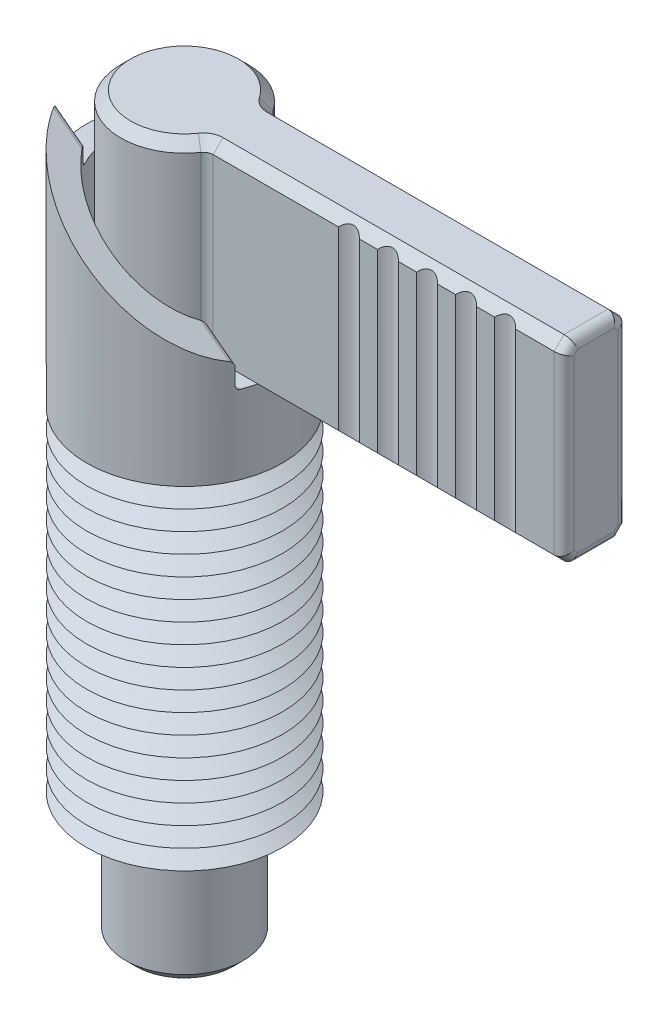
ISO-10303-21;
HEADER;
FILE_DESCRIPTION(('STEP AP214'),'2;1');
FILE_NAME('part.step','',(''),(''),'','','');
FILE_SCHEMA(('AUTOMOTIVE_DESIGN { 1 0 10303 214 1 1 1 1 }'));
ENDSEC;
DATA;
#1=APPLICATION_CONTEXT('core data for automotive mechanical design processes');
#2=APPLICATION_PROTOCOL_DEFINITION('international standard','automotive_design',2000,#1);
#3=PRODUCT_CONTEXT('',#1,'mechanical');
#4=PRODUCT('Part','Part','',(#3));
#5=PRODUCT_RELATED_PRODUCT_CATEGORY('part','',(#4));
#6=PRODUCT_DEFINITION_FORMATION('','',#4);
#7=PRODUCT_DEFINITION_CONTEXT('part definition',#1,'design');
#8=PRODUCT_DEFINITION('design','',#6,#7);
#9=PRODUCT_DEFINITION_SHAPE('','',#8);
#10=(LENGTH_UNIT() NAMED_UNIT(*) SI_UNIT(.MILLI.,.METRE.));
#11=(NAMED_UNIT(*) PLANE_ANGLE_UNIT() SI_UNIT($,.RADIAN.));
#12=(NAMED_UNIT(*) SI_UNIT($,.STERADIAN.) SOLID_ANGLE_UNIT());
#13=UNCERTAINTY_MEASURE_WITH_UNIT(LENGTH_MEASURE(1.E-05),#10,'distance_accuracy_value','');
#14=(GEOMETRIC_REPRESENTATION_CONTEXT(3) GLOBAL_UNCERTAINTY_ASSIGNED_CONTEXT((#13)) GLOBAL_UNIT_ASSIGNED_CONTEXT((#10,
#11,#12)) REPRESENTATION_CONTEXT('',''));
#15=CARTESIAN_POINT('',(0.,0.,0.));
#16=DIRECTION('',(0.,0.,1.));
#17=DIRECTION('',(1.,0.,0.));
#18=AXIS2_PLACEMENT_3D('',#15,#16,#17);
#19=CARTESIAN_POINT('',(2.81458256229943,3.0264538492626,1.625));
#20=DIRECTION('',(0.,0.,1.));
#21=DIRECTION('',(1.,0.,0.));
#22=AXIS2_PLACEMENT_3D('',#19,#20,#21);
#23=PLANE('',#22);
#24=DIRECTION('',(0.,1.,0.));
#25=VECTOR('',#24,1.);
#26=CARTESIAN_POINT('',(10.55198504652,-6.,1.625));
#27=LINE('',#26,#25);
#28=CARTESIAN_POINT('',(10.55198504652,22.0005,1.625));
#29=VERTEX_POINT('',#28);
#30=CARTESIAN_POINT('',(10.55198504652,30.9995,1.625));
#31=VERTEX_POINT('',#30);
#32=EDGE_CURVE('P0_E200',#29,#31,#27,.T.);
#33=ORIENTED_EDGE('',*,*,#32,.F.);
#34=DIRECTION('',(1.,0.,0.));
#35=VECTOR('',#34,1.);
#36=CARTESIAN_POINT('',(21.,22.0005,1.625));
#37=LINE('',#36,#35);
#38=CARTESIAN_POINT('',(11.47701495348,22.0005,1.625));
#39=VERTEX_POINT('',#38);
#40=EDGE_CURVE('P0_E209',#29,#39,#37,.T.);
#41=ORIENTED_EDGE('',*,*,#40,.T.);
#42=DIRECTION('',(0.,1.,0.));
#43=VECTOR('',#42,1.);
#44=CARTESIAN_POINT('',(11.47701495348,-6.,1.625));
#45=LINE('',#44,#43);
#46=CARTESIAN_POINT('',(11.47701495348,30.9995,1.625));
#47=VERTEX_POINT('',#46);
#48=EDGE_CURVE('P0_E210',#39,#47,#45,.T.);
#49=ORIENTED_EDGE('',*,*,#48,.T.);
#50=DIRECTION('',(-1.,0.,0.));
#51=VECTOR('',#50,1.);
#52=CARTESIAN_POINT('',(3.09006472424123,30.9995,1.625));
#53=LINE('',#52,#51);
#54=EDGE_CURVE('P0_E236',#47,#31,#53,.T.);
#55=ORIENTED_EDGE('',*,*,#54,.T.);
#56=EDGE_LOOP('',(#33,#41,#49,#55));
#57=FACE_BOUND('',#56,.T.);
#58=ADVANCED_FACE('P0_F16',(#57),#23,.T.);
#59=DIRECTION('',(0.,1.,0.));
#60=VECTOR('',#59,1.);
#61=CARTESIAN_POINT('',(12.54698504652,-6.,1.625));
#62=LINE('',#61,#60);
#63=CARTESIAN_POINT('',(12.54698504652,22.0005,1.625));
#64=VERTEX_POINT('',#63);
#65=CARTESIAN_POINT('',(12.54698504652,30.9995,1.625));
#66=VERTEX_POINT('',#65);
#67=EDGE_CURVE('P0_E299',#64,#66,#62,.T.);
#68=ORIENTED_EDGE('',*,*,#67,.F.);
#69=CARTESIAN_POINT('',(13.47201495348,22.0005,1.625));
#70=VERTEX_POINT('',#69);
#71=EDGE_CURVE('P0_E221',#64,#70,#37,.T.);
#72=ORIENTED_EDGE('',*,*,#71,.T.);
#73=DIRECTION('',(0.,1.,0.));
#74=VECTOR('',#73,1.);
#75=CARTESIAN_POINT('',(13.47201495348,-6.,1.625));
#76=LINE('',#75,#74);
#77=CARTESIAN_POINT('',(13.47201495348,30.9995,1.625));
#78=VERTEX_POINT('',#77);
#79=EDGE_CURVE('P0_E293',#70,#78,#76,.T.);
#80=ORIENTED_EDGE('',*,*,#79,.T.);
#81=EDGE_CURVE('P0_E239',#78,#66,#53,.T.);
#82=ORIENTED_EDGE('',*,*,#81,.T.);
#83=EDGE_LOOP('',(#68,#72,#80,#82));
#84=FACE_BOUND('',#83,.T.);
#85=ADVANCED_FACE('P0_F496',(#84),#23,.T.);
#86=DIRECTION('',(0.,1.,0.));
#87=VECTOR('',#86,1.);
#88=CARTESIAN_POINT('',(14.54198504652,-6.,1.625));
#89=LINE('',#88,#87);
#90=CARTESIAN_POINT('',(14.54198504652,22.0005,1.625));
#91=VERTEX_POINT('',#90);
#92=CARTESIAN_POINT('',(14.54198504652,30.9995,1.625));
#93=VERTEX_POINT('',#92);
#94=EDGE_CURVE('P0_E292',#91,#93,#89,.T.);
#95=ORIENTED_EDGE('',*,*,#94,.F.);
#96=CARTESIAN_POINT('',(15.46701495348,22.0005,1.625));
#97=VERTEX_POINT('',#96);
#98=EDGE_CURVE('P0_E228',#91,#97,#37,.T.);
#99=ORIENTED_EDGE('',*,*,#98,.T.);
#100=DIRECTION('',(0.,1.,0.));
#101=VECTOR('',#100,1.);
#102=CARTESIAN_POINT('',(15.46701495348,-6.,1.625));
#103=LINE('',#102,#101);
#104=CARTESIAN_POINT('',(15.46701495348,30.9995,1.625));
#105=VERTEX_POINT('',#104);
#106=EDGE_CURVE('P0_E286',#97,#105,#103,.T.);
#107=ORIENTED_EDGE('',*,*,#106,.T.);
#108=EDGE_CURVE('P0_E234',#105,#93,#53,.T.);
#109=ORIENTED_EDGE('',*,*,#108,.T.);
#110=EDGE_LOOP('',(#95,#99,#107,#109));
#111=FACE_BOUND('',#110,.T.);
#112=ADVANCED_FACE('P0_F324',(#111),#23,.T.);
#113=DIRECTION('',(0.,1.,0.));
#114=VECTOR('',#113,1.);
#115=CARTESIAN_POINT('',(16.53698504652,-6.,1.625));
#116=LINE('',#115,#114);
#117=CARTESIAN_POINT('',(16.53698504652,22.0005,1.625));
#118=VERTEX_POINT('',#117);
#119=CARTESIAN_POINT('',(16.53698504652,30.9995,1.625));
#120=VERTEX_POINT('',#119);
#121=EDGE_CURVE('P0_E285',#118,#120,#116,.T.);
#122=ORIENTED_EDGE('',*,*,#121,.F.);
#123=CARTESIAN_POINT('',(17.46201495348,22.0005,1.625));
#124=VERTEX_POINT('',#123);
#125=EDGE_CURVE('P0_E223',#118,#124,#37,.T.);
#126=ORIENTED_EDGE('',*,*,#125,.T.);
#127=DIRECTION('',(0.,1.,0.));
#128=VECTOR('',#127,1.);
#129=CARTESIAN_POINT('',(17.46201495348,-6.,1.625));
#130=LINE('',#129,#128);
#131=CARTESIAN_POINT('',(17.46201495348,30.9995,1.625));
#132=VERTEX_POINT('',#131);
#133=EDGE_CURVE('P0_E279',#124,#132,#130,.T.);
#134=ORIENTED_EDGE('',*,*,#133,.T.);
#135=EDGE_CURVE('P0_E229',#132,#120,#53,.T.);
#136=ORIENTED_EDGE('',*,*,#135,.T.);
#137=EDGE_LOOP('',(#122,#126,#134,#136));
#138=FACE_BOUND('',#137,.T.);
#139=ADVANCED_FACE('P0_F337',(#138),#23,.T.);
#140=CARTESIAN_POINT('',(18.53198504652,22.0005,1.625));
#141=VERTEX_POINT('',#140);
#142=CARTESIAN_POINT('',(20.4995,22.0005,1.625));
#143=VERTEX_POINT('',#142);
#144=EDGE_CURVE('P0_E218',#141,#143,#37,.T.);
#145=ORIENTED_EDGE('',*,*,#144,.T.);
#146=DIRECTION('',(0.,1.,0.));
#147=VECTOR('',#146,1.);
#148=CARTESIAN_POINT('',(20.4995,3.0264538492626,1.625));
#149=LINE('',#148,#147);
#150=CARTESIAN_POINT('',(20.4995,30.9995,1.625));
#151=VERTEX_POINT('',#150);
#152=EDGE_CURVE('P0_E11',#143,#151,#149,.T.);
#153=ORIENTED_EDGE('',*,*,#152,.T.);
#154=CARTESIAN_POINT('',(18.53198504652,30.9995,1.625));
#155=VERTEX_POINT('',#154);
#156=EDGE_CURVE('P0_E224',#151,#155,#53,.T.);
#157=ORIENTED_EDGE('',*,*,#156,.T.);
#158=DIRECTION('',(0.,1.,0.));
#159=VECTOR('',#158,1.);
#160=CARTESIAN_POINT('',(18.53198504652,-6.,1.625));
#161=LINE('',#160,#159);
#162=EDGE_CURVE('P0_E278',#141,#155,#161,.T.);
#163=ORIENTED_EDGE('',*,*,#162,.F.);
#164=EDGE_LOOP('',(#145,#153,#157,#163));
#165=FACE_BOUND('',#164,.T.);
#166=ADVANCED_FACE('P0_F506',(#165),#23,.T.);
#167=CARTESIAN_POINT('',(0.,-6.,0.));
#168=DIRECTION('',(0.,1.,0.));
#169=DIRECTION('',(0.,0.,1.));
#170=AXIS2_PLACEMENT_3D('',#167,#168,#169);
#171=PLANE('',#170);
#172=CARTESIAN_POINT('',(0.,-6.,0.));
#173=DIRECTION('',(0.,-1.,0.));
#174=DIRECTION('',(0.,0.,-1.));
#175=AXIS2_PLACEMENT_3D('',#172,#173,#174);
#176=CIRCLE('',#175,2.5);
#177=CARTESIAN_POINT('',(0.,-6.,-2.5));
#178=VERTEX_POINT('',#177);
#179=EDGE_CURVE('P0_E259',#178,#178,#176,.T.);
#180=ORIENTED_EDGE('',*,*,#179,.T.);
#181=EDGE_LOOP('',(#180));
#182=FACE_BOUND('',#181,.T.);
#183=ADVANCED_FACE('P0_F516',(#182),#171,.F.);
#184=CARTESIAN_POINT('',(0.,-5.5,0.));
#185=DIRECTION('',(0.,1.,0.));
#186=DIRECTION('',(0.,0.,1.));
#187=AXIS2_PLACEMENT_3D('',#184,#185,#186);
#188=CONICAL_SURFACE('',#187,3.,0.785398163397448);
#189=ORIENTED_EDGE('',*,*,#179,.F.);
#190=EDGE_LOOP('',(#189));
#191=FACE_BOUND('',#190,.T.);
#192=CARTESIAN_POINT('',(0.,-5.5,0.));
#193=DIRECTION('',(0.,-1.,0.));
#194=DIRECTION('',(0.,0.,-1.));
#195=AXIS2_PLACEMENT_3D('',#192,#193,#194);
#196=CIRCLE('',#195,3.);
#197=CARTESIAN_POINT('',(0.,-5.5,-3.));
#198=VERTEX_POINT('',#197);
#199=EDGE_CURVE('P0_E262',#198,#198,#196,.T.);
#200=ORIENTED_EDGE('',*,*,#199,.T.);
#201=EDGE_LOOP('',(#200));
#202=FACE_BOUND('',#201,.T.);
#203=ADVANCED_FACE('P0_F521',(#191,#202),#188,.T.);
#204=CARTESIAN_POINT('',(0.,-6.,0.));
#205=DIRECTION('',(0.,-1.,0.));
#206=DIRECTION('',(0.,0.,-1.));
#207=AXIS2_PLACEMENT_3D('',#204,#205,#206);
#208=CYLINDRICAL_SURFACE('',#207,3.);
#209=ORIENTED_EDGE('',*,*,#199,.F.);
#210=EDGE_LOOP('',(#209));
#211=FACE_BOUND('',#210,.T.);
#212=CARTESIAN_POINT('',(0.,4.75,0.));
#213=DIRECTION('',(0.,-1.,0.));
#214=DIRECTION('',(0.,0.,-1.));
#215=AXIS2_PLACEMENT_3D('',#212,#213,#214);
#216=CIRCLE('',#215,3.);
#217=CARTESIAN_POINT('',(0.,4.75,-3.));
#218=VERTEX_POINT('',#217);
#219=EDGE_CURVE('P0_E265',#218,#218,#216,.T.);
#220=ORIENTED_EDGE('',*,*,#219,.T.);
#221=EDGE_LOOP('',(#220));
#222=FACE_BOUND('',#221,.T.);
#223=ADVANCED_FACE('P0_F555',(#211,#222),#208,.T.);
#224=CARTESIAN_POINT('',(-3.,4.75,0.));
#225=DIRECTION('',(0.,-1.,0.));
#226=DIRECTION('',(0.,0.,-1.));
#227=AXIS2_PLACEMENT_3D('',#224,#225,#226);
#228=PLANE('',#227);
#229=ORIENTED_EDGE('',*,*,#219,.F.);
#230=EDGE_LOOP('',(#229));
#231=FACE_BOUND('',#230,.T.);
#232=CARTESIAN_POINT('',(0.,4.75,0.));
#233=DIRECTION('',(0.,-1.,0.));
#234=DIRECTION('',(0.,0.,-1.));
#235=AXIS2_PLACEMENT_3D('',#232,#233,#234);
#236=CIRCLE('',#235,2.25);
#237=CARTESIAN_POINT('',(0.,4.75,-2.25));
#238=VERTEX_POINT('',#237);
#239=EDGE_CURVE('P0_E268',#238,#238,#236,.T.);
#240=ORIENTED_EDGE('',*,*,#239,.T.);
#241=EDGE_LOOP('',(#240));
#242=FACE_BOUND('',#241,.T.);
#243=ADVANCED_FACE('P0_F563',(#231,#242),#228,.F.);
#244=CARTESIAN_POINT('',(0.,-6.,0.));
#245=DIRECTION('',(0.,-1.,0.));
#246=DIRECTION('',(0.,0.,-1.));
#247=AXIS2_PLACEMENT_3D('',#244,#245,#246);
#248=CYLINDRICAL_SURFACE('',#247,2.25);
#249=ORIENTED_EDGE('',*,*,#239,.F.);
#250=EDGE_LOOP('',(#249));
#251=FACE_BOUND('',#250,.T.);
#252=CARTESIAN_POINT('',(0.,21.5,0.));
#253=DIRECTION('',(0.,-1.,0.));
#254=DIRECTION('',(0.,0.,-1.));
#255=AXIS2_PLACEMENT_3D('',#252,#253,#254);
#256=CIRCLE('',#255,2.25);
#257=CARTESIAN_POINT('',(0.,21.5,-2.25));
#258=VERTEX_POINT('',#257);
#259=EDGE_CURVE('P0_E271',#258,#258,#256,.T.);
#260=ORIENTED_EDGE('',*,*,#259,.T.);
#261=EDGE_LOOP('',(#260));
#262=FACE_BOUND('',#261,.T.);
#263=ADVANCED_FACE('P0_F571',(#251,#262),#248,.T.);
#264=CARTESIAN_POINT('',(-2.25,21.5,0.));
#265=DIRECTION('',(0.,1.,0.));
#266=DIRECTION('',(0.,0.,1.));
#267=AXIS2_PLACEMENT_3D('',#264,#265,#266);
#268=PLANE('',#267);
#269=ORIENTED_EDGE('',*,*,#259,.F.);
#270=EDGE_LOOP('',(#269));
#271=FACE_BOUND('',#270,.T.);
#272=DIRECTION('',(1.,0.,0.));
#273=VECTOR('',#272,1.);
#274=CARTESIAN_POINT('',(21.,21.5,-1.1245));
#275=LINE('',#274,#273);
#276=CARTESIAN_POINT('',(3.09006472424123,21.5,-1.1245));
#277=VERTEX_POINT('',#276);
#278=CARTESIAN_POINT('',(20.4995,21.5,-1.1245));
#279=VERTEX_POINT('',#278);
#280=EDGE_CURVE('P0_E247',#277,#279,#275,.T.);
#281=ORIENTED_EDGE('',*,*,#280,.T.);
#282=DIRECTION('',(0.,0.,1.));
#283=VECTOR('',#282,1.);
#284=CARTESIAN_POINT('',(20.4995,21.5,1.12450000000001));
#285=LINE('',#284,#283);
#286=CARTESIAN_POINT('',(20.4995,21.5,1.1245));
#287=VERTEX_POINT('',#286);
#288=EDGE_CURVE('P0_E40',#279,#287,#285,.T.);
#289=ORIENTED_EDGE('',*,*,#288,.T.);
#290=DIRECTION('',(-1.,0.,0.));
#291=VECTOR('',#290,1.);
#292=CARTESIAN_POINT('',(3.09006472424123,21.5,1.1245));
#293=LINE('',#292,#291);
#294=CARTESIAN_POINT('',(3.09006472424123,21.5,1.1245));
#295=VERTEX_POINT('',#294);
#296=EDGE_CURVE('P0_E237',#287,#295,#293,.T.);
#297=ORIENTED_EDGE('',*,*,#296,.T.);
#298=CARTESIAN_POINT('',(3.09006472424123,21.5,2.1255));
#299=DIRECTION('',(0.,1.,0.));
#300=DIRECTION('',(0.,0.,1.));
#301=AXIS2_PLACEMENT_3D('',#298,#299,#300);
#302=CIRCLE('',#301,1.001);
#303=CARTESIAN_POINT('',(2.26533341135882,21.5,1.55820883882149));
#304=VERTEX_POINT('',#303);
#305=EDGE_CURVE('P0_E240',#295,#304,#302,.T.);
#306=ORIENTED_EDGE('',*,*,#305,.T.);
#307=CARTESIAN_POINT('',(0.,21.5,0.));
#308=DIRECTION('',(0.,1.,0.));
#309=DIRECTION('',(0.,0.,1.));
#310=AXIS2_PLACEMENT_3D('',#307,#308,#309);
#311=CIRCLE('',#310,2.7495);
#312=CARTESIAN_POINT('',(2.26533341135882,21.5,-1.55820883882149));
#313=VERTEX_POINT('',#312);
#314=EDGE_CURVE('P0_E241',#304,#313,#311,.F.);
#315=ORIENTED_EDGE('',*,*,#314,.T.);
#316=CARTESIAN_POINT('',(3.09006472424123,21.5,-2.1255));
#317=DIRECTION('',(0.,1.,0.));
#318=DIRECTION('',(0.,0.,1.));
#319=AXIS2_PLACEMENT_3D('',#316,#317,#318);
#320=CIRCLE('',#319,1.001);
#321=EDGE_CURVE('P0_E245',#313,#277,#320,.T.);
#322=ORIENTED_EDGE('',*,*,#321,.T.);
#323=EDGE_LOOP('',(#281,#289,#297,#306,#315,#322));
#324=FACE_BOUND('',#323,.T.);
#325=ADVANCED_FACE('P0_F422',(#271,#324),#268,.F.);
#326=CARTESIAN_POINT('',(0.,-6.,0.));
#327=DIRECTION('',(0.,-1.,0.));
#328=DIRECTION('',(0.,0.,-1.));
#329=AXIS2_PLACEMENT_3D('',#326,#327,#328);
#330=CYLINDRICAL_SURFACE('',#329,3.25);
#331=DIRECTION('',(0.,-1.,0.));
#332=VECTOR('',#331,1.);
#333=CARTESIAN_POINT('',(2.67769906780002,-6.,-1.84185441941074));
#334=LINE('',#333,#332);
#335=CARTESIAN_POINT('',(2.67769906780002,30.9995,-1.84185441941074));
#336=VERTEX_POINT('',#335);
#337=CARTESIAN_POINT('',(2.67769906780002,22.0005,-1.84185441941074));
#338=VERTEX_POINT('',#337);
#339=EDGE_CURVE('P0_E250',#336,#338,#334,.T.);
#340=ORIENTED_EDGE('',*,*,#339,.T.);
#341=CARTESIAN_POINT('',(0.,22.0005,0.));
#342=DIRECTION('',(0.,1.,0.));
#343=DIRECTION('',(0.,0.,1.));
#344=AXIS2_PLACEMENT_3D('',#341,#342,#343);
#345=CIRCLE('',#344,3.25);
#346=CARTESIAN_POINT('',(2.67769906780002,22.0005,1.84185441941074));
#347=VERTEX_POINT('',#346);
#348=EDGE_CURVE('P0_E436',#338,#347,#345,.T.);
#349=ORIENTED_EDGE('',*,*,#348,.T.);
#350=DIRECTION('',(0.,-1.,0.));
#351=VECTOR('',#350,1.);
#352=CARTESIAN_POINT('',(2.67769906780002,-6.,1.84185441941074));
#353=LINE('',#352,#351);
#354=CARTESIAN_POINT('',(2.67769906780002,30.9995,1.84185441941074));
#355=VERTEX_POINT('',#354);
#356=EDGE_CURVE('P0_E253',#347,#355,#353,.F.);
#357=ORIENTED_EDGE('',*,*,#356,.T.);
#358=CARTESIAN_POINT('',(0.,30.9995,0.));
#359=DIRECTION('',(0.,-1.,0.));
#360=DIRECTION('',(0.,0.,-1.));
#361=AXIS2_PLACEMENT_3D('',#358,#359,#360);
#362=CIRCLE('',#361,3.25);
#363=EDGE_CURVE('P0_E476',#355,#336,#362,.T.);
#364=ORIENTED_EDGE('',*,*,#363,.T.);
#365=EDGE_LOOP('',(#340,#349,#357,#364));
#366=FACE_BOUND('',#365,.T.);
#367=ADVANCED_FACE('P0_F586',(#366),#330,.T.);
#368=CARTESIAN_POINT('',(-3.25,31.5,0.));
#369=DIRECTION('',(0.,-1.,0.));
#370=DIRECTION('',(0.,0.,-1.));
#371=AXIS2_PLACEMENT_3D('',#368,#369,#370);
#372=PLANE('',#371);
#373=DIRECTION('',(1.,0.,0.));
#374=VECTOR('',#373,1.);
#375=CARTESIAN_POINT('',(21.,31.5,1.1245));
#376=LINE('',#375,#374);
#377=CARTESIAN_POINT('',(3.09006472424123,31.5,1.1245));
#378=VERTEX_POINT('',#377);
#379=CARTESIAN_POINT('',(20.4995,31.5,1.1245));
#380=VERTEX_POINT('',#379);
#381=EDGE_CURVE('P0_E343',#378,#380,#376,.T.);
#382=ORIENTED_EDGE('',*,*,#381,.T.);
#383=DIRECTION('',(0.,0.,-1.));
#384=VECTOR('',#383,1.);
#385=CARTESIAN_POINT('',(20.4995,31.5,-1.12449999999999));
#386=LINE('',#385,#384);
#387=CARTESIAN_POINT('',(20.4995,31.5,-1.1245));
#388=VERTEX_POINT('',#387);
#389=EDGE_CURVE('P0_E375',#380,#388,#386,.T.);
#390=ORIENTED_EDGE('',*,*,#389,.T.);
#391=DIRECTION('',(-1.,0.,0.));
#392=VECTOR('',#391,1.);
#393=CARTESIAN_POINT('',(3.09006472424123,31.5,-1.1245));
#394=LINE('',#393,#392);
#395=CARTESIAN_POINT('',(3.09006472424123,31.5,-1.1245));
#396=VERTEX_POINT('',#395);
#397=EDGE_CURVE('P0_E465',#388,#396,#394,.T.);
#398=ORIENTED_EDGE('',*,*,#397,.T.);
#399=CARTESIAN_POINT('',(3.09006472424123,31.5,-2.1255));
#400=DIRECTION('',(0.,-1.,0.));
#401=DIRECTION('',(0.,0.,-1.));
#402=AXIS2_PLACEMENT_3D('',#399,#400,#401);
#403=CIRCLE('',#402,1.001);
#404=CARTESIAN_POINT('',(2.26533341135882,31.5,-1.55820883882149));
#405=VERTEX_POINT('',#404);
#406=EDGE_CURVE('P0_E463',#396,#405,#403,.T.);
#407=ORIENTED_EDGE('',*,*,#406,.T.);
#408=CARTESIAN_POINT('',(0.,31.5,0.));
#409=DIRECTION('',(0.,-1.,0.));
#410=DIRECTION('',(0.,0.,-1.));
#411=AXIS2_PLACEMENT_3D('',#408,#409,#410);
#412=CIRCLE('',#411,2.7495);
#413=CARTESIAN_POINT('',(2.26533341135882,31.5,1.55820883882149));
#414=VERTEX_POINT('',#413);
#415=EDGE_CURVE('P0_E461',#405,#414,#412,.F.);
#416=ORIENTED_EDGE('',*,*,#415,.T.);
#417=CARTESIAN_POINT('',(3.09006472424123,31.5,2.1255));
#418=DIRECTION('',(0.,-1.,0.));
#419=DIRECTION('',(0.,0.,-1.));
#420=AXIS2_PLACEMENT_3D('',#417,#418,#419);
#421=CIRCLE('',#420,1.001);
#422=EDGE_CURVE('P0_E348',#414,#378,#421,.T.);
#423=ORIENTED_EDGE('',*,*,#422,.T.);
#424=EDGE_LOOP('',(#382,#390,#398,#407,#416,#423));
#425=FACE_BOUND('',#424,.T.);
#426=ADVANCED_FACE('P0_F594',(#425),#372,.F.);
#427=CARTESIAN_POINT('',(2.81458256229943,3.0264538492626,-1.625));
#428=DIRECTION('',(0.,0.,-1.));
#429=DIRECTION('',(-1.,0.,0.));
#430=AXIS2_PLACEMENT_3D('',#427,#428,#429);
#431=PLANE('',#430);
#432=DIRECTION('',(1.,0.,0.));
#433=VECTOR('',#432,1.);
#434=CARTESIAN_POINT('',(21.,30.9995,-1.625));
#435=LINE('',#434,#433);
#436=CARTESIAN_POINT('',(3.09006472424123,30.9995,-1.625));
#437=VERTEX_POINT('',#436);
#438=CARTESIAN_POINT('',(20.4995,30.9995,-1.625));
#439=VERTEX_POINT('',#438);
#440=EDGE_CURVE('P0_E468',#437,#439,#435,.T.);
#441=ORIENTED_EDGE('',*,*,#440,.T.);
#442=DIRECTION('',(0.,1.,0.));
#443=VECTOR('',#442,1.);
#444=CARTESIAN_POINT('',(20.4995,3.0264538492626,-1.625));
#445=LINE('',#444,#443);
#446=CARTESIAN_POINT('',(20.4995,22.0005,-1.625));
#447=VERTEX_POINT('',#446);
#448=EDGE_CURVE('P0_E379',#439,#447,#445,.F.);
#449=ORIENTED_EDGE('',*,*,#448,.T.);
#450=DIRECTION('',(-1.,0.,0.));
#451=VECTOR('',#450,1.);
#452=CARTESIAN_POINT('',(3.09006472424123,22.0005,-1.625));
#453=LINE('',#452,#451);
#454=CARTESIAN_POINT('',(3.09006472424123,22.0005,-1.625));
#455=VERTEX_POINT('',#454);
#456=EDGE_CURVE('P0_E421',#447,#455,#453,.T.);
#457=ORIENTED_EDGE('',*,*,#456,.T.);
#458=DIRECTION('',(0.,-1.,0.));
#459=VECTOR('',#458,1.);
#460=CARTESIAN_POINT('',(3.09006472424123,3.0264538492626,-1.625));
#461=LINE('',#460,#459);
#462=EDGE_CURVE('P0_E256',#455,#437,#461,.F.);
#463=ORIENTED_EDGE('',*,*,#462,.T.);
#464=EDGE_LOOP('',(#441,#449,#457,#463));
#465=FACE_BOUND('',#464,.T.);
#466=ADVANCED_FACE('P0_F513',(#465),#431,.T.);
#467=CARTESIAN_POINT('',(21.,3.0264538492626,1.625));
#468=DIRECTION('',(1.,0.,0.));
#469=DIRECTION('',(0.,0.,-1.));
#470=AXIS2_PLACEMENT_3D('',#467,#468,#469);
#471=PLANE('',#470);
#472=DIRECTION('',(0.,0.,-1.));
#473=VECTOR('',#472,1.);
#474=CARTESIAN_POINT('',(21.,30.9995,1.12449999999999));
#475=LINE('',#474,#473);
#476=CARTESIAN_POINT('',(21.,30.9995,-0.917186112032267));
#477=VERTEX_POINT('',#476);
#478=CARTESIAN_POINT('',(21.,30.9995,0.917186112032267));
#479=VERTEX_POINT('',#478);
#480=EDGE_CURVE('P0_E367',#477,#479,#475,.F.);
#481=ORIENTED_EDGE('',*,*,#480,.T.);
#482=DIRECTION('',(0.,-0.707106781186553,0.707106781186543));
#483=VECTOR('',#482,1.);
#484=CARTESIAN_POINT('',(21.,16.6590699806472,15.2576161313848));
#485=LINE('',#484,#483);
#486=CARTESIAN_POINT('',(21.,30.7921861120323,1.1245));
#487=VERTEX_POINT('',#486);
#488=EDGE_CURVE('P0_E369',#479,#487,#485,.T.);
#489=ORIENTED_EDGE('',*,*,#488,.T.);
#490=DIRECTION('',(0.,1.,0.));
#491=VECTOR('',#490,1.);
#492=CARTESIAN_POINT('',(21.,3.0264538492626,1.1245));
#493=LINE('',#492,#491);
#494=CARTESIAN_POINT('',(21.,22.2078138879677,1.1245));
#495=VERTEX_POINT('',#494);
#496=EDGE_CURVE('P0_E309',#487,#495,#493,.F.);
#497=ORIENTED_EDGE('',*,*,#496,.T.);
#498=DIRECTION('',(0.,-0.707106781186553,-0.707106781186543));
#499=VECTOR('',#498,1.);
#500=CARTESIAN_POINT('',(21.,12.867383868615,-8.21593001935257));
#501=LINE('',#500,#499);
#502=CARTESIAN_POINT('',(21.,22.0005,0.917186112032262));
#503=VERTEX_POINT('',#502);
#504=EDGE_CURVE('P0_E357',#495,#503,#501,.T.);
#505=ORIENTED_EDGE('',*,*,#504,.T.);
#506=DIRECTION('',(0.,0.,1.));
#507=VECTOR('',#506,1.);
#508=CARTESIAN_POINT('',(21.,22.0005,-1.1245));
#509=LINE('',#508,#507);
#510=CARTESIAN_POINT('',(21.,22.0005,-0.91718611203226));
#511=VERTEX_POINT('',#510);
#512=EDGE_CURVE('P0_E359',#503,#511,#509,.F.);
#513=ORIENTED_EDGE('',*,*,#512,.T.);
#514=DIRECTION('',(0.,0.707106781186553,-0.707106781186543));
#515=VECTOR('',#514,1.);
#516=CARTESIAN_POINT('',(21.,11.242383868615,9.84093001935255));
#517=LINE('',#516,#515);
#518=CARTESIAN_POINT('',(21.,22.2078138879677,-1.1245));
#519=VERTEX_POINT('',#518);
#520=EDGE_CURVE('P0_E361',#511,#519,#517,.T.);
#521=ORIENTED_EDGE('',*,*,#520,.T.);
#522=DIRECTION('',(0.,1.,0.));
#523=VECTOR('',#522,1.);
#524=CARTESIAN_POINT('',(21.,3.0264538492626,-1.1245));
#525=LINE('',#524,#523);
#526=CARTESIAN_POINT('',(21.,30.7921861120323,-1.1245));
#527=VERTEX_POINT('',#526);
#528=EDGE_CURVE('P0_E363',#519,#527,#525,.T.);
#529=ORIENTED_EDGE('',*,*,#528,.T.);
#530=DIRECTION('',(0.,0.707106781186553,0.707106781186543));
#531=VECTOR('',#530,1.);
#532=CARTESIAN_POINT('',(21.,18.2840699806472,-13.6326161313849));
#533=LINE('',#532,#531);
#534=EDGE_CURVE('P0_E365',#527,#477,#533,.T.);
#535=ORIENTED_EDGE('',*,*,#534,.T.);
#536=EDGE_LOOP('',(#481,#489,#497,#505,#513,#521,#529,#535));
#537=FACE_BOUND('',#536,.T.);
#538=ADVANCED_FACE('P0_F505',(#537),#471,.T.);
#539=DIRECTION('',(0.,1.,0.));
#540=VECTOR('',#539,1.);
#541=CARTESIAN_POINT('',(9.48201495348,-6.,1.625));
#542=LINE('',#541,#540);
#543=CARTESIAN_POINT('',(9.48201495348,22.0005,1.625));
#544=VERTEX_POINT('',#543);
#545=CARTESIAN_POINT('',(9.48201495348,30.9995,1.625));
#546=VERTEX_POINT('',#545);
#547=EDGE_CURVE('P0_E190',#544,#546,#542,.T.);
#548=ORIENTED_EDGE('',*,*,#547,.T.);
#549=CARTESIAN_POINT('',(3.09006472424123,30.9995,1.625));
#550=VERTEX_POINT('',#549);
#551=EDGE_CURVE('P0_E230',#546,#550,#53,.T.);
#552=ORIENTED_EDGE('',*,*,#551,.T.);
#553=DIRECTION('',(0.,-1.,0.));
#554=VECTOR('',#553,1.);
#555=CARTESIAN_POINT('',(3.09006472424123,3.0264538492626,1.625));
#556=LINE('',#555,#554);
#557=CARTESIAN_POINT('',(3.09006472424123,22.0005,1.625));
#558=VERTEX_POINT('',#557);
#559=EDGE_CURVE('P0_E215',#550,#558,#556,.T.);
#560=ORIENTED_EDGE('',*,*,#559,.T.);
#561=EDGE_CURVE('P0_E206',#558,#544,#37,.T.);
#562=ORIENTED_EDGE('',*,*,#561,.T.);
#563=EDGE_LOOP('',(#548,#552,#560,#562));
#564=FACE_BOUND('',#563,.T.);
#565=ADVANCED_FACE('P0_F213',(#564),#23,.T.);
#566=CARTESIAN_POINT('',(3.09006472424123,-6.,-2.1255));
#567=DIRECTION('',(0.,-1.,0.));
#568=DIRECTION('',(0.,0.,-1.));
#569=AXIS2_PLACEMENT_3D('',#566,#567,#568);
#570=CYLINDRICAL_SURFACE('',#569,0.5005);
#571=ORIENTED_EDGE('',*,*,#462,.F.);
#572=CARTESIAN_POINT('',(3.09006472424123,22.0005,-2.1255));
#573=DIRECTION('',(0.,1.,0.));
#574=DIRECTION('',(0.,0.,1.));
#575=AXIS2_PLACEMENT_3D('',#572,#573,#574);
#576=CIRCLE('',#575,0.5005);
#577=EDGE_CURVE('P0_E471',#455,#338,#576,.F.);
#578=ORIENTED_EDGE('',*,*,#577,.T.);
#579=ORIENTED_EDGE('',*,*,#339,.F.);
#580=CARTESIAN_POINT('',(3.09006472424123,30.9995,-2.1255));
#581=DIRECTION('',(0.,-1.,0.));
#582=DIRECTION('',(0.,0.,-1.));
#583=AXIS2_PLACEMENT_3D('',#580,#581,#582);
#584=CIRCLE('',#583,0.5005);
#585=EDGE_CURVE('P0_E473',#336,#437,#584,.F.);
#586=ORIENTED_EDGE('',*,*,#585,.T.);
#587=EDGE_LOOP('',(#571,#578,#579,#586));
#588=FACE_BOUND('',#587,.T.);
#589=ADVANCED_FACE('P0_F504',(#588),#570,.F.);
#590=CARTESIAN_POINT('',(3.09006472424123,-6.,2.1255));
#591=DIRECTION('',(0.,-1.,0.));
#592=DIRECTION('',(0.,0.,-1.));
#593=AXIS2_PLACEMENT_3D('',#590,#591,#592);
#594=CYLINDRICAL_SURFACE('',#593,0.5005);
#595=ORIENTED_EDGE('',*,*,#356,.F.);
#596=CARTESIAN_POINT('',(3.09006472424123,22.0005,2.1255));
#597=DIRECTION('',(0.,1.,0.));
#598=DIRECTION('',(0.,0.,1.));
#599=AXIS2_PLACEMENT_3D('',#596,#597,#598);
#600=CIRCLE('',#599,0.5005);
#601=EDGE_CURVE('P0_E219',#347,#558,#600,.F.);
#602=ORIENTED_EDGE('',*,*,#601,.T.);
#603=ORIENTED_EDGE('',*,*,#559,.F.);
#604=CARTESIAN_POINT('',(3.09006472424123,30.9995,2.1255));
#605=DIRECTION('',(0.,-1.,0.));
#606=DIRECTION('',(0.,0.,-1.));
#607=AXIS2_PLACEMENT_3D('',#604,#605,#606);
#608=CIRCLE('',#607,0.5005);
#609=EDGE_CURVE('P0_E216',#550,#355,#608,.F.);
#610=ORIENTED_EDGE('',*,*,#609,.T.);
#611=EDGE_LOOP('',(#595,#602,#603,#610));
#612=FACE_BOUND('',#611,.T.);
#613=ADVANCED_FACE('P0_F481',(#612),#594,.F.);
#614=CARTESIAN_POINT('',(-2.25,21.5,-1.1245));
#615=DIRECTION('',(0.,-0.707106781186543,-0.707106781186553));
#616=DIRECTION('',(0.,0.707106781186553,-0.707106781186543));
#617=AXIS2_PLACEMENT_3D('',#614,#615,#616);
#618=PLANE('',#617);
#619=ORIENTED_EDGE('',*,*,#456,.F.);
#620=DIRECTION('',(0.,0.707106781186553,-0.707106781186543));
#621=VECTOR('',#620,1.);
#622=CARTESIAN_POINT('',(20.4995,21.5,-1.1245));
#623=LINE('',#622,#621);
#624=EDGE_CURVE('P0_E381',#447,#279,#623,.F.);
#625=ORIENTED_EDGE('',*,*,#624,.T.);
#626=ORIENTED_EDGE('',*,*,#280,.F.);
#627=DIRECTION('',(0.,-0.707106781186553,0.707106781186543));
#628=VECTOR('',#627,1.);
#629=CARTESIAN_POINT('',(3.09006472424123,22.0005,-1.625));
#630=LINE('',#629,#628);
#631=EDGE_CURVE('P0_E274',#455,#277,#630,.T.);
#632=ORIENTED_EDGE('',*,*,#631,.F.);
#633=EDGE_LOOP('',(#619,#625,#626,#632));
#634=FACE_BOUND('',#633,.T.);
#635=ADVANCED_FACE('P0_F418',(#634),#618,.T.);
#636=CARTESIAN_POINT('',(3.09006472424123,21.5,-2.1255));
#637=DIRECTION('',(0.,-1.,0.));
#638=DIRECTION('',(0.,0.,-1.));
#639=AXIS2_PLACEMENT_3D('',#636,#637,#638);
#640=CONICAL_SURFACE('',#639,1.001,0.785398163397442);
#641=ORIENTED_EDGE('',*,*,#631,.T.);
#642=ORIENTED_EDGE('',*,*,#321,.F.);
#643=DIRECTION('',(-0.582590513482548,-0.707106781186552,0.400734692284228));
#644=VECTOR('',#643,1.);
#645=CARTESIAN_POINT('',(2.67769906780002,22.0005,-1.84185441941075));
#646=LINE('',#645,#644);
#647=EDGE_CURVE('P0_E430',#338,#313,#646,.T.);
#648=ORIENTED_EDGE('',*,*,#647,.F.);
#649=ORIENTED_EDGE('',*,*,#577,.F.);
#650=EDGE_LOOP('',(#641,#642,#648,#649));
#651=FACE_BOUND('',#650,.T.);
#652=ADVANCED_FACE('P0_F428',(#651),#640,.F.);
#653=CARTESIAN_POINT('',(0.,21.5,0.));
#654=DIRECTION('',(0.,1.,0.));
#655=DIRECTION('',(0.,0.,1.));
#656=AXIS2_PLACEMENT_3D('',#653,#654,#655);
#657=CONICAL_SURFACE('',#656,2.7495,0.785398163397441);
#658=ORIENTED_EDGE('',*,*,#647,.T.);
#659=ORIENTED_EDGE('',*,*,#314,.F.);
#660=DIRECTION('',(-0.582590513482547,-0.707106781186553,-0.400734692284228));
#661=VECTOR('',#660,1.);
#662=CARTESIAN_POINT('',(2.67769906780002,22.0005,1.84185441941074));
#663=LINE('',#662,#661);
#664=EDGE_CURVE('P0_E437',#347,#304,#663,.T.);
#665=ORIENTED_EDGE('',*,*,#664,.F.);
#666=ORIENTED_EDGE('',*,*,#348,.F.);
#667=EDGE_LOOP('',(#658,#659,#665,#666));
#668=FACE_BOUND('',#667,.T.);
#669=ADVANCED_FACE('P0_F433',(#668),#657,.T.);
#670=CARTESIAN_POINT('',(3.09006472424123,21.5,2.1255));
#671=DIRECTION('',(0.,-1.,0.));
#672=DIRECTION('',(0.,0.,-1.));
#673=AXIS2_PLACEMENT_3D('',#670,#671,#672);
#674=CONICAL_SURFACE('',#673,1.001,0.785398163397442);
#675=ORIENTED_EDGE('',*,*,#664,.T.);
#676=ORIENTED_EDGE('',*,*,#305,.F.);
#677=DIRECTION('',(0.,-0.707106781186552,-0.707106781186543));
#678=VECTOR('',#677,1.);
#679=CARTESIAN_POINT('',(3.09006472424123,22.0005,1.625));
#680=LINE('',#679,#678);
#681=EDGE_CURVE('P0_E440',#558,#295,#680,.T.);
#682=ORIENTED_EDGE('',*,*,#681,.F.);
#683=ORIENTED_EDGE('',*,*,#601,.F.);
#684=EDGE_LOOP('',(#675,#676,#682,#683));
#685=FACE_BOUND('',#684,.T.);
#686=ADVANCED_FACE('P0_F484',(#685),#674,.F.);
#687=CARTESIAN_POINT('',(-2.25,21.5,1.1245));
#688=DIRECTION('',(0.,-0.707106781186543,0.707106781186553));
#689=DIRECTION('',(0.,-0.707106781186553,-0.707106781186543));
#690=AXIS2_PLACEMENT_3D('',#687,#688,#689);
#691=PLANE('',#690);
#692=ORIENTED_EDGE('',*,*,#296,.F.);
#693=DIRECTION('',(0.,-0.707106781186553,-0.707106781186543));
#694=VECTOR('',#693,1.);
#695=CARTESIAN_POINT('',(20.4995,21.5,1.1245));
#696=LINE('',#695,#694);
#697=EDGE_CURVE('P0_E25',#287,#143,#696,.F.);
#698=ORIENTED_EDGE('',*,*,#697,.T.);
#699=ORIENTED_EDGE('',*,*,#144,.F.);
#700=CARTESIAN_POINT('',(17.997,22.5045,2.129));
#701=DIRECTION('',(0.,-0.707106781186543,0.707106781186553));
#702=DIRECTION('',(0.,0.707106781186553,0.707106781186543));
#703=AXIS2_PLACEMENT_3D('',#700,#701,#702);
#704=ELLIPSE('',#703,1.03944696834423,0.735000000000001);
#705=EDGE_CURVE('P0_E275',#124,#141,#704,.T.);
#706=ORIENTED_EDGE('',*,*,#705,.F.);
#707=ORIENTED_EDGE('',*,*,#125,.F.);
#708=CARTESIAN_POINT('',(16.002,22.5045,2.129));
#709=DIRECTION('',(0.,-0.707106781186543,0.707106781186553));
#710=DIRECTION('',(0.,0.707106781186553,0.707106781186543));
#711=AXIS2_PLACEMENT_3D('',#708,#709,#710);
#712=ELLIPSE('',#711,1.03944696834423,0.735000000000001);
#713=EDGE_CURVE('P0_E282',#97,#118,#712,.T.);
#714=ORIENTED_EDGE('',*,*,#713,.F.);
#715=ORIENTED_EDGE('',*,*,#98,.F.);
#716=CARTESIAN_POINT('',(14.007,22.5045,2.129));
#717=DIRECTION('',(0.,-0.707106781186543,0.707106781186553));
#718=DIRECTION('',(0.,0.707106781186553,0.707106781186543));
#719=AXIS2_PLACEMENT_3D('',#716,#717,#718);
#720=ELLIPSE('',#719,1.03944696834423,0.735000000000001);
#721=EDGE_CURVE('P0_E289',#70,#91,#720,.T.);
#722=ORIENTED_EDGE('',*,*,#721,.F.);
#723=ORIENTED_EDGE('',*,*,#71,.F.);
#724=CARTESIAN_POINT('',(12.012,22.5045,2.129));
#725=DIRECTION('',(0.,-0.707106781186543,0.707106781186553));
#726=DIRECTION('',(0.,0.707106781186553,0.707106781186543));
#727=AXIS2_PLACEMENT_3D('',#724,#725,#726);
#728=ELLIPSE('',#727,1.03944696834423,0.735000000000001);
#729=EDGE_CURVE('P0_E296',#39,#64,#728,.T.);
#730=ORIENTED_EDGE('',*,*,#729,.F.);
#731=ORIENTED_EDGE('',*,*,#40,.F.);
#732=CARTESIAN_POINT('',(10.017,22.5045,2.129));
#733=DIRECTION('',(0.,-0.707106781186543,0.707106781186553));
#734=DIRECTION('',(0.,0.707106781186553,0.707106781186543));
#735=AXIS2_PLACEMENT_3D('',#732,#733,#734);
#736=ELLIPSE('',#735,1.03944696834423,0.735000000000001);
#737=EDGE_CURVE('P0_E193',#544,#29,#736,.T.);
#738=ORIENTED_EDGE('',*,*,#737,.F.);
#739=ORIENTED_EDGE('',*,*,#561,.F.);
#740=ORIENTED_EDGE('',*,*,#681,.T.);
#741=EDGE_LOOP('',(#692,#698,#699,#706,#707,#714,#715,#722,#723,#730,#731,#738,#739,#740));
#742=FACE_BOUND('',#741,.T.);
#743=ADVANCED_FACE('P0_F204',(#742),#691,.T.);
#744=CARTESIAN_POINT('',(-3.25,31.5,-1.1245));
#745=DIRECTION('',(0.,0.707106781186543,-0.707106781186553));
#746=DIRECTION('',(0.,0.707106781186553,0.707106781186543));
#747=AXIS2_PLACEMENT_3D('',#744,#745,#746);
#748=PLANE('',#747);
#749=ORIENTED_EDGE('',*,*,#397,.F.);
#750=DIRECTION('',(0.,0.707106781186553,0.707106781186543));
#751=VECTOR('',#750,1.);
#752=CARTESIAN_POINT('',(20.4995,31.5,-1.1245));
#753=LINE('',#752,#751);
#754=EDGE_CURVE('P0_E377',#388,#439,#753,.F.);
#755=ORIENTED_EDGE('',*,*,#754,.T.);
#756=ORIENTED_EDGE('',*,*,#440,.F.);
#757=DIRECTION('',(0.,-0.707106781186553,-0.707106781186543));
#758=VECTOR('',#757,1.);
#759=CARTESIAN_POINT('',(3.09006472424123,31.5,-1.1245));
#760=LINE('',#759,#758);
#761=EDGE_CURVE('P0_E351',#396,#437,#760,.T.);
#762=ORIENTED_EDGE('',*,*,#761,.F.);
#763=EDGE_LOOP('',(#749,#755,#756,#762));
#764=FACE_BOUND('',#763,.T.);
#765=ADVANCED_FACE('P0_F492',(#764),#748,.T.);
#766=CARTESIAN_POINT('',(3.09006472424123,31.5,-2.1255));
#767=DIRECTION('',(0.,1.,0.));
#768=DIRECTION('',(0.,0.,1.));
#769=AXIS2_PLACEMENT_3D('',#766,#767,#768);
#770=CONICAL_SURFACE('',#769,1.001,0.785398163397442);
#771=ORIENTED_EDGE('',*,*,#761,.T.);
#772=ORIENTED_EDGE('',*,*,#585,.F.);
#773=DIRECTION('',(0.582590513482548,-0.707106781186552,-0.400734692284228));
#774=VECTOR('',#773,1.);
#775=CARTESIAN_POINT('',(2.26533341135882,31.5,-1.55820883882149));
#776=LINE('',#775,#774);
#777=EDGE_CURVE('P0_E447',#405,#336,#776,.T.);
#778=ORIENTED_EDGE('',*,*,#777,.F.);
#779=ORIENTED_EDGE('',*,*,#406,.F.);
#780=EDGE_LOOP('',(#771,#772,#778,#779));
#781=FACE_BOUND('',#780,.T.);
#782=ADVANCED_FACE('P0_F653',(#781),#770,.F.);
#783=CARTESIAN_POINT('',(0.,30.9995,0.));
#784=DIRECTION('',(0.,-1.,0.));
#785=DIRECTION('',(0.,0.,-1.));
#786=AXIS2_PLACEMENT_3D('',#783,#784,#785);
#787=CONICAL_SURFACE('',#786,3.25,0.785398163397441);
#788=ORIENTED_EDGE('',*,*,#777,.T.);
#789=ORIENTED_EDGE('',*,*,#363,.F.);
#790=DIRECTION('',(0.582590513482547,-0.707106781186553,0.400734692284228));
#791=VECTOR('',#790,1.);
#792=CARTESIAN_POINT('',(2.26533341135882,31.5,1.55820883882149));
#793=LINE('',#792,#791);
#794=EDGE_CURVE('P0_E445',#414,#355,#793,.T.);
#795=ORIENTED_EDGE('',*,*,#794,.F.);
#796=ORIENTED_EDGE('',*,*,#415,.F.);
#797=EDGE_LOOP('',(#788,#789,#795,#796));
#798=FACE_BOUND('',#797,.T.);
#799=ADVANCED_FACE('P0_F661',(#798),#787,.T.);
#800=CARTESIAN_POINT('',(3.09006472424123,31.5,2.1255));
#801=DIRECTION('',(0.,1.,0.));
#802=DIRECTION('',(0.,0.,1.));
#803=AXIS2_PLACEMENT_3D('',#800,#801,#802);
#804=CONICAL_SURFACE('',#803,1.001,0.785398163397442);
#805=ORIENTED_EDGE('',*,*,#794,.T.);
#806=ORIENTED_EDGE('',*,*,#609,.F.);
#807=DIRECTION('',(0.,-0.707106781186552,0.707106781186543));
#808=VECTOR('',#807,1.);
#809=CARTESIAN_POINT('',(3.09006472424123,31.5,1.1245));
#810=LINE('',#809,#808);
#811=EDGE_CURVE('P0_E277',#378,#550,#810,.T.);
#812=ORIENTED_EDGE('',*,*,#811,.F.);
#813=ORIENTED_EDGE('',*,*,#422,.F.);
#814=EDGE_LOOP('',(#805,#806,#812,#813));
#815=FACE_BOUND('',#814,.T.);
#816=ADVANCED_FACE('P0_F668',(#815),#804,.F.);
#817=CARTESIAN_POINT('',(-3.25,31.5,1.1245));
#818=DIRECTION('',(0.,0.707106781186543,0.707106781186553));
#819=DIRECTION('',(0.,-0.707106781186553,0.707106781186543));
#820=AXIS2_PLACEMENT_3D('',#817,#818,#819);
#821=PLANE('',#820);
#822=ORIENTED_EDGE('',*,*,#156,.F.);
#823=DIRECTION('',(0.,-0.707106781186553,0.707106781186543));
#824=VECTOR('',#823,1.);
#825=CARTESIAN_POINT('',(20.4995,31.5,1.1245));
#826=LINE('',#825,#824);
#827=EDGE_CURVE('P0_E372',#151,#380,#826,.F.);
#828=ORIENTED_EDGE('',*,*,#827,.T.);
#829=ORIENTED_EDGE('',*,*,#381,.F.);
#830=ORIENTED_EDGE('',*,*,#811,.T.);
#831=ORIENTED_EDGE('',*,*,#551,.F.);
#832=CARTESIAN_POINT('',(10.017,30.4955,2.129));
#833=DIRECTION('',(0.,0.707106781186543,0.707106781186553));
#834=DIRECTION('',(0.,0.707106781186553,-0.707106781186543));
#835=AXIS2_PLACEMENT_3D('',#832,#833,#834);
#836=ELLIPSE('',#835,1.03944696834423,0.735000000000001);
#837=EDGE_CURVE('P0_E196',#31,#546,#836,.T.);
#838=ORIENTED_EDGE('',*,*,#837,.F.);
#839=ORIENTED_EDGE('',*,*,#54,.F.);
#840=CARTESIAN_POINT('',(12.012,30.4955,2.129));
#841=DIRECTION('',(0.,0.707106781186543,0.707106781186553));
#842=DIRECTION('',(0.,0.707106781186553,-0.707106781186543));
#843=AXIS2_PLACEMENT_3D('',#840,#841,#842);
#844=ELLIPSE('',#843,1.03944696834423,0.735000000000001);
#845=EDGE_CURVE('P0_E310',#66,#47,#844,.T.);
#846=ORIENTED_EDGE('',*,*,#845,.F.);
#847=ORIENTED_EDGE('',*,*,#81,.F.);
#848=CARTESIAN_POINT('',(14.007,30.4955,2.129));
#849=DIRECTION('',(0.,0.707106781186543,0.707106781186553));
#850=DIRECTION('',(0.,0.707106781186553,-0.707106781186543));
#851=AXIS2_PLACEMENT_3D('',#848,#849,#850);
#852=ELLIPSE('',#851,1.03944696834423,0.735000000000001);
#853=EDGE_CURVE('P0_E345',#93,#78,#852,.T.);
#854=ORIENTED_EDGE('',*,*,#853,.F.);
#855=ORIENTED_EDGE('',*,*,#108,.F.);
#856=CARTESIAN_POINT('',(16.002,30.4955,2.129));
#857=DIRECTION('',(0.,0.707106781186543,0.707106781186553));
#858=DIRECTION('',(0.,0.707106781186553,-0.707106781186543));
#859=AXIS2_PLACEMENT_3D('',#856,#857,#858);
#860=ELLIPSE('',#859,1.03944696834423,0.735000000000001);
#861=EDGE_CURVE('P0_E332',#120,#105,#860,.T.);
#862=ORIENTED_EDGE('',*,*,#861,.F.);
#863=ORIENTED_EDGE('',*,*,#135,.F.);
#864=CARTESIAN_POINT('',(17.997,30.4955,2.129));
#865=DIRECTION('',(0.,0.707106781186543,0.707106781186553));
#866=DIRECTION('',(0.,0.707106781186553,-0.707106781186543));
#867=AXIS2_PLACEMENT_3D('',#864,#865,#866);
#868=ELLIPSE('',#867,1.03944696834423,0.735000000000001);
#869=EDGE_CURVE('P0_E342',#155,#132,#868,.T.);
#870=ORIENTED_EDGE('',*,*,#869,.F.);
#871=EDGE_LOOP('',(#822,#828,#829,#830,#831,#838,#839,#846,#847,#854,#855,#862,#863,#870));
#872=FACE_BOUND('',#871,.T.);
#873=ADVANCED_FACE('P0_F306',(#872),#821,.T.);
#874=CARTESIAN_POINT('',(17.997,-6.,2.129));
#875=DIRECTION('',(0.,1.,0.));
#876=DIRECTION('',(0.,0.,1.));
#877=AXIS2_PLACEMENT_3D('',#874,#875,#876);
#878=CYLINDRICAL_SURFACE('',#877,0.735000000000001);
#879=ORIENTED_EDGE('',*,*,#705,.T.);
#880=ORIENTED_EDGE('',*,*,#162,.T.);
#881=ORIENTED_EDGE('',*,*,#869,.T.);
#882=ORIENTED_EDGE('',*,*,#133,.F.);
#883=EDGE_LOOP('',(#879,#880,#881,#882));
#884=FACE_BOUND('',#883,.T.);
#885=ADVANCED_FACE('P0_F340',(#884),#878,.F.);
#886=CARTESIAN_POINT('',(16.002,-6.,2.129));
#887=DIRECTION('',(0.,1.,0.));
#888=DIRECTION('',(0.,0.,1.));
#889=AXIS2_PLACEMENT_3D('',#886,#887,#888);
#890=CYLINDRICAL_SURFACE('',#889,0.735000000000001);
#891=ORIENTED_EDGE('',*,*,#713,.T.);
#892=ORIENTED_EDGE('',*,*,#121,.T.);
#893=ORIENTED_EDGE('',*,*,#861,.T.);
#894=ORIENTED_EDGE('',*,*,#106,.F.);
#895=EDGE_LOOP('',(#891,#892,#893,#894));
#896=FACE_BOUND('',#895,.T.);
#897=ADVANCED_FACE('P0_F329',(#896),#890,.F.);
#898=CARTESIAN_POINT('',(14.007,-6.,2.129));
#899=DIRECTION('',(0.,1.,0.));
#900=DIRECTION('',(0.,0.,1.));
#901=AXIS2_PLACEMENT_3D('',#898,#899,#900);
#902=CYLINDRICAL_SURFACE('',#901,0.735000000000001);
#903=ORIENTED_EDGE('',*,*,#721,.T.);
#904=ORIENTED_EDGE('',*,*,#94,.T.);
#905=ORIENTED_EDGE('',*,*,#853,.T.);
#906=ORIENTED_EDGE('',*,*,#79,.F.);
#907=EDGE_LOOP('',(#903,#904,#905,#906));
#908=FACE_BOUND('',#907,.T.);
#909=ADVANCED_FACE('P0_F694',(#908),#902,.F.);
#910=CARTESIAN_POINT('',(12.012,-6.,2.129));
#911=DIRECTION('',(0.,1.,0.));
#912=DIRECTION('',(0.,0.,1.));
#913=AXIS2_PLACEMENT_3D('',#910,#911,#912);
#914=CYLINDRICAL_SURFACE('',#913,0.735000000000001);
#915=ORIENTED_EDGE('',*,*,#729,.T.);
#916=ORIENTED_EDGE('',*,*,#67,.T.);
#917=ORIENTED_EDGE('',*,*,#845,.T.);
#918=ORIENTED_EDGE('',*,*,#48,.F.);
#919=EDGE_LOOP('',(#915,#916,#917,#918));
#920=FACE_BOUND('',#919,.T.);
#921=ADVANCED_FACE('P0_F314',(#920),#914,.F.);
#922=CARTESIAN_POINT('',(10.017,-6.,2.129));
#923=DIRECTION('',(0.,1.,0.));
#924=DIRECTION('',(0.,0.,1.));
#925=AXIS2_PLACEMENT_3D('',#922,#923,#924);
#926=CYLINDRICAL_SURFACE('',#925,0.735000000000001);
#927=ORIENTED_EDGE('',*,*,#737,.T.);
#928=ORIENTED_EDGE('',*,*,#32,.T.);
#929=ORIENTED_EDGE('',*,*,#837,.T.);
#930=ORIENTED_EDGE('',*,*,#547,.F.);
#931=EDGE_LOOP('',(#927,#928,#929,#930));
#932=FACE_BOUND('',#931,.T.);
#933=ADVANCED_FACE('P0_F192',(#932),#926,.F.);
#934=CARTESIAN_POINT('',(20.4995,11.242383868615,9.84093001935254));
#935=DIRECTION('',(0.,0.707106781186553,-0.707106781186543));
#936=DIRECTION('',(0.,0.707106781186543,0.707106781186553));
#937=AXIS2_PLACEMENT_3D('',#934,#935,#936);
#938=CYLINDRICAL_SURFACE('',#937,0.5005);
#939=CARTESIAN_POINT('',(20.4995,22.0005,-0.917186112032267));
#940=DIRECTION('',(0.,0.382683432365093,-0.923879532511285));
#941=DIRECTION('',(0.,-0.923879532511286,-0.382683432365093));
#942=AXIS2_PLACEMENT_3D('',#939,#940,#941);
#943=ELLIPSE('',#942,0.541737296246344,0.5005);
#944=EDGE_CURVE('P0_E400',#279,#511,#943,.F.);
#945=ORIENTED_EDGE('',*,*,#944,.F.);
#946=ORIENTED_EDGE('',*,*,#624,.F.);
#947=CARTESIAN_POINT('',(20.4995,22.2078138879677,-1.1245));
#948=DIRECTION('',(0.,0.923879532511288,-0.382683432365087));
#949=DIRECTION('',(0.,-0.382683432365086,-0.923879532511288));
#950=AXIS2_PLACEMENT_3D('',#947,#948,#949);
#951=ELLIPSE('',#950,0.541737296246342,0.5005);
#952=EDGE_CURVE('P0_E20',#519,#447,#951,.T.);
#953=ORIENTED_EDGE('',*,*,#952,.F.);
#954=ORIENTED_EDGE('',*,*,#520,.F.);
#955=EDGE_LOOP('',(#945,#946,#953,#954));
#956=FACE_BOUND('',#955,.T.);
#957=ADVANCED_FACE('P0_F18',(#956),#938,.T.);
#958=CARTESIAN_POINT('',(20.4995,3.0264538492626,-1.1245));
#959=DIRECTION('',(0.,1.,0.));
#960=DIRECTION('',(0.,0.,1.));
#961=AXIS2_PLACEMENT_3D('',#958,#959,#960);
#962=CYLINDRICAL_SURFACE('',#961,0.5005);
#963=ORIENTED_EDGE('',*,*,#952,.T.);
#964=ORIENTED_EDGE('',*,*,#448,.F.);
#965=CARTESIAN_POINT('',(20.4995,30.7921861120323,-1.1245));
#966=DIRECTION('',(0.,0.923879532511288,0.382683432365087));
#967=DIRECTION('',(0.,0.382683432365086,-0.923879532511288));
#968=AXIS2_PLACEMENT_3D('',#965,#966,#967);
#969=ELLIPSE('',#968,0.541737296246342,0.5005);
#970=EDGE_CURVE('P0_E398',#527,#439,#969,.T.);
#971=ORIENTED_EDGE('',*,*,#970,.F.);
#972=ORIENTED_EDGE('',*,*,#528,.F.);
#973=EDGE_LOOP('',(#963,#964,#971,#972));
#974=FACE_BOUND('',#973,.T.);
#975=ADVANCED_FACE('P0_F410',(#974),#962,.T.);
#976=CARTESIAN_POINT('',(20.4995,22.0005,0.));
#977=DIRECTION('',(0.,0.,-1.));
#978=DIRECTION('',(-1.,0.,0.));
#979=AXIS2_PLACEMENT_3D('',#976,#977,#978);
#980=CYLINDRICAL_SURFACE('',#979,0.5005);
#981=ORIENTED_EDGE('',*,*,#944,.T.);
#982=ORIENTED_EDGE('',*,*,#512,.F.);
#983=CARTESIAN_POINT('',(20.4995,22.0005,0.917186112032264));
#984=DIRECTION('',(0.,-0.382683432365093,-0.923879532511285));
#985=DIRECTION('',(0.,-0.923879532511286,0.382683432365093));
#986=AXIS2_PLACEMENT_3D('',#983,#984,#985);
#987=ELLIPSE('',#986,0.541737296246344,0.5005);
#988=EDGE_CURVE('P0_E395',#287,#503,#987,.F.);
#989=ORIENTED_EDGE('',*,*,#988,.F.);
#990=ORIENTED_EDGE('',*,*,#288,.F.);
#991=EDGE_LOOP('',(#981,#982,#989,#990));
#992=FACE_BOUND('',#991,.T.);
#993=ADVANCED_FACE('P0_F725',(#992),#980,.T.);
#994=CARTESIAN_POINT('',(20.4995,18.2840699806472,-13.6326161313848));
#995=DIRECTION('',(0.,0.707106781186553,0.707106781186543));
#996=DIRECTION('',(0.,-0.707106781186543,0.707106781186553));
#997=AXIS2_PLACEMENT_3D('',#994,#995,#996);
#998=CYLINDRICAL_SURFACE('',#997,0.5005);
#999=ORIENTED_EDGE('',*,*,#970,.T.);
#1000=ORIENTED_EDGE('',*,*,#754,.F.);
#1001=CARTESIAN_POINT('',(20.4995,30.9995,-0.917186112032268));
#1002=DIRECTION('',(0.,0.382683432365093,0.923879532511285));
#1003=DIRECTION('',(0.,0.923879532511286,-0.382683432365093));
#1004=AXIS2_PLACEMENT_3D('',#1001,#1002,#1003);
#1005=ELLIPSE('',#1004,0.541737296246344,0.5005);
#1006=EDGE_CURVE('P0_E392',#477,#388,#1005,.T.);
#1007=ORIENTED_EDGE('',*,*,#1006,.F.);
#1008=ORIENTED_EDGE('',*,*,#534,.F.);
#1009=EDGE_LOOP('',(#999,#1000,#1007,#1008));
#1010=FACE_BOUND('',#1009,.T.);
#1011=ADVANCED_FACE('P0_F731',(#1010),#998,.T.);
#1012=CARTESIAN_POINT('',(20.4995,12.867383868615,-8.21593001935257));
#1013=DIRECTION('',(0.,-0.707106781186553,-0.707106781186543));
#1014=DIRECTION('',(0.,0.707106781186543,-0.707106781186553));
#1015=AXIS2_PLACEMENT_3D('',#1012,#1013,#1014);
#1016=CYLINDRICAL_SURFACE('',#1015,0.5005);
#1017=ORIENTED_EDGE('',*,*,#988,.T.);
#1018=ORIENTED_EDGE('',*,*,#504,.F.);
#1019=CARTESIAN_POINT('',(20.4995,22.2078138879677,1.1245));
#1020=DIRECTION('',(0.,0.923879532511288,0.382683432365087));
#1021=DIRECTION('',(0.,0.382683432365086,-0.923879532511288));
#1022=AXIS2_PLACEMENT_3D('',#1019,#1020,#1021);
#1023=ELLIPSE('',#1022,0.541737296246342,0.5005);
#1024=EDGE_CURVE('P0_E389',#143,#495,#1023,.T.);
#1025=ORIENTED_EDGE('',*,*,#1024,.F.);
#1026=ORIENTED_EDGE('',*,*,#697,.F.);
#1027=EDGE_LOOP('',(#1017,#1018,#1025,#1026));
#1028=FACE_BOUND('',#1027,.T.);
#1029=ADVANCED_FACE('P0_F738',(#1028),#1016,.T.);
#1030=CARTESIAN_POINT('',(20.4995,30.9995,0.));
#1031=DIRECTION('',(0.,0.,1.));
#1032=DIRECTION('',(1.,0.,0.));
#1033=AXIS2_PLACEMENT_3D('',#1030,#1031,#1032);
#1034=CYLINDRICAL_SURFACE('',#1033,0.5005);
#1035=ORIENTED_EDGE('',*,*,#1006,.T.);
#1036=ORIENTED_EDGE('',*,*,#389,.F.);
#1037=CARTESIAN_POINT('',(20.4995,30.9995,0.917186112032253));
#1038=DIRECTION('',(0.,-0.382683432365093,0.923879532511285));
#1039=DIRECTION('',(0.,0.923879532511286,0.382683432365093));
#1040=AXIS2_PLACEMENT_3D('',#1037,#1038,#1039);
#1041=ELLIPSE('',#1040,0.541737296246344,0.5005);
#1042=EDGE_CURVE('P0_E387',#479,#380,#1041,.T.);
#1043=ORIENTED_EDGE('',*,*,#1042,.F.);
#1044=ORIENTED_EDGE('',*,*,#480,.F.);
#1045=EDGE_LOOP('',(#1035,#1036,#1043,#1044));
#1046=FACE_BOUND('',#1045,.T.);
#1047=ADVANCED_FACE('P0_F746',(#1046),#1034,.T.);
#1048=CARTESIAN_POINT('',(20.4995,3.0264538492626,1.1245));
#1049=DIRECTION('',(0.,1.,0.));
#1050=DIRECTION('',(0.,0.,1.));
#1051=AXIS2_PLACEMENT_3D('',#1048,#1049,#1050);
#1052=CYLINDRICAL_SURFACE('',#1051,0.5005);
#1053=ORIENTED_EDGE('',*,*,#1024,.T.);
#1054=ORIENTED_EDGE('',*,*,#496,.F.);
#1055=CARTESIAN_POINT('',(20.4995,30.7921861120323,1.1245));
#1056=DIRECTION('',(0.,0.923879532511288,-0.382683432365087));
#1057=DIRECTION('',(0.,0.382683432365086,0.923879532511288));
#1058=AXIS2_PLACEMENT_3D('',#1055,#1056,#1057);
#1059=ELLIPSE('',#1058,0.541737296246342,0.5005);
#1060=EDGE_CURVE('P0_E385',#151,#487,#1059,.T.);
#1061=ORIENTED_EDGE('',*,*,#1060,.F.);
#1062=ORIENTED_EDGE('',*,*,#152,.F.);
#1063=EDGE_LOOP('',(#1053,#1054,#1061,#1062));
#1064=FACE_BOUND('',#1063,.T.);
#1065=ADVANCED_FACE('P0_F754',(#1064),#1052,.T.);
#1066=CARTESIAN_POINT('',(20.4995,16.6590699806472,15.2576161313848));
#1067=DIRECTION('',(0.,-0.707106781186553,0.707106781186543));
#1068=DIRECTION('',(0.,-0.707106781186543,-0.707106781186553));
#1069=AXIS2_PLACEMENT_3D('',#1066,#1067,#1068);
#1070=CYLINDRICAL_SURFACE('',#1069,0.5005);
#1071=ORIENTED_EDGE('',*,*,#1042,.T.);
#1072=ORIENTED_EDGE('',*,*,#827,.F.);
#1073=ORIENTED_EDGE('',*,*,#1060,.T.);
#1074=ORIENTED_EDGE('',*,*,#488,.F.);
#1075=EDGE_LOOP('',(#1071,#1072,#1073,#1074));
#1076=FACE_BOUND('',#1075,.T.);
#1077=ADVANCED_FACE('P0_F762',(#1076),#1070,.T.);
#1078=CLOSED_SHELL('',(#58,#85,#112,#139,#166,#183,#203,#223,#243,#263,#325,#367,#426,#466,#538,
#565,#589,#613,#635,#652,#669,#686,#743,#765,#782,#799,#816,#873,#885,#897,#909,#921,#933,#957,
#975,#993,#1011,#1029,#1047,#1065,#1077));
#1079=MANIFOLD_SOLID_BREP('P0_B1',#1078);
#1080=CARTESIAN_POINT('',(5.,22.45,-26.));
#1081=DIRECTION('',(-0.599999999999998,-0.800000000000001,0.));
#1082=DIRECTION('',(0.800000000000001,-0.599999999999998,0.));
#1083=AXIS2_PLACEMENT_3D('',#1080,#1081,#1082);
#1084=PLANE('',#1083);
#1085=CARTESIAN_POINT('',(0.,26.2,0.));
#1086=DIRECTION('',(-0.599999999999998,-0.800000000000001,0.));
#1087=DIRECTION('',(0.800000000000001,-0.599999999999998,0.));
#1088=AXIS2_PLACEMENT_3D('',#1085,#1086,#1087);
#1089=ELLIPSE('',#1088,4.68749999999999,3.75);
#1090=CARTESIAN_POINT('',(-3.03685692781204,28.477642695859,2.2));
#1091=VERTEX_POINT('',#1090);
#1092=CARTESIAN_POINT('',(3.03685692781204,23.922357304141,2.2));
#1093=VERTEX_POINT('',#1092);
#1094=EDGE_CURVE('P1_E332',#1091,#1093,#1089,.F.);
#1095=ORIENTED_EDGE('',*,*,#1094,.F.);
#1096=DIRECTION('',(-0.800000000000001,0.599999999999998,0.));
#1097=VECTOR('',#1096,1.);
#1098=CARTESIAN_POINT('',(5.,22.45,2.2));
#1099=LINE('',#1098,#1097);
#1100=CARTESIAN_POINT('',(-4.48998886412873,29.5674916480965,2.2));
#1101=VERTEX_POINT('',#1100);
#1102=EDGE_CURVE('P1_E310',#1091,#1101,#1099,.T.);
#1103=ORIENTED_EDGE('',*,*,#1102,.T.);
#1104=CARTESIAN_POINT('',(0.,26.2,0.));
#1105=DIRECTION('',(-0.599999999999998,-0.800000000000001,0.));
#1106=DIRECTION('',(0.800000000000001,-0.599999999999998,0.));
#1107=AXIS2_PLACEMENT_3D('',#1104,#1105,#1106);
#1108=ELLIPSE('',#1107,6.24999999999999,5.);
#1109=CARTESIAN_POINT('',(4.48998886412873,22.8325083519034,2.2));
#1110=VERTEX_POINT('',#1109);
#1111=EDGE_CURVE('P1_E156',#1110,#1101,#1108,.T.);
#1112=ORIENTED_EDGE('',*,*,#1111,.F.);
#1113=DIRECTION('',(0.800000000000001,-0.599999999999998,0.));
#1114=VECTOR('',#1113,1.);
#1115=CARTESIAN_POINT('',(3.17214438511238,23.8208917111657,2.2));
#1116=LINE('',#1115,#1114);
#1117=EDGE_CURVE('P1_E313',#1110,#1093,#1116,.F.);
#1118=ORIENTED_EDGE('',*,*,#1117,.T.);
#1119=EDGE_LOOP('',(#1095,#1103,#1112,#1118));
#1120=FACE_BOUND('',#1119,.T.);
#1121=ADVANCED_FACE('P1_F15',(#1120),#1084,.F.);
#1122=CARTESIAN_POINT('',(0.,0.,0.));
#1123=DIRECTION('',(0.,-1.,0.));
#1124=DIRECTION('',(0.,0.,-1.));
#1125=AXIS2_PLACEMENT_3D('',#1122,#1123,#1124);
#1126=CYLINDRICAL_SURFACE('',#1125,5.);
#1127=CARTESIAN_POINT('',(0.,17.5,0.));
#1128=DIRECTION('',(0.,-1.,0.));
#1129=DIRECTION('',(0.,0.,-1.));
#1130=AXIS2_PLACEMENT_3D('',#1127,#1128,#1129);
#1131=CIRCLE('',#1130,5.);
#1132=CARTESIAN_POINT('',(0.,17.5,-5.));
#1133=VERTEX_POINT('',#1132);
#1134=EDGE_CURVE('P1_E476',#1133,#1133,#1131,.T.);
#1135=ORIENTED_EDGE('',*,*,#1134,.F.);
#1136=EDGE_LOOP('',(#1135));
#1137=FACE_BOUND('',#1136,.T.);
#1138=DIRECTION('',(0.,-1.,0.));
#1139=VECTOR('',#1138,1.);
#1140=CARTESIAN_POINT('',(-4.58257569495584,0.,-2.));
#1141=LINE('',#1140,#1139);
#1142=CARTESIAN_POINT('',(-4.58257569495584,27.7,-2.));
#1143=VERTEX_POINT('',#1142);
#1144=CARTESIAN_POINT('',(-4.58257569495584,29.3869317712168,-2.));
#1145=VERTEX_POINT('',#1144);
#1146=EDGE_CURVE('P1_E141',#1143,#1145,#1141,.F.);
#1147=ORIENTED_EDGE('',*,*,#1146,.T.);
#1148=CARTESIAN_POINT('',(-4.58257569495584,29.3869317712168,-2.));
#1149=CARTESIAN_POINT('',(-4.58257336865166,29.4000307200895,-2.00000124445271));
#1150=CARTESIAN_POINT('',(-4.58221505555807,29.4131928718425,-2.00082586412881));
#1151=CARTESIAN_POINT('',(-4.58066450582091,29.4393378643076,-2.00437553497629));
#1152=CARTESIAN_POINT('',(-4.57946374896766,29.452317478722,-2.00712000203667));
#1153=CARTESIAN_POINT('',(-4.5765147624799,29.4744095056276,-2.01383253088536));
#1154=CARTESIAN_POINT('',(-4.57497361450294,29.4836883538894,-2.0173340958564));
#1155=CARTESIAN_POINT('',(-4.57130062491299,29.501485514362,-2.02564346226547));
#1156=CARTESIAN_POINT('',(-4.56917114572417,29.5100066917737,-2.03044603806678));
#1157=CARTESIAN_POINT('',(-4.56466994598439,29.5247418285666,-2.0405425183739));
#1158=CARTESIAN_POINT('',(-4.5623847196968,29.5311094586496,-2.0456497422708));
#1159=CARTESIAN_POINT('',(-4.55738667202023,29.5428231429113,-2.05676049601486));
#1160=CARTESIAN_POINT('',(-4.55467379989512,29.5481690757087,-2.06276413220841));
#1161=CARTESIAN_POINT('',(-4.54886423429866,29.5576325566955,-2.07554412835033));
#1162=CARTESIAN_POINT('',(-4.54576638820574,29.5617462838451,-2.08232280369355));
#1163=CARTESIAN_POINT('',(-4.53928369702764,29.5685818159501,-2.09641683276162));
#1164=CARTESIAN_POINT('',(-4.53589898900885,29.5713042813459,-2.10373192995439));
#1165=CARTESIAN_POINT('',(-4.52911676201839,29.5752381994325,-2.11829241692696));
#1166=CARTESIAN_POINT('',(-4.52572773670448,29.576516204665,-2.12552414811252));
#1167=CARTESIAN_POINT('',(-4.51886647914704,29.5778589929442,-2.14007258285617));
#1168=CARTESIAN_POINT('',(-4.51539409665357,29.5779213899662,-2.14738942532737));
#1169=CARTESIAN_POINT('',(-4.50821931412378,29.5769114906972,-2.16241350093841));
#1170=CARTESIAN_POINT('',(-4.50451666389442,29.5757650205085,-2.17011511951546));
#1171=CARTESIAN_POINT('',(-4.4971868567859,29.5723920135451,-2.18526473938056));
#1172=CARTESIAN_POINT('',(-4.49355939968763,29.5701713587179,-2.19271388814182));
#1173=CARTESIAN_POINT('',(-4.48998886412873,29.5674916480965,-2.2));
#1174=B_SPLINE_CURVE_WITH_KNOTS('',3,(#1148,#1149,#1150,#1151,#1152,#1153,#1154,#1155,#1156,
#1157,#1158,#1159,#1160,#1161,#1162,#1163,#1164,#1165,#1166,#1167,#1168,#1169,#1170,#1171,#1172,
#1173),.UNSPECIFIED.,.F.,.F.,(4,2,2,2,2,2,2,2,2,2,2,2,4),(0.,0.0393685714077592,
0.0791411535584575,0.109138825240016,0.139017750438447,0.164339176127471,0.189663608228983,
0.215065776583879,0.24045587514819,0.26462122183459,0.288833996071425,0.314623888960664,
0.340274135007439),.UNSPECIFIED.);
#1175=CARTESIAN_POINT('',(-4.48998886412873,29.5674916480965,-2.2));
#1176=VERTEX_POINT('',#1175);
#1177=EDGE_CURVE('P1_E135',#1145,#1176,#1174,.T.);
#1178=ORIENTED_EDGE('',*,*,#1177,.T.);
#1179=CARTESIAN_POINT('',(4.48998886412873,22.8325083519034,-2.2));
#1180=VERTEX_POINT('',#1179);
#1181=EDGE_CURVE('P1_E138',#1176,#1180,#1108,.T.);
#1182=ORIENTED_EDGE('',*,*,#1181,.T.);
#1183=CARTESIAN_POINT('',(4.48998886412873,22.8325083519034,-2.2));
#1184=CARTESIAN_POINT('',(4.49716806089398,22.8270919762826,-2.18534926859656));
#1185=CARTESIAN_POINT('',(4.5039841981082,22.8200055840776,-2.17125534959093));
#1186=CARTESIAN_POINT('',(4.51679420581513,22.8031896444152,-2.14447831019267));
#1187=CARTESIAN_POINT('',(4.52279379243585,22.7934800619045,-2.1317855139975));
#1188=CARTESIAN_POINT('',(4.5348724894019,22.7703077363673,-2.10598350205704));
#1189=CARTESIAN_POINT('',(4.54081233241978,22.7564936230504,-2.09312942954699));
#1190=CARTESIAN_POINT('',(4.55160309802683,22.7266940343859,-2.06955980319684));
#1191=CARTESIAN_POINT('',(4.5564497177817,22.7107003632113,-2.05885271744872));
#1192=CARTESIAN_POINT('',(4.56503676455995,22.67690221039,-2.03974269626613));
#1193=CARTESIAN_POINT('',(4.56876570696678,22.6590812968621,-2.0313637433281));
#1194=CARTESIAN_POINT('',(4.57497225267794,22.622240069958,-2.01734668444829));
#1195=CARTESIAN_POINT('',(4.57745402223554,22.6032239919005,-2.01169945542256));
#1196=CARTESIAN_POINT('',(4.58032470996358,22.5722369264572,-2.00515154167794));
#1197=CARTESIAN_POINT('',(4.58115395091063,22.5605120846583,-2.00325523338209));
#1198=CARTESIAN_POINT('',(4.58227842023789,22.5368876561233,-2.00068122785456));
#1199=CARTESIAN_POINT('',(4.58257281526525,22.5249878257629,-2.00000543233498));
#1200=CARTESIAN_POINT('',(4.58257569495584,22.5130682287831,-2.));
#1201=B_SPLINE_CURVE_WITH_KNOTS('',3,(#1183,#1184,#1185,#1186,#1187,#1188,#1189,#1190,#1191,
#1192,#1193,#1194,#1195,#1196,#1197,#1198,#1199,#1200),.UNSPECIFIED.,.F.,.F.,(4,2,2,2,2,2,2,2,
4),(0.,0.0513333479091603,0.102286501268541,0.161347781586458,0.220637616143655,
0.280517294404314,0.34019558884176,0.375845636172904,0.411551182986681),.UNSPECIFIED.);
#1202=CARTESIAN_POINT('',(4.58257569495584,22.5130682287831,-2.));
#1203=VERTEX_POINT('',#1202);
#1204=EDGE_CURVE('P1_E253',#1180,#1203,#1201,.T.);
#1205=ORIENTED_EDGE('',*,*,#1204,.T.);
#1206=DIRECTION('',(0.,-1.,0.));
#1207=VECTOR('',#1206,1.);
#1208=CARTESIAN_POINT('',(4.58257569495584,0.,-2.));
#1209=LINE('',#1208,#1207);
#1210=CARTESIAN_POINT('',(4.58257569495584,21.7,-2.));
#1211=VERTEX_POINT('',#1210);
#1212=EDGE_CURVE('P1_E364',#1211,#1203,#1209,.F.);
#1213=ORIENTED_EDGE('',*,*,#1212,.F.);
#1214=CARTESIAN_POINT('',(4.58257569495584,21.7,-2.));
#1215=CARTESIAN_POINT('',(4.58256935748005,21.6894013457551,-2.00001210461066));
#1216=CARTESIAN_POINT('',(4.58294300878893,21.67881154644,-1.99915837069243));
#1217=CARTESIAN_POINT('',(4.58440035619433,21.6579768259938,-1.99581542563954));
#1218=CARTESIAN_POINT('',(4.58548179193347,21.6477309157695,-1.99333142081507));
#1219=CARTESIAN_POINT('',(4.58830475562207,21.62784420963,-1.98682440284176));
#1220=CARTESIAN_POINT('',(4.59004600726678,21.6182031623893,-1.98280203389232));
#1221=CARTESIAN_POINT('',(4.59410776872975,21.5997543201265,-1.97337281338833));
#1222=CARTESIAN_POINT('',(4.59642857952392,21.5909469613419,-1.96796524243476));
#1223=CARTESIAN_POINT('',(4.60164943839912,21.574056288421,-1.95572700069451));
#1224=CARTESIAN_POINT('',(4.60456747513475,21.5660109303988,-1.94885174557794));
#1225=CARTESIAN_POINT('',(4.61081646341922,21.5511761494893,-1.93402075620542));
#1226=CARTESIAN_POINT('',(4.61414753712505,21.5443870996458,-1.92606470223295));
#1227=CARTESIAN_POINT('',(4.62138944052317,21.5316983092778,-1.90862657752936));
#1228=CARTESIAN_POINT('',(4.62532525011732,21.5259100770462,-1.8990737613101));
#1229=CARTESIAN_POINT('',(4.6334274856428,21.5160234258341,-1.87921921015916));
#1230=CARTESIAN_POINT('',(4.63759398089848,21.5119255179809,-1.86891724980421));
#1231=CARTESIAN_POINT('',(4.64560455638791,21.505820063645,-1.84890824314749));
#1232=CARTESIAN_POINT('',(4.64943784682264,21.5036411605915,-1.83924863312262));
#1233=CARTESIAN_POINT('',(4.65711200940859,21.5007309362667,-1.81973070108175));
#1234=CARTESIAN_POINT('',(4.6609528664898,21.4999978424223,-1.8098726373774));
#1235=CARTESIAN_POINT('',(4.66476151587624,21.5,-1.8));
#1236=B_SPLINE_CURVE_WITH_KNOTS('',3,(#1214,#1215,#1216,#1217,#1218,#1219,#1220,#1221,#1222,
#1223,#1224,#1225,#1226,#1227,#1228,#1229,#1230,#1231,#1232,#1233,#1234,#1235),.UNSPECIFIED.,
.F.,.F.,(4,2,2,2,2,2,2,2,2,2,4),(0.,0.0317412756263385,0.0633816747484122,0.0950088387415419,
0.126652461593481,0.159446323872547,0.192249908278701,0.227626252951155,0.263013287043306,
0.29476895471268,0.326485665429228),.UNSPECIFIED.);
#1237=CARTESIAN_POINT('',(4.66476151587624,21.5,-1.8));
#1238=VERTEX_POINT('',#1237);
#1239=EDGE_CURVE('P1_E10',#1211,#1238,#1236,.T.);
#1240=ORIENTED_EDGE('',*,*,#1239,.T.);
#1241=CARTESIAN_POINT('',(0.,21.5,0.));
#1242=DIRECTION('',(0.,1.,0.));
#1243=DIRECTION('',(0.,0.,1.));
#1244=AXIS2_PLACEMENT_3D('',#1241,#1242,#1243);
#1245=CIRCLE('',#1244,5.);
#1246=CARTESIAN_POINT('',(4.66476151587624,21.5,1.8));
#1247=VERTEX_POINT('',#1246);
#1248=EDGE_CURVE('P1_E335',#1247,#1238,#1245,.T.);
#1249=ORIENTED_EDGE('',*,*,#1248,.F.);
#1250=CARTESIAN_POINT('',(4.66476151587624,21.5,1.8));
#1251=CARTESIAN_POINT('',(4.6601376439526,21.4999944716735,1.81198822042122));
#1252=CARTESIAN_POINT('',(4.65546429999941,21.5010775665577,1.82395661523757));
#1253=CARTESIAN_POINT('',(4.64615504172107,21.5053637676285,1.84753866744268));
#1254=CARTESIAN_POINT('',(4.64151917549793,21.5085692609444,1.85915190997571));
#1255=CARTESIAN_POINT('',(4.63242851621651,21.5170463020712,1.88168946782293));
#1256=CARTESIAN_POINT('',(4.6279738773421,21.5223195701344,1.89261320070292));
#1257=CARTESIAN_POINT('',(4.61940950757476,21.5348252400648,1.91342155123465));
#1258=CARTESIAN_POINT('',(4.61529957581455,21.5420564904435,1.92330677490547));
#1259=CARTESIAN_POINT('',(4.60770503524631,21.5580854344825,1.94142944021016));
#1260=CARTESIAN_POINT('',(4.60420559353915,21.5668308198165,1.94970678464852));
#1261=CARTESIAN_POINT('',(4.59785104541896,21.5858178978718,1.9646454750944));
#1262=CARTESIAN_POINT('',(4.59499584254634,21.5960593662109,1.97130706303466));
#1263=CARTESIAN_POINT('',(4.59027252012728,21.6169179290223,1.98227932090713));
#1264=CARTESIAN_POINT('',(4.58834628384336,21.6274487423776,1.98672919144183));
#1265=CARTESIAN_POINT('',(4.58528686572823,21.6492118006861,1.99378017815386));
#1266=CARTESIAN_POINT('',(4.58415217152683,21.6604426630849,1.99638482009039));
#1267=CARTESIAN_POINT('',(4.58315621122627,21.6764881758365,1.99866943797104));
#1268=CARTESIAN_POINT('',(4.58293862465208,21.6811773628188,1.99916825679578));
#1269=CARTESIAN_POINT('',(4.58264849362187,21.6905768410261,1.99983321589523));
#1270=CARTESIAN_POINT('',(4.58257573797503,21.6952870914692,1.99999984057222));
#1271=CARTESIAN_POINT('',(4.58257569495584,21.7,2.));
#1272=B_SPLINE_CURVE_WITH_KNOTS('',3,(#1250,#1251,#1252,#1253,#1254,#1255,#1256,#1257,#1258,
#1259,#1260,#1261,#1262,#1263,#1264,#1265,#1266,#1267,#1268,#1269,#1270,#1271),.UNSPECIFIED.,
.F.,.F.,(4,2,2,2,2,2,2,2,2,2,4),(0.,0.0385014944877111,0.0770463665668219,0.115623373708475,
0.154177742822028,0.191598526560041,0.229013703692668,0.263612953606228,0.29814591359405,
0.31229652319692,0.326426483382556),.UNSPECIFIED.);
#1273=CARTESIAN_POINT('',(4.58257569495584,21.7,2.));
#1274=VERTEX_POINT('',#1273);
#1275=EDGE_CURVE('P1_E35',#1247,#1274,#1272,.T.);
#1276=ORIENTED_EDGE('',*,*,#1275,.T.);
#1277=DIRECTION('',(0.,-1.,0.));
#1278=VECTOR('',#1277,1.);
#1279=CARTESIAN_POINT('',(4.58257569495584,0.,2.));
#1280=LINE('',#1279,#1278);
#1281=CARTESIAN_POINT('',(4.58257569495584,22.5130682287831,2.));
#1282=VERTEX_POINT('',#1281);
#1283=EDGE_CURVE('P1_E359',#1282,#1274,#1280,.T.);
#1284=ORIENTED_EDGE('',*,*,#1283,.F.);
#1285=CARTESIAN_POINT('',(4.58257569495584,22.5130682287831,2.));
#1286=CARTESIAN_POINT('',(4.58256529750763,22.5300933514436,2.00001928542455));
#1287=CARTESIAN_POINT('',(4.58197017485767,22.5470659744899,2.00138770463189));
#1288=CARTESIAN_POINT('',(4.57973169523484,22.5805049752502,2.00650685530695));
#1289=CARTESIAN_POINT('',(4.57809311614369,22.5969733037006,2.01024672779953));
#1290=CARTESIAN_POINT('',(4.57373682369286,22.6303102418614,2.02013895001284));
#1291=CARTESIAN_POINT('',(4.57095052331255,22.6471237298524,2.02644424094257));
#1292=CARTESIAN_POINT('',(4.56437399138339,22.6796283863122,2.04121430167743));
#1293=CARTESIAN_POINT('',(4.56058053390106,22.6953157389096,2.04968600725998));
#1294=CARTESIAN_POINT('',(4.55139176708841,22.727422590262,2.07001826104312));
#1295=CARTESIAN_POINT('',(4.54584147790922,22.7435984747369,2.08219662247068));
#1296=CARTESIAN_POINT('',(4.5335200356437,22.773265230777,2.10888850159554));
#1297=CARTESIAN_POINT('',(4.52675406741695,22.7867670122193,2.12339207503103));
#1298=CARTESIAN_POINT('',(4.51492571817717,22.8056549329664,2.14838420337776));
#1299=CARTESIAN_POINT('',(4.51023630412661,22.8121469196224,2.15821574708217));
#1300=CARTESIAN_POINT('',(4.50042684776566,22.8235779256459,2.17859754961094));
#1301=CARTESIAN_POINT('',(4.49530520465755,22.8285108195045,2.18915044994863));
#1302=CARTESIAN_POINT('',(4.48998886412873,22.8325083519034,2.2));
#1303=B_SPLINE_CURVE_WITH_KNOTS('',3,(#1285,#1286,#1287,#1288,#1289,#1290,#1291,#1292,#1293,
#1294,#1295,#1296,#1297,#1298,#1299,#1300,#1301,#1302),.UNSPECIFIED.,.F.,.F.,(4,2,2,2,2,2,2,2,
4),(0.,0.0509383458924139,0.101645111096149,0.155965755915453,0.210462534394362,
0.273140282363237,0.335556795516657,0.373487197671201,0.411564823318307),.UNSPECIFIED.);
#1304=EDGE_CURVE('P1_E43',#1282,#1110,#1303,.T.);
#1305=ORIENTED_EDGE('',*,*,#1304,.T.);
#1306=ORIENTED_EDGE('',*,*,#1111,.T.);
#1307=CARTESIAN_POINT('',(-4.48998886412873,29.5674916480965,2.2));
#1308=CARTESIAN_POINT('',(-4.49411918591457,29.570593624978,2.19157236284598));
#1309=CARTESIAN_POINT('',(-4.49832917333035,29.5730801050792,2.18291824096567));
#1310=CARTESIAN_POINT('',(-4.50685328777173,29.5765935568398,2.16526400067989));
#1311=CARTESIAN_POINT('',(-4.51116803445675,29.5776057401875,2.15626129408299));
#1312=CARTESIAN_POINT('',(-4.51978982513,29.5778711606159,2.13813041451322));
#1313=CARTESIAN_POINT('',(-4.52409661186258,29.5771122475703,2.12900180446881));
#1314=CARTESIAN_POINT('',(-4.53249391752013,29.5736247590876,2.11106517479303));
#1315=CARTESIAN_POINT('',(-4.53658536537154,29.5709055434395,2.10225583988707));
#1316=CARTESIAN_POINT('',(-4.54387240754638,29.5639928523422,2.08645375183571));
#1317=CARTESIAN_POINT('',(-4.54711477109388,29.5600436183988,2.07937523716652));
#1318=CARTESIAN_POINT('',(-4.55322058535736,29.5507909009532,2.06597111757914));
#1319=CARTESIAN_POINT('',(-4.55608370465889,29.545486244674,2.05964617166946));
#1320=CARTESIAN_POINT('',(-4.561174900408,29.5341709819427,2.04834551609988));
#1321=CARTESIAN_POINT('',(-4.56343361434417,29.5282371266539,2.04330592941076));
#1322=CARTESIAN_POINT('',(-4.56754741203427,29.5156145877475,2.0340934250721));
#1323=CARTESIAN_POINT('',(-4.56940254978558,29.5089260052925,2.02992039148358));
#1324=CARTESIAN_POINT('',(-4.57334984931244,29.4923286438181,2.02101545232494));
#1325=CARTESIAN_POINT('',(-4.57526216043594,29.4821652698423,2.01667830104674));
#1326=CARTESIAN_POINT('',(-4.57839257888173,29.4611870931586,2.00956124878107));
#1327=CARTESIAN_POINT('',(-4.57960840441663,29.4503702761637,2.00678646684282));
#1328=CARTESIAN_POINT('',(-4.58122312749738,29.4307434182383,2.00309705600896));
#1329=CARTESIAN_POINT('',(-4.58174016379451,29.4219906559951,2.00191370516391));
#1330=CARTESIAN_POINT('',(-4.58241463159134,29.4044663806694,2.00036900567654));
#1331=CARTESIAN_POINT('',(-4.58257482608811,29.395695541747,2.00000134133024));
#1332=CARTESIAN_POINT('',(-4.58257569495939,29.3869317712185,1.9999999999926));
#1333=B_SPLINE_CURVE_WITH_KNOTS('',3,(#1307,#1308,#1309,#1310,#1311,#1312,#1313,#1314,#1315,
#1316,#1317,#1318,#1319,#1320,#1321,#1322,#1323,#1324,#1325,#1326,#1327,#1328,#1329,#1330,#1331,
#1332),.UNSPECIFIED.,.F.,.F.,(4,2,2,2,2,2,2,2,2,2,2,2,4),(0.,0.0296835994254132,
0.0596629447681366,0.0898485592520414,0.119890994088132,0.145936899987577,0.172005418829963,
0.196225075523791,0.220441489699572,0.253902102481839,0.287471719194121,0.313969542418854,
0.340261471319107),.UNSPECIFIED.);
#1334=CARTESIAN_POINT('',(-4.58257569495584,29.3869317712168,2.));
#1335=VERTEX_POINT('',#1334);
#1336=EDGE_CURVE('P1_E146',#1101,#1335,#1333,.T.);
#1337=ORIENTED_EDGE('',*,*,#1336,.T.);
#1338=DIRECTION('',(0.,-1.,0.));
#1339=VECTOR('',#1338,1.);
#1340=CARTESIAN_POINT('',(-4.58257569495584,0.,2.));
#1341=LINE('',#1340,#1339);
#1342=CARTESIAN_POINT('',(-4.58257569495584,27.7,2.));
#1343=VERTEX_POINT('',#1342);
#1344=EDGE_CURVE('P1_E369',#1335,#1343,#1341,.T.);
#1345=ORIENTED_EDGE('',*,*,#1344,.T.);
#1346=CARTESIAN_POINT('',(-4.58257569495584,27.7,2.));
#1347=CARTESIAN_POINT('',(-4.58256935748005,27.6894013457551,2.00001210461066));
#1348=CARTESIAN_POINT('',(-4.58294300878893,27.67881154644,1.99915837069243));
#1349=CARTESIAN_POINT('',(-4.58440035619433,27.6579768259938,1.99581542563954));
#1350=CARTESIAN_POINT('',(-4.58548179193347,27.6477309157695,1.99333142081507));
#1351=CARTESIAN_POINT('',(-4.58830475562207,27.62784420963,1.98682440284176));
#1352=CARTESIAN_POINT('',(-4.59004600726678,27.6182031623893,1.98280203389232));
#1353=CARTESIAN_POINT('',(-4.59410776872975,27.5997543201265,1.97337281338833));
#1354=CARTESIAN_POINT('',(-4.59642857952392,27.5909469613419,1.96796524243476));
#1355=CARTESIAN_POINT('',(-4.60164943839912,27.574056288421,1.95572700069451));
#1356=CARTESIAN_POINT('',(-4.60456747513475,27.5660109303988,1.94885174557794));
#1357=CARTESIAN_POINT('',(-4.61081646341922,27.5511761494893,1.93402075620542));
#1358=CARTESIAN_POINT('',(-4.61414753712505,27.5443870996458,1.92606470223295));
#1359=CARTESIAN_POINT('',(-4.62138944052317,27.5316983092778,1.90862657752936));
#1360=CARTESIAN_POINT('',(-4.62532525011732,27.5259100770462,1.8990737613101));
#1361=CARTESIAN_POINT('',(-4.63342748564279,27.5160234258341,1.87921921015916));
#1362=CARTESIAN_POINT('',(-4.63759398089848,27.5119255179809,1.86891724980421));
#1363=CARTESIAN_POINT('',(-4.64560455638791,27.505820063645,1.84890824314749));
#1364=CARTESIAN_POINT('',(-4.64943784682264,27.5036411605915,1.83924863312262));
#1365=CARTESIAN_POINT('',(-4.65711200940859,27.5007309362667,1.81973070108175));
#1366=CARTESIAN_POINT('',(-4.6609528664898,27.4999978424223,1.8098726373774));
#1367=CARTESIAN_POINT('',(-4.66476151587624,27.5,1.8));
#1368=B_SPLINE_CURVE_WITH_KNOTS('',3,(#1346,#1347,#1348,#1349,#1350,#1351,#1352,#1353,#1354,
#1355,#1356,#1357,#1358,#1359,#1360,#1361,#1362,#1363,#1364,#1365,#1366,#1367),.UNSPECIFIED.,
.F.,.F.,(4,2,2,2,2,2,2,2,2,2,4),(0.,0.0317412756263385,0.0633816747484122,0.0950088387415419,
0.126652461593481,0.159446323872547,0.192249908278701,0.227626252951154,0.263013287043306,
0.29476895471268,0.326485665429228),.UNSPECIFIED.);
#1369=CARTESIAN_POINT('',(-4.66476151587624,27.5,1.8));
#1370=VERTEX_POINT('',#1369);
#1371=EDGE_CURVE('P1_E229',#1343,#1370,#1368,.T.);
#1372=ORIENTED_EDGE('',*,*,#1371,.T.);
#1373=CARTESIAN_POINT('',(0.,27.5,0.));
#1374=DIRECTION('',(0.,-1.,0.));
#1375=DIRECTION('',(0.,0.,-1.));
#1376=AXIS2_PLACEMENT_3D('',#1373,#1374,#1375);
#1377=CIRCLE('',#1376,5.);
#1378=CARTESIAN_POINT('',(-4.66476151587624,27.5,-1.8));
#1379=VERTEX_POINT('',#1378);
#1380=EDGE_CURVE('P1_E322',#1370,#1379,#1377,.T.);
#1381=ORIENTED_EDGE('',*,*,#1380,.T.);
#1382=CARTESIAN_POINT('',(-4.66476151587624,27.5,-1.8));
#1383=CARTESIAN_POINT('',(-4.6601376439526,27.4999944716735,-1.81198822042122));
#1384=CARTESIAN_POINT('',(-4.65546429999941,27.5010775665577,-1.82395661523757));
#1385=CARTESIAN_POINT('',(-4.64615504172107,27.5053637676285,-1.84753866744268));
#1386=CARTESIAN_POINT('',(-4.64151917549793,27.5085692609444,-1.85915190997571));
#1387=CARTESIAN_POINT('',(-4.63242851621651,27.5170463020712,-1.88168946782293));
#1388=CARTESIAN_POINT('',(-4.6279738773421,27.5223195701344,-1.89261320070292));
#1389=CARTESIAN_POINT('',(-4.61940950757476,27.5348252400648,-1.91342155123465));
#1390=CARTESIAN_POINT('',(-4.61529957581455,27.5420564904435,-1.92330677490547));
#1391=CARTESIAN_POINT('',(-4.60770503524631,27.5580854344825,-1.94142944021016));
#1392=CARTESIAN_POINT('',(-4.60420559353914,27.5668308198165,-1.94970678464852));
#1393=CARTESIAN_POINT('',(-4.59785104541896,27.5858178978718,-1.9646454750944));
#1394=CARTESIAN_POINT('',(-4.59499584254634,27.5960593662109,-1.97130706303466));
#1395=CARTESIAN_POINT('',(-4.59027252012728,27.6169179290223,-1.98227932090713));
#1396=CARTESIAN_POINT('',(-4.58834628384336,27.6274487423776,-1.98672919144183));
#1397=CARTESIAN_POINT('',(-4.58528686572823,27.6492118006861,-1.99378017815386));
#1398=CARTESIAN_POINT('',(-4.58415217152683,27.6604426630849,-1.99638482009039));
#1399=CARTESIAN_POINT('',(-4.58315621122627,27.6764881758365,-1.99866943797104));
#1400=CARTESIAN_POINT('',(-4.58293862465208,27.6811773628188,-1.99916825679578));
#1401=CARTESIAN_POINT('',(-4.58264849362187,27.6905768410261,-1.99983321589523));
#1402=CARTESIAN_POINT('',(-4.58257573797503,27.6952870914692,-1.99999984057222));
#1403=CARTESIAN_POINT('',(-4.58257569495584,27.7,-2.));
#1404=B_SPLINE_CURVE_WITH_KNOTS('',3,(#1382,#1383,#1384,#1385,#1386,#1387,#1388,#1389,#1390,
#1391,#1392,#1393,#1394,#1395,#1396,#1397,#1398,#1399,#1400,#1401,#1402,#1403),.UNSPECIFIED.,
.F.,.F.,(4,2,2,2,2,2,2,2,2,2,4),(0.,0.0385014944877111,0.0770463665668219,0.115623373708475,
0.154177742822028,0.191598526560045,0.229013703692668,0.263612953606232,0.298145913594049,
0.312296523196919,0.326426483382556),.UNSPECIFIED.);
#1405=EDGE_CURVE('P1_E276',#1379,#1143,#1404,.T.);
#1406=ORIENTED_EDGE('',*,*,#1405,.T.);
#1407=EDGE_LOOP('',(#1147,#1178,#1182,#1205,#1213,#1240,#1249,#1276,#1284,#1305,#1306,#1337,
#1345,#1372,#1381,#1406));
#1408=FACE_BOUND('',#1407,.T.);
#1409=ADVANCED_FACE('P1_F137',(#1137,#1408),#1126,.T.);
#1410=CARTESIAN_POINT('',(0.,0.,0.));
#1411=DIRECTION('',(0.,-1.,0.));
#1412=DIRECTION('',(0.,0.,-1.));
#1413=AXIS2_PLACEMENT_3D('',#1410,#1411,#1412);
#1414=CYLINDRICAL_SURFACE('',#1413,3.75);
#1415=CARTESIAN_POINT('',(0.,19.,0.));
#1416=DIRECTION('',(0.,-1.,0.));
#1417=DIRECTION('',(0.,0.,-1.));
#1418=AXIS2_PLACEMENT_3D('',#1415,#1416,#1417);
#1419=CIRCLE('',#1418,3.75);
#1420=CARTESIAN_POINT('',(0.,19.,-3.75));
#1421=VERTEX_POINT('',#1420);
#1422=EDGE_CURVE('P1_E329',#1421,#1421,#1419,.T.);
#1423=ORIENTED_EDGE('',*,*,#1422,.T.);
#1424=EDGE_LOOP('',(#1423));
#1425=FACE_BOUND('',#1424,.T.);
#1426=CARTESIAN_POINT('',(3.03685692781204,23.922357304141,-2.2));
#1427=VERTEX_POINT('',#1426);
#1428=CARTESIAN_POINT('',(-3.03685692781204,28.477642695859,-2.2));
#1429=VERTEX_POINT('',#1428);
#1430=EDGE_CURVE('P1_E157',#1427,#1429,#1089,.F.);
#1431=ORIENTED_EDGE('',*,*,#1430,.T.);
#1432=CARTESIAN_POINT('',(-3.03685692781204,28.477642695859,-2.2));
#1433=CARTESIAN_POINT('',(-3.04365868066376,28.4827338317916,-2.19061374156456));
#1434=CARTESIAN_POINT('',(-3.05064032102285,28.4871509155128,-2.18088211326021));
#1435=CARTESIAN_POINT('',(-3.06490112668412,28.4941616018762,-2.16079414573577));
#1436=CARTESIAN_POINT('',(-3.07218299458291,28.4967305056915,-2.15043128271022));
#1437=CARTESIAN_POINT('',(-3.08461227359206,28.4990078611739,-2.13254503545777));
#1438=CARTESIAN_POINT('',(-3.08974735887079,28.4993416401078,-2.12509837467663));
#1439=CARTESIAN_POINT('',(-3.09991309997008,28.498574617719,-2.11024144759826));
#1440=CARTESIAN_POINT('',(-3.10494412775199,28.497480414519,-2.10283117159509));
#1441=CARTESIAN_POINT('',(-3.11402949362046,28.4939724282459,-2.08934830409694));
#1442=CARTESIAN_POINT('',(-3.1181173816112,28.4917804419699,-2.08324138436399));
#1443=CARTESIAN_POINT('',(-3.12600043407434,28.4861893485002,-2.07139370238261));
#1444=CARTESIAN_POINT('',(-3.12979555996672,28.4827900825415,-2.06565298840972));
#1445=CARTESIAN_POINT('',(-3.13697844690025,28.4748286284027,-2.05472849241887));
#1446=CARTESIAN_POINT('',(-3.14036538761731,28.4702641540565,-2.04954583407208));
#1447=CARTESIAN_POINT('',(-3.14663253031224,28.4601304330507,-2.03991099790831));
#1448=CARTESIAN_POINT('',(-3.14951267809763,28.4545610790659,-2.03545889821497));
#1449=CARTESIAN_POINT('',(-3.15465304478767,28.4427973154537,-2.02748271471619));
#1450=CARTESIAN_POINT('',(-3.1569279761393,28.4366239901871,-2.02393671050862));
#1451=CARTESIAN_POINT('',(-3.16096322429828,28.4237341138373,-2.01762867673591));
#1452=CARTESIAN_POINT('',(-3.16272316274,28.4170171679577,-2.01486722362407));
#1453=CARTESIAN_POINT('',(-3.16649611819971,28.3998534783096,-2.00893513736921));
#1454=CARTESIAN_POINT('',(-3.16821457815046,28.3891841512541,-2.00622079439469));
#1455=CARTESIAN_POINT('',(-3.17071356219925,28.3674793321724,-2.00226895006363));
#1456=CARTESIAN_POINT('',(-3.17149303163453,28.3564434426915,-2.00103310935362));
#1457=CARTESIAN_POINT('',(-3.1720552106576,28.3399512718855,-2.00014133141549));
#1458=CARTESIAN_POINT('',(-3.17214377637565,28.3345268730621,-2.00000069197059));
#1459=CARTESIAN_POINT('',(-3.17214438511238,28.3291082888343,-2.));
#1460=B_SPLINE_CURVE_WITH_KNOTS('',3,(#1432,#1433,#1434,#1435,#1436,#1437,#1438,#1439,#1440,
#1441,#1442,#1443,#1444,#1445,#1446,#1447,#1448,#1449,#1450,#1451,#1452,#1453,#1454,#1455,#1456,
#1457,#1458,#1459),.UNSPECIFIED.,.F.,.F.,(4,2,2,2,2,2,2,2,2,2,2,2,2,4),(0.,0.0380893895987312,
0.0766787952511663,0.103738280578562,0.130673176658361,0.153580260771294,0.176490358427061,
0.199445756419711,0.222403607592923,0.244737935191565,0.267088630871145,0.300330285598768,
0.333609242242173,0.349874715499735),.UNSPECIFIED.);
#1461=CARTESIAN_POINT('',(-3.17214438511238,28.3291082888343,-2.));
#1462=VERTEX_POINT('',#1461);
#1463=EDGE_CURVE('P1_E160',#1429,#1462,#1460,.T.);
#1464=ORIENTED_EDGE('',*,*,#1463,.T.);
#1465=DIRECTION('',(0.,-1.,0.));
#1466=VECTOR('',#1465,1.);
#1467=CARTESIAN_POINT('',(-3.17214438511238,0.,-2.));
#1468=LINE('',#1467,#1466);
#1469=CARTESIAN_POINT('',(-3.17214438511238,27.7,-2.));
#1470=VERTEX_POINT('',#1469);
#1471=EDGE_CURVE('P1_E375',#1462,#1470,#1468,.T.);
#1472=ORIENTED_EDGE('',*,*,#1471,.T.);
#1473=CARTESIAN_POINT('',(-3.17214438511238,27.7,-2.));
#1474=CARTESIAN_POINT('',(-3.17213443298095,27.6899396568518,-2.00001357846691));
#1475=CARTESIAN_POINT('',(-3.17262235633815,27.6798932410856,-1.99924192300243));
#1476=CARTESIAN_POINT('',(-3.17451246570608,27.660159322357,-1.99624046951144));
#1477=CARTESIAN_POINT('',(-3.17591000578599,27.6504702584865,-1.99401808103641));
#1478=CARTESIAN_POINT('',(-3.17953711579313,27.6316859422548,-1.98822900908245));
#1479=CARTESIAN_POINT('',(-3.18176566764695,27.6225899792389,-1.98466397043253));
#1480=CARTESIAN_POINT('',(-3.18693526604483,27.6051677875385,-1.97635211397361));
#1481=CARTESIAN_POINT('',(-3.18987707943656,27.5968424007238,-1.97160402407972));
#1482=CARTESIAN_POINT('',(-3.1965462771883,27.5806149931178,-1.96077398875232));
#1483=CARTESIAN_POINT('',(-3.20031126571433,27.5727719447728,-1.95462722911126));
#1484=CARTESIAN_POINT('',(-3.20835054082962,27.558218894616,-1.94140329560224));
#1485=CARTESIAN_POINT('',(-3.21262495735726,27.5515091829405,-1.93432588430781));
#1486=CARTESIAN_POINT('',(-3.22220643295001,27.5383816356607,-1.9183285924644));
#1487=CARTESIAN_POINT('',(-3.22757299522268,27.5321509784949,-1.90929072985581));
#1488=CARTESIAN_POINT('',(-3.23863236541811,27.521301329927,-1.89047087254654));
#1489=CARTESIAN_POINT('',(-3.24432549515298,27.5166839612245,-1.8806881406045));
#1490=CARTESIAN_POINT('',(-3.2566191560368,27.5086197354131,-1.85932795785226));
#1491=CARTESIAN_POINT('',(-3.26324336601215,27.5053948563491,-1.84768002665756));
#1492=CARTESIAN_POINT('',(-3.27652147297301,27.5010860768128,-1.82403290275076));
#1493=CARTESIAN_POINT('',(-3.2831753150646,27.4999991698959,-1.81203422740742));
#1494=CARTESIAN_POINT('',(-3.28975682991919,27.5,-1.8));
#1495=B_SPLINE_CURVE_WITH_KNOTS('',3,(#1473,#1474,#1475,#1476,#1477,#1478,#1479,#1480,#1481,
#1482,#1483,#1484,#1485,#1486,#1487,#1488,#1489,#1490,#1491,#1492,#1493,#1494),.UNSPECIFIED.,
.F.,.F.,(4,2,2,2,2,2,2,2,2,2,4),(0.,0.030117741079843,0.0600828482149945,0.0900113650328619,
0.119972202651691,0.151805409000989,0.183646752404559,0.220158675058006,0.256707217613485,
0.29787946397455,0.338993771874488),.UNSPECIFIED.);
#1496=CARTESIAN_POINT('',(-3.28975682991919,27.5,-1.8));
#1497=VERTEX_POINT('',#1496);
#1498=EDGE_CURVE('P1_E209',#1470,#1497,#1495,.T.);
#1499=ORIENTED_EDGE('',*,*,#1498,.T.);
#1500=CARTESIAN_POINT('',(0.,27.5,0.));
#1501=DIRECTION('',(0.,-1.,0.));
#1502=DIRECTION('',(0.,0.,-1.));
#1503=AXIS2_PLACEMENT_3D('',#1500,#1501,#1502);
#1504=CIRCLE('',#1503,3.75);
#1505=CARTESIAN_POINT('',(-3.28975682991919,27.5,1.8));
#1506=VERTEX_POINT('',#1505);
#1507=EDGE_CURVE('P1_E165',#1497,#1506,#1504,.F.);
#1508=ORIENTED_EDGE('',*,*,#1507,.T.);
#1509=CARTESIAN_POINT('',(-3.28975682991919,27.5,1.8));
#1510=CARTESIAN_POINT('',(-3.28157509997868,27.4999969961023,1.81496673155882));
#1511=CARTESIAN_POINT('',(-3.27327326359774,27.5016799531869,1.82988400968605));
#1512=CARTESIAN_POINT('',(-3.2567588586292,27.5083457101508,1.85911048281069));
#1513=CARTESIAN_POINT('',(-3.24854690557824,27.5133442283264,1.87341643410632));
#1514=CARTESIAN_POINT('',(-3.23379875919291,27.5255941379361,1.89874460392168));
#1515=CARTESIAN_POINT('',(-3.22719383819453,27.5324055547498,1.90994019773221));
#1516=CARTESIAN_POINT('',(-3.21464635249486,27.5482893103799,1.93098351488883));
#1517=CARTESIAN_POINT('',(-3.2087017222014,27.5573542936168,1.94083546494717));
#1518=CARTESIAN_POINT('',(-3.1990906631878,27.5752002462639,1.95662556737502));
#1519=CARTESIAN_POINT('',(-3.19521804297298,27.5835405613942,1.96293814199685));
#1520=CARTESIAN_POINT('',(-3.1882154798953,27.6013403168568,1.97429139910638));
#1521=CARTESIAN_POINT('',(-3.18508565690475,27.6107999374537,1.97933187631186));
#1522=CARTESIAN_POINT('',(-3.17972987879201,27.6306984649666,1.98792450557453));
#1523=CARTESIAN_POINT('',(-3.17751027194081,27.6411436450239,1.99146620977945));
#1524=CARTESIAN_POINT('',(-3.17417042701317,27.6626245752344,1.99678557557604));
#1525=CARTESIAN_POINT('',(-3.17304725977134,27.6736586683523,1.99856793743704));
#1526=CARTESIAN_POINT('',(-3.17226541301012,27.6898420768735,1.999807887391));
#1527=CARTESIAN_POINT('',(-3.17214224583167,27.694922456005,2.00000299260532));
#1528=CARTESIAN_POINT('',(-3.17214438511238,27.7,2.));
#1529=B_SPLINE_CURVE_WITH_KNOTS('',3,(#1509,#1510,#1511,#1512,#1513,#1514,#1515,#1516,#1517,
#1518,#1519,#1520,#1521,#1522,#1523,#1524,#1525,#1526,#1527,#1528),.UNSPECIFIED.,.F.,.F.,(4,2,2,
2,2,2,2,2,2,4),(0.,0.0511183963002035,0.10248088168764,0.146282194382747,0.189942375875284,
0.223268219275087,0.256599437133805,0.290159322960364,0.323629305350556,0.338865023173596),.UNSPECIFIED.);
#1530=CARTESIAN_POINT('',(-3.17214438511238,27.7,2.));
#1531=VERTEX_POINT('',#1530);
#1532=EDGE_CURVE('P1_E217',#1506,#1531,#1529,.T.);
#1533=ORIENTED_EDGE('',*,*,#1532,.T.);
#1534=DIRECTION('',(0.,-1.,0.));
#1535=VECTOR('',#1534,1.);
#1536=CARTESIAN_POINT('',(-3.17214438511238,0.,2.));
#1537=LINE('',#1536,#1535);
#1538=CARTESIAN_POINT('',(-3.17214438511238,28.3291082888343,2.));
#1539=VERTEX_POINT('',#1538);
#1540=EDGE_CURVE('P1_E372',#1531,#1539,#1537,.F.);
#1541=ORIENTED_EDGE('',*,*,#1540,.T.);
#1542=CARTESIAN_POINT('',(-3.17214438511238,28.3291082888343,2.));
#1543=CARTESIAN_POINT('',(-3.1721418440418,28.340312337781,2.00000124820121));
#1544=CARTESIAN_POINT('',(-3.17176326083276,28.351570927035,2.00060414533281));
#1545=CARTESIAN_POINT('',(-3.17010120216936,28.3739660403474,2.00323840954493));
#1546=CARTESIAN_POINT('',(-3.16880817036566,28.3851000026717,2.00528486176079));
#1547=CARTESIAN_POINT('',(-3.16556501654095,28.404347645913,2.01039905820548));
#1548=CARTESIAN_POINT('',(-3.16382562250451,28.4125813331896,2.01313744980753));
#1549=CARTESIAN_POINT('',(-3.15964615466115,28.4283947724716,2.01969092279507));
#1550=CARTESIAN_POINT('',(-3.15720854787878,28.4359767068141,2.02350221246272));
#1551=CARTESIAN_POINT('',(-3.15157370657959,28.450270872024,2.03226731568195));
#1552=CARTESIAN_POINT('',(-3.14836860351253,28.456972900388,2.03723294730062));
#1553=CARTESIAN_POINT('',(-3.1412603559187,28.4690584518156,2.04817615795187));
#1554=CARTESIAN_POINT('',(-3.13735739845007,28.4744423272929,2.0541534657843));
#1555=CARTESIAN_POINT('',(-3.1296238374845,28.4829501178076,2.06591297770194));
#1556=CARTESIAN_POINT('',(-3.12587017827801,28.4862918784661,2.0715899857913));
#1557=CARTESIAN_POINT('',(-3.11807897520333,28.4917973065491,2.08329857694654));
#1558=CARTESIAN_POINT('',(-3.11404157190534,28.493961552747,2.08932998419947));
#1559=CARTESIAN_POINT('',(-3.1048156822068,28.4975375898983,2.10302226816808));
#1560=CARTESIAN_POINT('',(-3.09958146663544,28.4986487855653,2.11073006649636));
#1561=CARTESIAN_POINT('',(-3.08900517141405,28.4993428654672,2.12617864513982));
#1562=CARTESIAN_POINT('',(-3.08366267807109,28.4989179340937,2.13391939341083));
#1563=CARTESIAN_POINT('',(-3.07122352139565,28.496417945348,2.15179936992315));
#1564=CARTESIAN_POINT('',(-3.06413978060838,28.4938370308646,2.16187184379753));
#1565=CARTESIAN_POINT('',(-3.05026906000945,28.4869157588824,2.18139932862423));
#1566=CARTESIAN_POINT('',(-3.04347936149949,28.4825996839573,2.19086085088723));
#1567=CARTESIAN_POINT('',(-3.03685692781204,28.477642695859,2.2));
#1568=B_SPLINE_CURVE_WITH_KNOTS('',3,(#1542,#1543,#1544,#1545,#1546,#1547,#1548,#1549,#1550,
#1551,#1552,#1553,#1554,#1555,#1556,#1557,#1558,#1559,#1560,#1561,#1562,#1563,#1564,#1565,#1566,
#1567),.UNSPECIFIED.,.F.,.F.,(4,2,2,2,2,2,2,2,2,2,2,2,4),(0.,0.0336772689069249,
0.0677117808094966,0.0941594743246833,0.120514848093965,0.14715295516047,0.17378393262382,
0.196420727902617,0.219046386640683,0.247043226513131,0.275182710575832,0.312764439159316,
0.349837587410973),.UNSPECIFIED.);
#1569=EDGE_CURVE('P1_E195',#1539,#1091,#1568,.T.);
#1570=ORIENTED_EDGE('',*,*,#1569,.T.);
#1571=ORIENTED_EDGE('',*,*,#1094,.T.);
#1572=CARTESIAN_POINT('',(3.03685692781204,23.922357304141,2.2));
#1573=CARTESIAN_POINT('',(3.0483177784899,23.9137063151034,2.18418023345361));
#1574=CARTESIAN_POINT('',(3.05914692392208,23.9032994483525,2.16897080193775));
#1575=CARTESIAN_POINT('',(3.07943669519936,23.879662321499,2.14006518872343));
#1576=CARTESIAN_POINT('',(3.08890487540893,23.8664487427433,2.12636076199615));
#1577=CARTESIAN_POINT('',(3.10667586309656,23.8374874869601,2.10031398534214));
#1578=CARTESIAN_POINT('',(3.11495180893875,23.8216947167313,2.08800407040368));
#1579=CARTESIAN_POINT('',(3.13007888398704,23.7880753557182,2.06525870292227));
#1580=CARTESIAN_POINT('',(3.13692360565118,23.7702401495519,2.05483170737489));
#1581=CARTESIAN_POINT('',(3.14999890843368,23.7299073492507,2.03474143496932));
#1582=CARTESIAN_POINT('',(3.15595288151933,23.7071215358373,2.0254718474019));
#1583=CARTESIAN_POINT('',(3.16533114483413,23.659922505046,2.01078486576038));
#1584=CARTESIAN_POINT('',(3.16877189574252,23.635521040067,2.00534241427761));
#1585=CARTESIAN_POINT('',(3.17111559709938,23.604137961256,2.00163091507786));
#1586=CARTESIAN_POINT('',(3.1714956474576,23.5975137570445,2.00102861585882));
#1587=CARTESIAN_POINT('',(3.17200999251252,23.5842255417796,2.00021321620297));
#1588=CARTESIAN_POINT('',(3.17214403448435,23.5775614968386,2.00000051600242));
#1589=CARTESIAN_POINT('',(3.17214438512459,23.5708917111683,1.99999999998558));
#1590=B_SPLINE_CURVE_WITH_KNOTS('',3,(#1572,#1573,#1574,#1575,#1576,#1577,#1578,#1579,#1580,
#1581,#1582,#1583,#1584,#1585,#1586,#1587,#1588,#1589),.UNSPECIFIED.,.F.,.F.,(4,2,2,2,2,2,2,2,
4),(0.,0.0638892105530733,0.127408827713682,0.192189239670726,0.257253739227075,
0.332800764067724,0.407848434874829,0.427822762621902,0.447817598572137),.UNSPECIFIED.);
#1591=CARTESIAN_POINT('',(3.17214438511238,23.5708917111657,2.));
#1592=VERTEX_POINT('',#1591);
#1593=EDGE_CURVE('P1_E163',#1093,#1592,#1590,.T.);
#1594=ORIENTED_EDGE('',*,*,#1593,.T.);
#1595=DIRECTION('',(0.,-1.,0.));
#1596=VECTOR('',#1595,1.);
#1597=CARTESIAN_POINT('',(3.17214438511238,0.,2.));
#1598=LINE('',#1597,#1596);
#1599=CARTESIAN_POINT('',(3.17214438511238,21.7,2.));
#1600=VERTEX_POINT('',#1599);
#1601=EDGE_CURVE('P1_E361',#1600,#1592,#1598,.F.);
#1602=ORIENTED_EDGE('',*,*,#1601,.F.);
#1603=CARTESIAN_POINT('',(3.17214438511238,21.7,2.));
#1604=CARTESIAN_POINT('',(3.17213443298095,21.6899396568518,2.00001357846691));
#1605=CARTESIAN_POINT('',(3.17262235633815,21.6798932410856,1.99924192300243));
#1606=CARTESIAN_POINT('',(3.17451246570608,21.660159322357,1.99624046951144));
#1607=CARTESIAN_POINT('',(3.17591000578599,21.6504702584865,1.99401808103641));
#1608=CARTESIAN_POINT('',(3.17953711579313,21.6316859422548,1.98822900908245));
#1609=CARTESIAN_POINT('',(3.18176566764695,21.6225899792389,1.98466397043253));
#1610=CARTESIAN_POINT('',(3.18693526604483,21.6051677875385,1.97635211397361));
#1611=CARTESIAN_POINT('',(3.18987707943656,21.5968424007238,1.97160402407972));
#1612=CARTESIAN_POINT('',(3.1965462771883,21.5806149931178,1.96077398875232));
#1613=CARTESIAN_POINT('',(3.20031126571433,21.5727719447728,1.95462722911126));
#1614=CARTESIAN_POINT('',(3.20835054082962,21.558218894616,1.94140329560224));
#1615=CARTESIAN_POINT('',(3.21262495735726,21.5515091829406,1.93432588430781));
#1616=CARTESIAN_POINT('',(3.22220643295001,21.5383816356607,1.9183285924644));
#1617=CARTESIAN_POINT('',(3.22757299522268,21.5321509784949,1.90929072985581));
#1618=CARTESIAN_POINT('',(3.23863236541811,21.521301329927,1.89047087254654));
#1619=CARTESIAN_POINT('',(3.24432549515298,21.5166839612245,1.8806881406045));
#1620=CARTESIAN_POINT('',(3.2566191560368,21.5086197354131,1.85932795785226));
#1621=CARTESIAN_POINT('',(3.26324336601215,21.5053948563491,1.84768002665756));
#1622=CARTESIAN_POINT('',(3.27652147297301,21.5010860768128,1.82403290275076));
#1623=CARTESIAN_POINT('',(3.2831753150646,21.4999991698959,1.81203422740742));
#1624=CARTESIAN_POINT('',(3.28975682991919,21.5,1.8));
#1625=B_SPLINE_CURVE_WITH_KNOTS('',3,(#1603,#1604,#1605,#1606,#1607,#1608,#1609,#1610,#1611,
#1612,#1613,#1614,#1615,#1616,#1617,#1618,#1619,#1620,#1621,#1622,#1623,#1624),.UNSPECIFIED.,
.F.,.F.,(4,2,2,2,2,2,2,2,2,2,4),(0.,0.030117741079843,0.0600828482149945,0.0900113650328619,
0.119972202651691,0.151805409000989,0.183646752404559,0.220158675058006,0.256707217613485,
0.29787946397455,0.338993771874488),.UNSPECIFIED.);
#1626=CARTESIAN_POINT('',(3.28975682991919,21.5,1.8));
#1627=VERTEX_POINT('',#1626);
#1628=EDGE_CURVE('P1_E224',#1600,#1627,#1625,.T.);
#1629=ORIENTED_EDGE('',*,*,#1628,.T.);
#1630=CARTESIAN_POINT('',(0.,21.5,0.));
#1631=DIRECTION('',(0.,1.,0.));
#1632=DIRECTION('',(0.,0.,1.));
#1633=AXIS2_PLACEMENT_3D('',#1630,#1631,#1632);
#1634=CIRCLE('',#1633,3.75);
#1635=CARTESIAN_POINT('',(3.28975682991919,21.5,-1.8));
#1636=VERTEX_POINT('',#1635);
#1637=EDGE_CURVE('P1_E327',#1636,#1627,#1634,.F.);
#1638=ORIENTED_EDGE('',*,*,#1637,.F.);
#1639=CARTESIAN_POINT('',(3.28975682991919,21.5,-1.8));
#1640=CARTESIAN_POINT('',(3.28157509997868,21.4999969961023,-1.81496673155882));
#1641=CARTESIAN_POINT('',(3.27327326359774,21.5016799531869,-1.82988400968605));
#1642=CARTESIAN_POINT('',(3.2567588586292,21.5083457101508,-1.85911048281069));
#1643=CARTESIAN_POINT('',(3.24854690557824,21.5133442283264,-1.87341643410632));
#1644=CARTESIAN_POINT('',(3.23379875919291,21.5255941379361,-1.89874460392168));
#1645=CARTESIAN_POINT('',(3.22719383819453,21.5324055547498,-1.90994019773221));
#1646=CARTESIAN_POINT('',(3.21464635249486,21.5482893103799,-1.93098351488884));
#1647=CARTESIAN_POINT('',(3.2087017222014,21.5573542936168,-1.94083546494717));
#1648=CARTESIAN_POINT('',(3.1990906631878,21.575200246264,-1.95662556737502));
#1649=CARTESIAN_POINT('',(3.19521804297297,21.5835405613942,-1.96293814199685));
#1650=CARTESIAN_POINT('',(3.1882154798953,21.6013403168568,-1.97429139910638));
#1651=CARTESIAN_POINT('',(3.18508565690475,21.6107999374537,-1.97933187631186));
#1652=CARTESIAN_POINT('',(3.17972987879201,21.6306984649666,-1.98792450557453));
#1653=CARTESIAN_POINT('',(3.17751027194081,21.6411436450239,-1.99146620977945));
#1654=CARTESIAN_POINT('',(3.17417042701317,21.6626245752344,-1.99678557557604));
#1655=CARTESIAN_POINT('',(3.17304725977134,21.6736586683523,-1.99856793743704));
#1656=CARTESIAN_POINT('',(3.17226541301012,21.6898420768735,-1.999807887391));
#1657=CARTESIAN_POINT('',(3.17214224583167,21.694922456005,-2.00000299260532));
#1658=CARTESIAN_POINT('',(3.17214438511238,21.7,-2.));
#1659=B_SPLINE_CURVE_WITH_KNOTS('',3,(#1639,#1640,#1641,#1642,#1643,#1644,#1645,#1646,#1647,
#1648,#1649,#1650,#1651,#1652,#1653,#1654,#1655,#1656,#1657,#1658),.UNSPECIFIED.,.F.,.F.,(4,2,2,
2,2,2,2,2,2,4),(0.,0.0511183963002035,0.10248088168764,0.146282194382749,0.189942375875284,
0.223268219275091,0.256599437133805,0.290159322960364,0.323629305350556,0.338865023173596),.UNSPECIFIED.);
#1660=CARTESIAN_POINT('',(3.17214438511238,21.7,-2.));
#1661=VERTEX_POINT('',#1660);
#1662=EDGE_CURVE('P1_E28',#1636,#1661,#1659,.T.);
#1663=ORIENTED_EDGE('',*,*,#1662,.T.);
#1664=DIRECTION('',(0.,-1.,0.));
#1665=VECTOR('',#1664,1.);
#1666=CARTESIAN_POINT('',(3.17214438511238,0.,-2.));
#1667=LINE('',#1666,#1665);
#1668=CARTESIAN_POINT('',(3.17214438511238,23.5708917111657,-2.));
#1669=VERTEX_POINT('',#1668);
#1670=EDGE_CURVE('P1_E366',#1669,#1661,#1667,.T.);
#1671=ORIENTED_EDGE('',*,*,#1670,.F.);
#1672=CARTESIAN_POINT('',(3.17214438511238,23.5708917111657,-2.));
#1673=CARTESIAN_POINT('',(3.17212254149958,23.5879712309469,-2.0000304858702));
#1674=CARTESIAN_POINT('',(3.17126599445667,23.6049616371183,-2.00139373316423));
#1675=CARTESIAN_POINT('',(3.16813502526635,23.6383835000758,-2.00634810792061));
#1676=CARTESIAN_POINT('',(3.16586944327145,23.6548177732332,-2.00992534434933));
#1677=CARTESIAN_POINT('',(3.15910462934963,23.6929456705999,-2.02054685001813));
#1678=CARTESIAN_POINT('',(3.15408798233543,23.7143213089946,-2.02838584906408));
#1679=CARTESIAN_POINT('',(3.14214597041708,23.7553710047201,-2.04683660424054));
#1680=CARTESIAN_POINT('',(3.13521165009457,23.7750364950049,-2.05746135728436));
#1681=CARTESIAN_POINT('',(3.11950658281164,23.8124520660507,-2.08119783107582));
#1682=CARTESIAN_POINT('',(3.11070992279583,23.8301691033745,-2.09434436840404));
#1683=CARTESIAN_POINT('',(3.09146931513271,23.8627924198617,-2.12264184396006));
#1684=CARTESIAN_POINT('',(3.0810323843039,23.8777101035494,-2.13778420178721));
#1685=CARTESIAN_POINT('',(3.06464722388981,23.8969312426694,-2.16113816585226));
#1686=CARTESIAN_POINT('',(3.05932289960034,23.9026128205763,-2.16867076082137));
#1687=CARTESIAN_POINT('',(3.04833912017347,23.9131405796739,-2.18408292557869));
#1688=CARTESIAN_POINT('',(3.04267930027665,23.9179858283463,-2.1919628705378));
#1689=CARTESIAN_POINT('',(3.03685692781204,23.922357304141,-2.2));
#1690=B_SPLINE_CURVE_WITH_KNOTS('',3,(#1672,#1673,#1674,#1675,#1676,#1677,#1678,#1679,#1680,
#1681,#1682,#1683,#1684,#1685,#1686,#1687,#1688,#1689),.UNSPECIFIED.,.F.,.F.,(4,2,2,2,2,2,2,2,
4),(0.,0.0510394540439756,0.101761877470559,0.171354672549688,0.241278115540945,
0.312247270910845,0.382920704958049,0.415384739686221,0.447884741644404),.UNSPECIFIED.);
#1691=EDGE_CURVE('P1_E161',#1669,#1427,#1690,.T.);
#1692=ORIENTED_EDGE('',*,*,#1691,.T.);
#1693=EDGE_LOOP('',(#1431,#1464,#1472,#1499,#1508,#1533,#1541,#1570,#1571,#1594,#1602,#1629,
#1638,#1663,#1671,#1692));
#1694=FACE_BOUND('',#1693,.T.);
#1695=ADVANCED_FACE('P1_F181',(#1425,#1694),#1414,.F.);
#1696=ORIENTED_EDGE('',*,*,#1181,.F.);
#1697=DIRECTION('',(0.800000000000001,-0.599999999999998,0.));
#1698=VECTOR('',#1697,1.);
#1699=CARTESIAN_POINT('',(5.,22.45,-2.2));
#1700=LINE('',#1699,#1698);
#1701=EDGE_CURVE('P1_E152',#1176,#1429,#1700,.T.);
#1702=ORIENTED_EDGE('',*,*,#1701,.T.);
#1703=ORIENTED_EDGE('',*,*,#1430,.F.);
#1704=DIRECTION('',(-0.800000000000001,0.599999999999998,0.));
#1705=VECTOR('',#1704,1.);
#1706=CARTESIAN_POINT('',(4.58257569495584,22.7630682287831,-2.2));
#1707=LINE('',#1706,#1705);
#1708=EDGE_CURVE('P1_E155',#1427,#1180,#1707,.F.);
#1709=ORIENTED_EDGE('',*,*,#1708,.T.);
#1710=EDGE_LOOP('',(#1696,#1702,#1703,#1709));
#1711=FACE_BOUND('',#1710,.T.);
#1712=ADVANCED_FACE('P1_F150',(#1711),#1084,.F.);
#1713=CARTESIAN_POINT('',(-3.,0.,0.));
#1714=DIRECTION('',(0.,1.,0.));
#1715=DIRECTION('',(0.,0.,1.));
#1716=AXIS2_PLACEMENT_3D('',#1713,#1714,#1715);
#1717=PLANE('',#1716);
#1718=CARTESIAN_POINT('',(0.,0.,0.));
#1719=DIRECTION('',(0.,-1.,0.));
#1720=DIRECTION('',(0.,0.,-1.));
#1721=AXIS2_PLACEMENT_3D('',#1718,#1719,#1720);
#1722=CIRCLE('',#1721,4.13397459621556);
#1723=CARTESIAN_POINT('',(0.,0.,-4.13397459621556));
#1724=VERTEX_POINT('',#1723);
#1725=EDGE_CURVE('P1_E377',#1724,#1724,#1722,.T.);
#1726=ORIENTED_EDGE('',*,*,#1725,.T.);
#1727=EDGE_LOOP('',(#1726));
#1728=FACE_BOUND('',#1727,.T.);
#1729=CARTESIAN_POINT('',(0.,0.,0.));
#1730=DIRECTION('',(0.,-1.,0.));
#1731=DIRECTION('',(0.,0.,-1.));
#1732=AXIS2_PLACEMENT_3D('',#1729,#1730,#1731);
#1733=CIRCLE('',#1732,3.);
#1734=CARTESIAN_POINT('',(0.,0.,-3.));
#1735=VERTEX_POINT('',#1734);
#1736=EDGE_CURVE('P1_E353',#1735,#1735,#1733,.T.);
#1737=ORIENTED_EDGE('',*,*,#1736,.F.);
#1738=EDGE_LOOP('',(#1737));
#1739=FACE_BOUND('',#1738,.T.);
#1740=ADVANCED_FACE('P1_F510',(#1728,#1739),#1717,.F.);
#1741=CARTESIAN_POINT('',(-3.75,19.,0.));
#1742=DIRECTION('',(0.,-1.,0.));
#1743=DIRECTION('',(0.,0.,-1.));
#1744=AXIS2_PLACEMENT_3D('',#1741,#1742,#1743);
#1745=PLANE('',#1744);
#1746=ORIENTED_EDGE('',*,*,#1422,.F.);
#1747=EDGE_LOOP('',(#1746));
#1748=FACE_BOUND('',#1747,.T.);
#1749=CARTESIAN_POINT('',(0.,19.,0.));
#1750=DIRECTION('',(0.,-1.,0.));
#1751=DIRECTION('',(0.,0.,-1.));
#1752=AXIS2_PLACEMENT_3D('',#1749,#1750,#1751);
#1753=CIRCLE('',#1752,2.25);
#1754=CARTESIAN_POINT('',(0.,19.,-2.25));
#1755=VERTEX_POINT('',#1754);
#1756=EDGE_CURVE('P1_E338',#1755,#1755,#1753,.T.);
#1757=ORIENTED_EDGE('',*,*,#1756,.T.);
#1758=EDGE_LOOP('',(#1757));
#1759=FACE_BOUND('',#1758,.T.);
#1760=ADVANCED_FACE('P1_F186',(#1748,#1759),#1745,.F.);
#1761=CARTESIAN_POINT('',(0.,0.,0.));
#1762=DIRECTION('',(0.,-1.,0.));
#1763=DIRECTION('',(0.,0.,-1.));
#1764=AXIS2_PLACEMENT_3D('',#1761,#1762,#1763);
#1765=CYLINDRICAL_SURFACE('',#1764,2.25);
#1766=ORIENTED_EDGE('',*,*,#1756,.F.);
#1767=EDGE_LOOP('',(#1766));
#1768=FACE_BOUND('',#1767,.T.);
#1769=CARTESIAN_POINT('',(0.,17.5,0.));
#1770=DIRECTION('',(0.,-1.,0.));
#1771=DIRECTION('',(0.,0.,-1.));
#1772=AXIS2_PLACEMENT_3D('',#1769,#1770,#1771);
#1773=CIRCLE('',#1772,2.25);
#1774=CARTESIAN_POINT('',(0.,17.5,-2.25));
#1775=VERTEX_POINT('',#1774);
#1776=EDGE_CURVE('P1_E341',#1775,#1775,#1773,.T.);
#1777=ORIENTED_EDGE('',*,*,#1776,.T.);
#1778=EDGE_LOOP('',(#1777));
#1779=FACE_BOUND('',#1778,.T.);
#1780=ADVANCED_FACE('P1_F520',(#1768,#1779),#1765,.F.);
#1781=CARTESIAN_POINT('',(-2.25,17.5,0.));
#1782=DIRECTION('',(0.,1.,0.));
#1783=DIRECTION('',(0.,0.,1.));
#1784=AXIS2_PLACEMENT_3D('',#1781,#1782,#1783);
#1785=PLANE('',#1784);
#1786=ORIENTED_EDGE('',*,*,#1776,.F.);
#1787=EDGE_LOOP('',(#1786));
#1788=FACE_BOUND('',#1787,.T.);
#1789=CARTESIAN_POINT('',(0.,17.5,0.));
#1790=DIRECTION('',(0.,-1.,0.));
#1791=DIRECTION('',(0.,0.,-1.));
#1792=AXIS2_PLACEMENT_3D('',#1789,#1790,#1791);
#1793=CIRCLE('',#1792,3.75);
#1794=CARTESIAN_POINT('',(0.,17.5,-3.75));
#1795=VERTEX_POINT('',#1794);
#1796=EDGE_CURVE('P1_E344',#1795,#1795,#1793,.T.);
#1797=ORIENTED_EDGE('',*,*,#1796,.T.);
#1798=EDGE_LOOP('',(#1797));
#1799=FACE_BOUND('',#1798,.T.);
#1800=ADVANCED_FACE('P1_F546',(#1788,#1799),#1785,.F.);
#1801=CARTESIAN_POINT('',(0.,0.,0.));
#1802=DIRECTION('',(0.,-1.,0.));
#1803=DIRECTION('',(0.,0.,-1.));
#1804=AXIS2_PLACEMENT_3D('',#1801,#1802,#1803);
#1805=CYLINDRICAL_SURFACE('',#1804,3.75);
#1806=ORIENTED_EDGE('',*,*,#1796,.F.);
#1807=EDGE_LOOP('',(#1806));
#1808=FACE_BOUND('',#1807,.T.);
#1809=CARTESIAN_POINT('',(0.,5.49999999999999,0.));
#1810=DIRECTION('',(0.,-1.,0.));
#1811=DIRECTION('',(0.,0.,-1.));
#1812=AXIS2_PLACEMENT_3D('',#1809,#1810,#1811);
#1813=CIRCLE('',#1812,3.74999999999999);
#1814=CARTESIAN_POINT('',(0.,5.49999999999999,-3.74999999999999));
#1815=VERTEX_POINT('',#1814);
#1816=EDGE_CURVE('P1_E347',#1815,#1815,#1813,.T.);
#1817=ORIENTED_EDGE('',*,*,#1816,.T.);
#1818=EDGE_LOOP('',(#1817));
#1819=FACE_BOUND('',#1818,.T.);
#1820=ADVANCED_FACE('P1_F539',(#1808,#1819),#1805,.F.);
#1821=CARTESIAN_POINT('',(0.,4.75,0.));
#1822=DIRECTION('',(0.,1.,0.));
#1823=DIRECTION('',(0.,0.,1.));
#1824=AXIS2_PLACEMENT_3D('',#1821,#1822,#1823);
#1825=CONICAL_SURFACE('',#1824,3.,0.78539816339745);
#1826=ORIENTED_EDGE('',*,*,#1816,.F.);
#1827=EDGE_LOOP('',(#1826));
#1828=FACE_BOUND('',#1827,.T.);
#1829=CARTESIAN_POINT('',(0.,4.75,0.));
#1830=DIRECTION('',(0.,-1.,0.));
#1831=DIRECTION('',(0.,0.,-1.));
#1832=AXIS2_PLACEMENT_3D('',#1829,#1830,#1831);
#1833=CIRCLE('',#1832,3.);
#1834=CARTESIAN_POINT('',(0.,4.75,-3.));
#1835=VERTEX_POINT('',#1834);
#1836=EDGE_CURVE('P1_E350',#1835,#1835,#1833,.T.);
#1837=ORIENTED_EDGE('',*,*,#1836,.T.);
#1838=EDGE_LOOP('',(#1837));
#1839=FACE_BOUND('',#1838,.T.);
#1840=ADVANCED_FACE('P1_F529',(#1828,#1839),#1825,.F.);
#1841=CARTESIAN_POINT('',(0.,0.,0.));
#1842=DIRECTION('',(0.,-1.,0.));
#1843=DIRECTION('',(0.,0.,-1.));
#1844=AXIS2_PLACEMENT_3D('',#1841,#1842,#1843);
#1845=CYLINDRICAL_SURFACE('',#1844,3.);
#1846=ORIENTED_EDGE('',*,*,#1836,.F.);
#1847=EDGE_LOOP('',(#1846));
#1848=FACE_BOUND('',#1847,.T.);
#1849=ORIENTED_EDGE('',*,*,#1736,.T.);
#1850=EDGE_LOOP('',(#1849));
#1851=FACE_BOUND('',#1850,.T.);
#1852=ADVANCED_FACE('P1_F526',(#1848,#1851),#1845,.F.);
#1853=CARTESIAN_POINT('',(5.,21.5,2.));
#1854=DIRECTION('',(0.,1.,0.));
#1855=DIRECTION('',(0.,0.,1.));
#1856=AXIS2_PLACEMENT_3D('',#1853,#1854,#1855);
#1857=PLANE('',#1856);
#1858=ORIENTED_EDGE('',*,*,#1637,.T.);
#1859=DIRECTION('',(-1.,0.,0.));
#1860=VECTOR('',#1859,1.);
#1861=CARTESIAN_POINT('',(4.58257569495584,21.5,1.8));
#1862=LINE('',#1861,#1860);
#1863=EDGE_CURVE('P1_E294',#1627,#1247,#1862,.F.);
#1864=ORIENTED_EDGE('',*,*,#1863,.T.);
#1865=ORIENTED_EDGE('',*,*,#1248,.T.);
#1866=DIRECTION('',(-1.,0.,0.));
#1867=VECTOR('',#1866,1.);
#1868=CARTESIAN_POINT('',(3.17214438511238,21.5,-1.8));
#1869=LINE('',#1868,#1867);
#1870=EDGE_CURVE('P1_E298',#1238,#1636,#1869,.T.);
#1871=ORIENTED_EDGE('',*,*,#1870,.T.);
#1872=EDGE_LOOP('',(#1858,#1864,#1865,#1871));
#1873=FACE_BOUND('',#1872,.T.);
#1874=ADVANCED_FACE('P1_F528',(#1873),#1857,.T.);
#1875=CARTESIAN_POINT('',(5.,21.5,2.));
#1876=DIRECTION('',(0.,0.,-1.));
#1877=DIRECTION('',(-1.,0.,0.));
#1878=AXIS2_PLACEMENT_3D('',#1875,#1876,#1877);
#1879=PLANE('',#1878);
#1880=ORIENTED_EDGE('',*,*,#1601,.T.);
#1881=DIRECTION('',(0.800000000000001,-0.599999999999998,0.));
#1882=VECTOR('',#1881,1.);
#1883=CARTESIAN_POINT('',(4.46257569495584,22.6030682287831,2.));
#1884=LINE('',#1883,#1882);
#1885=EDGE_CURVE('P1_E301',#1592,#1282,#1884,.T.);
#1886=ORIENTED_EDGE('',*,*,#1885,.T.);
#1887=ORIENTED_EDGE('',*,*,#1283,.T.);
#1888=DIRECTION('',(-1.,0.,0.));
#1889=VECTOR('',#1888,1.);
#1890=CARTESIAN_POINT('',(3.17214438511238,21.7,2.));
#1891=LINE('',#1890,#1889);
#1892=EDGE_CURVE('P1_E303',#1274,#1600,#1891,.T.);
#1893=ORIENTED_EDGE('',*,*,#1892,.T.);
#1894=EDGE_LOOP('',(#1880,#1886,#1887,#1893));
#1895=FACE_BOUND('',#1894,.T.);
#1896=ADVANCED_FACE('P1_F536',(#1895),#1879,.T.);
#1897=CARTESIAN_POINT('',(5.,21.5,-2.));
#1898=DIRECTION('',(0.,0.,1.));
#1899=DIRECTION('',(1.,0.,0.));
#1900=AXIS2_PLACEMENT_3D('',#1897,#1898,#1899);
#1901=PLANE('',#1900);
#1902=ORIENTED_EDGE('',*,*,#1212,.T.);
#1903=DIRECTION('',(-0.800000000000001,0.599999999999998,0.));
#1904=VECTOR('',#1903,1.);
#1905=CARTESIAN_POINT('',(3.05214438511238,23.6608917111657,-2.));
#1906=LINE('',#1905,#1904);
#1907=EDGE_CURVE('P1_E282',#1203,#1669,#1906,.T.);
#1908=ORIENTED_EDGE('',*,*,#1907,.T.);
#1909=ORIENTED_EDGE('',*,*,#1670,.T.);
#1910=DIRECTION('',(-1.,0.,0.));
#1911=VECTOR('',#1910,1.);
#1912=CARTESIAN_POINT('',(4.58257569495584,21.7,-2.));
#1913=LINE('',#1912,#1911);
#1914=EDGE_CURVE('P1_E288',#1661,#1211,#1913,.F.);
#1915=ORIENTED_EDGE('',*,*,#1914,.T.);
#1916=EDGE_LOOP('',(#1902,#1908,#1909,#1915));
#1917=FACE_BOUND('',#1916,.T.);
#1918=ADVANCED_FACE('P1_F915',(#1917),#1901,.T.);
#1919=CARTESIAN_POINT('',(-5.,27.5,2.));
#1920=DIRECTION('',(0.,-1.,0.));
#1921=DIRECTION('',(0.,0.,-1.));
#1922=AXIS2_PLACEMENT_3D('',#1919,#1920,#1921);
#1923=PLANE('',#1922);
#1924=ORIENTED_EDGE('',*,*,#1507,.F.);
#1925=DIRECTION('',(1.,0.,0.));
#1926=VECTOR('',#1925,1.);
#1927=CARTESIAN_POINT('',(-4.58257569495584,27.5,-1.8));
#1928=LINE('',#1927,#1926);
#1929=EDGE_CURVE('P1_E315',#1497,#1379,#1928,.F.);
#1930=ORIENTED_EDGE('',*,*,#1929,.T.);
#1931=ORIENTED_EDGE('',*,*,#1380,.F.);
#1932=DIRECTION('',(1.,0.,0.));
#1933=VECTOR('',#1932,1.);
#1934=CARTESIAN_POINT('',(-3.17214438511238,27.5,1.8));
#1935=LINE('',#1934,#1933);
#1936=EDGE_CURVE('P1_E145',#1370,#1506,#1935,.T.);
#1937=ORIENTED_EDGE('',*,*,#1936,.T.);
#1938=EDGE_LOOP('',(#1924,#1930,#1931,#1937));
#1939=FACE_BOUND('',#1938,.T.);
#1940=ADVANCED_FACE('P1_F320',(#1939),#1923,.F.);
#1941=CARTESIAN_POINT('',(-5.,27.5,2.));
#1942=DIRECTION('',(0.,0.,1.));
#1943=DIRECTION('',(1.,0.,0.));
#1944=AXIS2_PLACEMENT_3D('',#1941,#1942,#1943);
#1945=PLANE('',#1944);
#1946=ORIENTED_EDGE('',*,*,#1344,.F.);
#1947=DIRECTION('',(-0.800000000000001,0.599999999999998,0.));
#1948=VECTOR('',#1947,1.);
#1949=CARTESIAN_POINT('',(-3.94400000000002,28.908,2.));
#1950=LINE('',#1949,#1948);
#1951=EDGE_CURVE('P1_E306',#1335,#1539,#1950,.F.);
#1952=ORIENTED_EDGE('',*,*,#1951,.T.);
#1953=ORIENTED_EDGE('',*,*,#1540,.F.);
#1954=DIRECTION('',(1.,0.,0.));
#1955=VECTOR('',#1954,1.);
#1956=CARTESIAN_POINT('',(-4.58257569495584,27.7,2.));
#1957=LINE('',#1956,#1955);
#1958=EDGE_CURVE('P1_E308',#1531,#1343,#1957,.F.);
#1959=ORIENTED_EDGE('',*,*,#1958,.T.);
#1960=EDGE_LOOP('',(#1946,#1952,#1953,#1959));
#1961=FACE_BOUND('',#1960,.T.);
#1962=ADVANCED_FACE('P1_F911',(#1961),#1945,.F.);
#1963=CARTESIAN_POINT('',(-5.,27.5,-2.));
#1964=DIRECTION('',(0.,0.,-1.));
#1965=DIRECTION('',(-1.,0.,0.));
#1966=AXIS2_PLACEMENT_3D('',#1963,#1964,#1965);
#1967=PLANE('',#1966);
#1968=ORIENTED_EDGE('',*,*,#1471,.F.);
#1969=DIRECTION('',(0.800000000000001,-0.599999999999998,0.));
#1970=VECTOR('',#1969,1.);
#1971=CARTESIAN_POINT('',(-3.94400000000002,28.908,-2.));
#1972=LINE('',#1971,#1970);
#1973=EDGE_CURVE('P1_E930',#1462,#1145,#1972,.F.);
#1974=ORIENTED_EDGE('',*,*,#1973,.T.);
#1975=ORIENTED_EDGE('',*,*,#1146,.F.);
#1976=DIRECTION('',(1.,0.,0.));
#1977=VECTOR('',#1976,1.);
#1978=CARTESIAN_POINT('',(-3.17214438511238,27.7,-2.));
#1979=LINE('',#1978,#1977);
#1980=EDGE_CURVE('P1_E927',#1143,#1470,#1979,.T.);
#1981=ORIENTED_EDGE('',*,*,#1980,.T.);
#1982=EDGE_LOOP('',(#1968,#1974,#1975,#1981));
#1983=FACE_BOUND('',#1982,.T.);
#1984=ADVANCED_FACE('P1_F908',(#1983),#1967,.F.);
#1985=CARTESIAN_POINT('',(4.88,22.29,-2.2));
#1986=DIRECTION('',(0.800000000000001,-0.599999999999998,0.));
#1987=DIRECTION('',(0.599999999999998,0.800000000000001,0.));
#1988=AXIS2_PLACEMENT_3D('',#1985,#1986,#1987);
#1989=CYLINDRICAL_SURFACE('',#1988,0.2);
#1990=ORIENTED_EDGE('',*,*,#1177,.F.);
#1991=ORIENTED_EDGE('',*,*,#1973,.F.);
#1992=ORIENTED_EDGE('',*,*,#1463,.F.);
#1993=ORIENTED_EDGE('',*,*,#1701,.F.);
#1994=EDGE_LOOP('',(#1990,#1991,#1992,#1993));
#1995=FACE_BOUND('',#1994,.T.);
#1996=ADVANCED_FACE('P1_F159',(#1995),#1989,.T.);
#1997=CARTESIAN_POINT('',(-5.,27.7,-1.8));
#1998=DIRECTION('',(-1.,0.,0.));
#1999=DIRECTION('',(0.,0.,1.));
#2000=AXIS2_PLACEMENT_3D('',#1997,#1998,#1999);
#2001=CYLINDRICAL_SURFACE('',#2000,0.2);
#2002=ORIENTED_EDGE('',*,*,#1405,.F.);
#2003=ORIENTED_EDGE('',*,*,#1929,.F.);
#2004=ORIENTED_EDGE('',*,*,#1498,.F.);
#2005=ORIENTED_EDGE('',*,*,#1980,.F.);
#2006=EDGE_LOOP('',(#2002,#2003,#2004,#2005));
#2007=FACE_BOUND('',#2006,.T.);
#2008=ADVANCED_FACE('P1_F268',(#2007),#2001,.F.);
#2009=CARTESIAN_POINT('',(4.88,22.29,2.2));
#2010=DIRECTION('',(-0.800000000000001,0.599999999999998,0.));
#2011=DIRECTION('',(-0.599999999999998,-0.800000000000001,0.));
#2012=AXIS2_PLACEMENT_3D('',#2009,#2010,#2011);
#2013=CYLINDRICAL_SURFACE('',#2012,0.2);
#2014=ORIENTED_EDGE('',*,*,#1569,.F.);
#2015=ORIENTED_EDGE('',*,*,#1951,.F.);
#2016=ORIENTED_EDGE('',*,*,#1336,.F.);
#2017=ORIENTED_EDGE('',*,*,#1102,.F.);
#2018=EDGE_LOOP('',(#2014,#2015,#2016,#2017));
#2019=FACE_BOUND('',#2018,.T.);
#2020=ADVANCED_FACE('P1_F265',(#2019),#2013,.T.);
#2021=CARTESIAN_POINT('',(-5.,27.7,1.8));
#2022=DIRECTION('',(-1.,0.,0.));
#2023=DIRECTION('',(0.,0.,1.));
#2024=AXIS2_PLACEMENT_3D('',#2021,#2022,#2023);
#2025=CYLINDRICAL_SURFACE('',#2024,0.2);
#2026=ORIENTED_EDGE('',*,*,#1371,.F.);
#2027=ORIENTED_EDGE('',*,*,#1958,.F.);
#2028=ORIENTED_EDGE('',*,*,#1532,.F.);
#2029=ORIENTED_EDGE('',*,*,#1936,.F.);
#2030=EDGE_LOOP('',(#2026,#2027,#2028,#2029));
#2031=FACE_BOUND('',#2030,.T.);
#2032=ADVANCED_FACE('P1_F244',(#2031),#2025,.F.);
#2033=CARTESIAN_POINT('',(5.336,21.948,2.2));
#2034=DIRECTION('',(-0.800000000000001,0.599999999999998,0.));
#2035=DIRECTION('',(-0.599999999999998,-0.800000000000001,0.));
#2036=AXIS2_PLACEMENT_3D('',#2033,#2034,#2035);
#2037=CYLINDRICAL_SURFACE('',#2036,0.2);
#2038=ORIENTED_EDGE('',*,*,#1593,.F.);
#2039=ORIENTED_EDGE('',*,*,#1117,.F.);
#2040=ORIENTED_EDGE('',*,*,#1304,.F.);
#2041=ORIENTED_EDGE('',*,*,#1885,.F.);
#2042=EDGE_LOOP('',(#2038,#2039,#2040,#2041));
#2043=FACE_BOUND('',#2042,.T.);
#2044=ADVANCED_FACE('P1_F239',(#2043),#2037,.T.);
#2045=CARTESIAN_POINT('',(5.,21.7,1.8));
#2046=DIRECTION('',(1.,0.,0.));
#2047=DIRECTION('',(0.,0.,-1.));
#2048=AXIS2_PLACEMENT_3D('',#2045,#2046,#2047);
#2049=CYLINDRICAL_SURFACE('',#2048,0.2);
#2050=ORIENTED_EDGE('',*,*,#1275,.F.);
#2051=ORIENTED_EDGE('',*,*,#1863,.F.);
#2052=ORIENTED_EDGE('',*,*,#1628,.F.);
#2053=ORIENTED_EDGE('',*,*,#1892,.F.);
#2054=EDGE_LOOP('',(#2050,#2051,#2052,#2053));
#2055=FACE_BOUND('',#2054,.T.);
#2056=ADVANCED_FACE('P1_F236',(#2055),#2049,.F.);
#2057=CARTESIAN_POINT('',(5.336,21.948,-2.2));
#2058=DIRECTION('',(0.800000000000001,-0.599999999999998,0.));
#2059=DIRECTION('',(0.599999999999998,0.800000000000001,0.));
#2060=AXIS2_PLACEMENT_3D('',#2057,#2058,#2059);
#2061=CYLINDRICAL_SURFACE('',#2060,0.2);
#2062=ORIENTED_EDGE('',*,*,#1204,.F.);
#2063=ORIENTED_EDGE('',*,*,#1708,.F.);
#2064=ORIENTED_EDGE('',*,*,#1691,.F.);
#2065=ORIENTED_EDGE('',*,*,#1907,.F.);
#2066=EDGE_LOOP('',(#2062,#2063,#2064,#2065));
#2067=FACE_BOUND('',#2066,.T.);
#2068=ADVANCED_FACE('P1_F178',(#2067),#2061,.T.);
#2069=CARTESIAN_POINT('',(5.,21.7,-1.8));
#2070=DIRECTION('',(1.,0.,0.));
#2071=DIRECTION('',(0.,0.,-1.));
#2072=AXIS2_PLACEMENT_3D('',#2069,#2070,#2071);
#2073=CYLINDRICAL_SURFACE('',#2072,0.2);
#2074=ORIENTED_EDGE('',*,*,#1239,.F.);
#2075=ORIENTED_EDGE('',*,*,#1914,.F.);
#2076=ORIENTED_EDGE('',*,*,#1662,.F.);
#2077=ORIENTED_EDGE('',*,*,#1870,.F.);
#2078=EDGE_LOOP('',(#2074,#2075,#2076,#2077));
#2079=FACE_BOUND('',#2078,.T.);
#2080=ADVANCED_FACE('P1_F17',(#2079),#2073,.F.);
#2081=CARTESIAN_POINT('',(0.,0.5,0.));
#2082=DIRECTION('',(0.,1.,0.));
#2083=DIRECTION('',(0.,0.,1.));
#2084=AXIS2_PLACEMENT_3D('',#2081,#2082,#2083);
#2085=CONICAL_SURFACE('',#2084,5.,1.0471975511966);
#2086=ORIENTED_EDGE('',*,*,#1725,.F.);
#2087=EDGE_LOOP('',(#2086));
#2088=FACE_BOUND('',#2087,.T.);
#2089=CARTESIAN_POINT('',(0.,0.5,0.));
#2090=DIRECTION('',(0.,-1.,0.));
#2091=DIRECTION('',(0.,0.,-1.));
#2092=AXIS2_PLACEMENT_3D('',#2089,#2090,#2091);
#2093=CIRCLE('',#2092,5.);
#2094=CARTESIAN_POINT('',(0.,0.5,-5.));
#2095=VERTEX_POINT('',#2094);
#2096=EDGE_CURVE('P1_E380',#2095,#2095,#2093,.T.);
#2097=ORIENTED_EDGE('',*,*,#2096,.T.);
#2098=EDGE_LOOP('',(#2097));
#2099=FACE_BOUND('',#2098,.T.);
#2100=ADVANCED_FACE('P1_F637',(#2088,#2099),#2085,.T.);
#2101=CARTESIAN_POINT('',(0.,1.5,0.));
#2102=DIRECTION('',(0.,1.,0.));
#2103=DIRECTION('',(0.,0.,1.));
#2104=AXIS2_PLACEMENT_3D('',#2101,#2102,#2103);
#2105=CONICAL_SURFACE('',#2104,5.,1.0471975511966);
#2106=CARTESIAN_POINT('',(0.,1.,0.));
#2107=DIRECTION('',(0.,-1.,0.));
#2108=DIRECTION('',(0.,0.,-1.));
#2109=AXIS2_PLACEMENT_3D('',#2106,#2107,#2108);
#2110=CIRCLE('',#2109,4.13397459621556);
#2111=CARTESIAN_POINT('',(0.,1.,-4.13397459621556));
#2112=VERTEX_POINT('',#2111);
#2113=EDGE_CURVE('P1_E383',#2112,#2112,#2110,.T.);
#2114=ORIENTED_EDGE('',*,*,#2113,.F.);
#2115=EDGE_LOOP('',(#2114));
#2116=FACE_BOUND('',#2115,.T.);
#2117=CARTESIAN_POINT('',(0.,1.5,0.));
#2118=DIRECTION('',(0.,-1.,0.));
#2119=DIRECTION('',(0.,0.,-1.));
#2120=AXIS2_PLACEMENT_3D('',#2117,#2118,#2119);
#2121=CIRCLE('',#2120,5.);
#2122=CARTESIAN_POINT('',(0.,1.5,-5.));
#2123=VERTEX_POINT('',#2122);
#2124=EDGE_CURVE('P1_E386',#2123,#2123,#2121,.T.);
#2125=ORIENTED_EDGE('',*,*,#2124,.T.);
#2126=EDGE_LOOP('',(#2125));
#2127=FACE_BOUND('',#2126,.T.);
#2128=ADVANCED_FACE('P1_F644',(#2116,#2127),#2105,.T.);
#2129=CARTESIAN_POINT('',(0.,1.,0.));
#2130=DIRECTION('',(0.,-1.,0.));
#2131=DIRECTION('',(0.,0.,-1.));
#2132=AXIS2_PLACEMENT_3D('',#2129,#2130,#2131);
#2133=CONICAL_SURFACE('',#2132,4.13397459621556,1.0471975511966);
#2134=ORIENTED_EDGE('',*,*,#2096,.F.);
#2135=EDGE_LOOP('',(#2134));
#2136=FACE_BOUND('',#2135,.T.);
#2137=ORIENTED_EDGE('',*,*,#2113,.T.);
#2138=EDGE_LOOP('',(#2137));
#2139=FACE_BOUND('',#2138,.T.);
#2140=ADVANCED_FACE('P1_F652',(#2136,#2139),#2133,.T.);
#2141=CARTESIAN_POINT('',(0.,2.5,0.));
#2142=DIRECTION('',(0.,1.,0.));
#2143=DIRECTION('',(0.,0.,1.));
#2144=AXIS2_PLACEMENT_3D('',#2141,#2142,#2143);
#2145=CONICAL_SURFACE('',#2144,5.,1.0471975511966);
#2146=CARTESIAN_POINT('',(0.,2.,0.));
#2147=DIRECTION('',(0.,-1.,0.));
#2148=DIRECTION('',(0.,0.,-1.));
#2149=AXIS2_PLACEMENT_3D('',#2146,#2147,#2148);
#2150=CIRCLE('',#2149,4.13397459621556);
#2151=CARTESIAN_POINT('',(0.,2.,-4.13397459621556));
#2152=VERTEX_POINT('',#2151);
#2153=EDGE_CURVE('P1_E389',#2152,#2152,#2150,.T.);
#2154=ORIENTED_EDGE('',*,*,#2153,.F.);
#2155=EDGE_LOOP('',(#2154));
#2156=FACE_BOUND('',#2155,.T.);
#2157=CARTESIAN_POINT('',(0.,2.5,0.));
#2158=DIRECTION('',(0.,-1.,0.));
#2159=DIRECTION('',(0.,0.,-1.));
#2160=AXIS2_PLACEMENT_3D('',#2157,#2158,#2159);
#2161=CIRCLE('',#2160,5.);
#2162=CARTESIAN_POINT('',(0.,2.5,-5.));
#2163=VERTEX_POINT('',#2162);
#2164=EDGE_CURVE('P1_E392',#2163,#2163,#2161,.T.);
#2165=ORIENTED_EDGE('',*,*,#2164,.T.);
#2166=EDGE_LOOP('',(#2165));
#2167=FACE_BOUND('',#2166,.T.);
#2168=ADVANCED_FACE('P1_F660',(#2156,#2167),#2145,.T.);
#2169=CARTESIAN_POINT('',(0.,2.,0.));
#2170=DIRECTION('',(0.,-1.,0.));
#2171=DIRECTION('',(0.,0.,-1.));
#2172=AXIS2_PLACEMENT_3D('',#2169,#2170,#2171);
#2173=CONICAL_SURFACE('',#2172,4.13397459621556,1.0471975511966);
#2174=ORIENTED_EDGE('',*,*,#2124,.F.);
#2175=EDGE_LOOP('',(#2174));
#2176=FACE_BOUND('',#2175,.T.);
#2177=ORIENTED_EDGE('',*,*,#2153,.T.);
#2178=EDGE_LOOP('',(#2177));
#2179=FACE_BOUND('',#2178,.T.);
#2180=ADVANCED_FACE('P1_F668',(#2176,#2179),#2173,.T.);
#2181=CARTESIAN_POINT('',(0.,3.5,0.));
#2182=DIRECTION('',(0.,1.,0.));
#2183=DIRECTION('',(0.,0.,1.));
#2184=AXIS2_PLACEMENT_3D('',#2181,#2182,#2183);
#2185=CONICAL_SURFACE('',#2184,5.,1.0471975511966);
#2186=CARTESIAN_POINT('',(0.,3.,0.));
#2187=DIRECTION('',(0.,-1.,0.));
#2188=DIRECTION('',(0.,0.,-1.));
#2189=AXIS2_PLACEMENT_3D('',#2186,#2187,#2188);
#2190=CIRCLE('',#2189,4.13397459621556);
#2191=CARTESIAN_POINT('',(0.,3.,-4.13397459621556));
#2192=VERTEX_POINT('',#2191);
#2193=EDGE_CURVE('P1_E395',#2192,#2192,#2190,.T.);
#2194=ORIENTED_EDGE('',*,*,#2193,.F.);
#2195=EDGE_LOOP('',(#2194));
#2196=FACE_BOUND('',#2195,.T.);
#2197=CARTESIAN_POINT('',(0.,3.5,0.));
#2198=DIRECTION('',(0.,-1.,0.));
#2199=DIRECTION('',(0.,0.,-1.));
#2200=AXIS2_PLACEMENT_3D('',#2197,#2198,#2199);
#2201=CIRCLE('',#2200,5.);
#2202=CARTESIAN_POINT('',(0.,3.5,-5.));
#2203=VERTEX_POINT('',#2202);
#2204=EDGE_CURVE('P1_E398',#2203,#2203,#2201,.T.);
#2205=ORIENTED_EDGE('',*,*,#2204,.T.);
#2206=EDGE_LOOP('',(#2205));
#2207=FACE_BOUND('',#2206,.T.);
#2208=ADVANCED_FACE('P1_F676',(#2196,#2207),#2185,.T.);
#2209=CARTESIAN_POINT('',(0.,3.,0.));
#2210=DIRECTION('',(0.,-1.,0.));
#2211=DIRECTION('',(0.,0.,-1.));
#2212=AXIS2_PLACEMENT_3D('',#2209,#2210,#2211);
#2213=CONICAL_SURFACE('',#2212,4.13397459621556,1.0471975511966);
#2214=ORIENTED_EDGE('',*,*,#2164,.F.);
#2215=EDGE_LOOP('',(#2214));
#2216=FACE_BOUND('',#2215,.T.);
#2217=ORIENTED_EDGE('',*,*,#2193,.T.);
#2218=EDGE_LOOP('',(#2217));
#2219=FACE_BOUND('',#2218,.T.);
#2220=ADVANCED_FACE('P1_F684',(#2216,#2219),#2213,.T.);
#2221=CARTESIAN_POINT('',(0.,4.5,0.));
#2222=DIRECTION('',(0.,1.,0.));
#2223=DIRECTION('',(0.,0.,1.));
#2224=AXIS2_PLACEMENT_3D('',#2221,#2222,#2223);
#2225=CONICAL_SURFACE('',#2224,5.,1.0471975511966);
#2226=CARTESIAN_POINT('',(0.,4.,0.));
#2227=DIRECTION('',(0.,-1.,0.));
#2228=DIRECTION('',(0.,0.,-1.));
#2229=AXIS2_PLACEMENT_3D('',#2226,#2227,#2228);
#2230=CIRCLE('',#2229,4.13397459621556);
#2231=CARTESIAN_POINT('',(0.,4.,-4.13397459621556));
#2232=VERTEX_POINT('',#2231);
#2233=EDGE_CURVE('P1_E401',#2232,#2232,#2230,.T.);
#2234=ORIENTED_EDGE('',*,*,#2233,.F.);
#2235=EDGE_LOOP('',(#2234));
#2236=FACE_BOUND('',#2235,.T.);
#2237=CARTESIAN_POINT('',(0.,4.5,0.));
#2238=DIRECTION('',(0.,-1.,0.));
#2239=DIRECTION('',(0.,0.,-1.));
#2240=AXIS2_PLACEMENT_3D('',#2237,#2238,#2239);
#2241=CIRCLE('',#2240,5.);
#2242=CARTESIAN_POINT('',(0.,4.5,-5.));
#2243=VERTEX_POINT('',#2242);
#2244=EDGE_CURVE('P1_E404',#2243,#2243,#2241,.T.);
#2245=ORIENTED_EDGE('',*,*,#2244,.T.);
#2246=EDGE_LOOP('',(#2245));
#2247=FACE_BOUND('',#2246,.T.);
#2248=ADVANCED_FACE('P1_F692',(#2236,#2247),#2225,.T.);
#2249=CARTESIAN_POINT('',(0.,4.,0.));
#2250=DIRECTION('',(0.,-1.,0.));
#2251=DIRECTION('',(0.,0.,-1.));
#2252=AXIS2_PLACEMENT_3D('',#2249,#2250,#2251);
#2253=CONICAL_SURFACE('',#2252,4.13397459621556,1.0471975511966);
#2254=ORIENTED_EDGE('',*,*,#2204,.F.);
#2255=EDGE_LOOP('',(#2254));
#2256=FACE_BOUND('',#2255,.T.);
#2257=ORIENTED_EDGE('',*,*,#2233,.T.);
#2258=EDGE_LOOP('',(#2257));
#2259=FACE_BOUND('',#2258,.T.);
#2260=ADVANCED_FACE('P1_F700',(#2256,#2259),#2253,.T.);
#2261=CARTESIAN_POINT('',(0.,5.5,0.));
#2262=DIRECTION('',(0.,1.,0.));
#2263=DIRECTION('',(0.,0.,1.));
#2264=AXIS2_PLACEMENT_3D('',#2261,#2262,#2263);
#2265=CONICAL_SURFACE('',#2264,5.,1.0471975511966);
#2266=CARTESIAN_POINT('',(0.,5.,0.));
#2267=DIRECTION('',(0.,-1.,0.));
#2268=DIRECTION('',(0.,0.,-1.));
#2269=AXIS2_PLACEMENT_3D('',#2266,#2267,#2268);
#2270=CIRCLE('',#2269,4.13397459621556);
#2271=CARTESIAN_POINT('',(0.,5.,-4.13397459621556));
#2272=VERTEX_POINT('',#2271);
#2273=EDGE_CURVE('P1_E407',#2272,#2272,#2270,.T.);
#2274=ORIENTED_EDGE('',*,*,#2273,.F.);
#2275=EDGE_LOOP('',(#2274));
#2276=FACE_BOUND('',#2275,.T.);
#2277=CARTESIAN_POINT('',(0.,5.5,0.));
#2278=DIRECTION('',(0.,-1.,0.));
#2279=DIRECTION('',(0.,0.,-1.));
#2280=AXIS2_PLACEMENT_3D('',#2277,#2278,#2279);
#2281=CIRCLE('',#2280,5.);
#2282=CARTESIAN_POINT('',(0.,5.5,-5.));
#2283=VERTEX_POINT('',#2282);
#2284=EDGE_CURVE('P1_E410',#2283,#2283,#2281,.T.);
#2285=ORIENTED_EDGE('',*,*,#2284,.T.);
#2286=EDGE_LOOP('',(#2285));
#2287=FACE_BOUND('',#2286,.T.);
#2288=ADVANCED_FACE('P1_F708',(#2276,#2287),#2265,.T.);
#2289=CARTESIAN_POINT('',(0.,5.,0.));
#2290=DIRECTION('',(0.,-1.,0.));
#2291=DIRECTION('',(0.,0.,-1.));
#2292=AXIS2_PLACEMENT_3D('',#2289,#2290,#2291);
#2293=CONICAL_SURFACE('',#2292,4.13397459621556,1.0471975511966);
#2294=ORIENTED_EDGE('',*,*,#2244,.F.);
#2295=EDGE_LOOP('',(#2294));
#2296=FACE_BOUND('',#2295,.T.);
#2297=ORIENTED_EDGE('',*,*,#2273,.T.);
#2298=EDGE_LOOP('',(#2297));
#2299=FACE_BOUND('',#2298,.T.);
#2300=ADVANCED_FACE('P1_F716',(#2296,#2299),#2293,.T.);
#2301=CARTESIAN_POINT('',(0.,6.5,0.));
#2302=DIRECTION('',(0.,1.,0.));
#2303=DIRECTION('',(0.,0.,1.));
#2304=AXIS2_PLACEMENT_3D('',#2301,#2302,#2303);
#2305=CONICAL_SURFACE('',#2304,5.,1.0471975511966);
#2306=CARTESIAN_POINT('',(0.,6.,0.));
#2307=DIRECTION('',(0.,-1.,0.));
#2308=DIRECTION('',(0.,0.,-1.));
#2309=AXIS2_PLACEMENT_3D('',#2306,#2307,#2308);
#2310=CIRCLE('',#2309,4.13397459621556);
#2311=CARTESIAN_POINT('',(0.,6.,-4.13397459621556));
#2312=VERTEX_POINT('',#2311);
#2313=EDGE_CURVE('P1_E413',#2312,#2312,#2310,.T.);
#2314=ORIENTED_EDGE('',*,*,#2313,.F.);
#2315=EDGE_LOOP('',(#2314));
#2316=FACE_BOUND('',#2315,.T.);
#2317=CARTESIAN_POINT('',(0.,6.5,0.));
#2318=DIRECTION('',(0.,-1.,0.));
#2319=DIRECTION('',(0.,0.,-1.));
#2320=AXIS2_PLACEMENT_3D('',#2317,#2318,#2319);
#2321=CIRCLE('',#2320,5.);
#2322=CARTESIAN_POINT('',(0.,6.5,-5.));
#2323=VERTEX_POINT('',#2322);
#2324=EDGE_CURVE('P1_E416',#2323,#2323,#2321,.T.);
#2325=ORIENTED_EDGE('',*,*,#2324,.T.);
#2326=EDGE_LOOP('',(#2325));
#2327=FACE_BOUND('',#2326,.T.);
#2328=ADVANCED_FACE('P1_F724',(#2316,#2327),#2305,.T.);
#2329=CARTESIAN_POINT('',(0.,6.,0.));
#2330=DIRECTION('',(0.,-1.,0.));
#2331=DIRECTION('',(0.,0.,-1.));
#2332=AXIS2_PLACEMENT_3D('',#2329,#2330,#2331);
#2333=CONICAL_SURFACE('',#2332,4.13397459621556,1.0471975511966);
#2334=ORIENTED_EDGE('',*,*,#2284,.F.);
#2335=EDGE_LOOP('',(#2334));
#2336=FACE_BOUND('',#2335,.T.);
#2337=ORIENTED_EDGE('',*,*,#2313,.T.);
#2338=EDGE_LOOP('',(#2337));
#2339=FACE_BOUND('',#2338,.T.);
#2340=ADVANCED_FACE('P1_F732',(#2336,#2339),#2333,.T.);
#2341=CARTESIAN_POINT('',(0.,7.5,0.));
#2342=DIRECTION('',(0.,1.,0.));
#2343=DIRECTION('',(0.,0.,1.));
#2344=AXIS2_PLACEMENT_3D('',#2341,#2342,#2343);
#2345=CONICAL_SURFACE('',#2344,5.,1.0471975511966);
#2346=CARTESIAN_POINT('',(0.,7.,0.));
#2347=DIRECTION('',(0.,-1.,0.));
#2348=DIRECTION('',(0.,0.,-1.));
#2349=AXIS2_PLACEMENT_3D('',#2346,#2347,#2348);
#2350=CIRCLE('',#2349,4.13397459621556);
#2351=CARTESIAN_POINT('',(0.,7.,-4.13397459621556));
#2352=VERTEX_POINT('',#2351);
#2353=EDGE_CURVE('P1_E419',#2352,#2352,#2350,.T.);
#2354=ORIENTED_EDGE('',*,*,#2353,.F.);
#2355=EDGE_LOOP('',(#2354));
#2356=FACE_BOUND('',#2355,.T.);
#2357=CARTESIAN_POINT('',(0.,7.5,0.));
#2358=DIRECTION('',(0.,-1.,0.));
#2359=DIRECTION('',(0.,0.,-1.));
#2360=AXIS2_PLACEMENT_3D('',#2357,#2358,#2359);
#2361=CIRCLE('',#2360,5.);
#2362=CARTESIAN_POINT('',(0.,7.5,-5.));
#2363=VERTEX_POINT('',#2362);
#2364=EDGE_CURVE('P1_E422',#2363,#2363,#2361,.T.);
#2365=ORIENTED_EDGE('',*,*,#2364,.T.);
#2366=EDGE_LOOP('',(#2365));
#2367=FACE_BOUND('',#2366,.T.);
#2368=ADVANCED_FACE('P1_F740',(#2356,#2367),#2345,.T.);
#2369=CARTESIAN_POINT('',(0.,7.,0.));
#2370=DIRECTION('',(0.,-1.,0.));
#2371=DIRECTION('',(0.,0.,-1.));
#2372=AXIS2_PLACEMENT_3D('',#2369,#2370,#2371);
#2373=CONICAL_SURFACE('',#2372,4.13397459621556,1.0471975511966);
#2374=ORIENTED_EDGE('',*,*,#2324,.F.);
#2375=EDGE_LOOP('',(#2374));
#2376=FACE_BOUND('',#2375,.T.);
#2377=ORIENTED_EDGE('',*,*,#2353,.T.);
#2378=EDGE_LOOP('',(#2377));
#2379=FACE_BOUND('',#2378,.T.);
#2380=ADVANCED_FACE('P1_F748',(#2376,#2379),#2373,.T.);
#2381=CARTESIAN_POINT('',(0.,8.5,0.));
#2382=DIRECTION('',(0.,1.,0.));
#2383=DIRECTION('',(0.,0.,1.));
#2384=AXIS2_PLACEMENT_3D('',#2381,#2382,#2383);
#2385=CONICAL_SURFACE('',#2384,5.,1.0471975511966);
#2386=CARTESIAN_POINT('',(0.,8.,0.));
#2387=DIRECTION('',(0.,-1.,0.));
#2388=DIRECTION('',(0.,0.,-1.));
#2389=AXIS2_PLACEMENT_3D('',#2386,#2387,#2388);
#2390=CIRCLE('',#2389,4.13397459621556);
#2391=CARTESIAN_POINT('',(0.,8.,-4.13397459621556));
#2392=VERTEX_POINT('',#2391);
#2393=EDGE_CURVE('P1_E425',#2392,#2392,#2390,.T.);
#2394=ORIENTED_EDGE('',*,*,#2393,.F.);
#2395=EDGE_LOOP('',(#2394));
#2396=FACE_BOUND('',#2395,.T.);
#2397=CARTESIAN_POINT('',(0.,8.5,0.));
#2398=DIRECTION('',(0.,-1.,0.));
#2399=DIRECTION('',(0.,0.,-1.));
#2400=AXIS2_PLACEMENT_3D('',#2397,#2398,#2399);
#2401=CIRCLE('',#2400,5.);
#2402=CARTESIAN_POINT('',(0.,8.5,-5.));
#2403=VERTEX_POINT('',#2402);
#2404=EDGE_CURVE('P1_E428',#2403,#2403,#2401,.T.);
#2405=ORIENTED_EDGE('',*,*,#2404,.T.);
#2406=EDGE_LOOP('',(#2405));
#2407=FACE_BOUND('',#2406,.T.);
#2408=ADVANCED_FACE('P1_F756',(#2396,#2407),#2385,.T.);
#2409=CARTESIAN_POINT('',(0.,8.,0.));
#2410=DIRECTION('',(0.,-1.,0.));
#2411=DIRECTION('',(0.,0.,-1.));
#2412=AXIS2_PLACEMENT_3D('',#2409,#2410,#2411);
#2413=CONICAL_SURFACE('',#2412,4.13397459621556,1.0471975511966);
#2414=ORIENTED_EDGE('',*,*,#2364,.F.);
#2415=EDGE_LOOP('',(#2414));
#2416=FACE_BOUND('',#2415,.T.);
#2417=ORIENTED_EDGE('',*,*,#2393,.T.);
#2418=EDGE_LOOP('',(#2417));
#2419=FACE_BOUND('',#2418,.T.);
#2420=ADVANCED_FACE('P1_F764',(#2416,#2419),#2413,.T.);
#2421=CARTESIAN_POINT('',(0.,9.5,0.));
#2422=DIRECTION('',(0.,1.,0.));
#2423=DIRECTION('',(0.,0.,1.));
#2424=AXIS2_PLACEMENT_3D('',#2421,#2422,#2423);
#2425=CONICAL_SURFACE('',#2424,5.,1.0471975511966);
#2426=CARTESIAN_POINT('',(0.,9.,0.));
#2427=DIRECTION('',(0.,-1.,0.));
#2428=DIRECTION('',(0.,0.,-1.));
#2429=AXIS2_PLACEMENT_3D('',#2426,#2427,#2428);
#2430=CIRCLE('',#2429,4.13397459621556);
#2431=CARTESIAN_POINT('',(0.,9.,-4.13397459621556));
#2432=VERTEX_POINT('',#2431);
#2433=EDGE_CURVE('P1_E431',#2432,#2432,#2430,.T.);
#2434=ORIENTED_EDGE('',*,*,#2433,.F.);
#2435=EDGE_LOOP('',(#2434));
#2436=FACE_BOUND('',#2435,.T.);
#2437=CARTESIAN_POINT('',(0.,9.5,0.));
#2438=DIRECTION('',(0.,-1.,0.));
#2439=DIRECTION('',(0.,0.,-1.));
#2440=AXIS2_PLACEMENT_3D('',#2437,#2438,#2439);
#2441=CIRCLE('',#2440,5.);
#2442=CARTESIAN_POINT('',(0.,9.5,-5.));
#2443=VERTEX_POINT('',#2442);
#2444=EDGE_CURVE('P1_E434',#2443,#2443,#2441,.T.);
#2445=ORIENTED_EDGE('',*,*,#2444,.T.);
#2446=EDGE_LOOP('',(#2445));
#2447=FACE_BOUND('',#2446,.T.);
#2448=ADVANCED_FACE('P1_F772',(#2436,#2447),#2425,.T.);
#2449=CARTESIAN_POINT('',(0.,9.,0.));
#2450=DIRECTION('',(0.,-1.,0.));
#2451=DIRECTION('',(0.,0.,-1.));
#2452=AXIS2_PLACEMENT_3D('',#2449,#2450,#2451);
#2453=CONICAL_SURFACE('',#2452,4.13397459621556,1.0471975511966);
#2454=ORIENTED_EDGE('',*,*,#2404,.F.);
#2455=EDGE_LOOP('',(#2454));
#2456=FACE_BOUND('',#2455,.T.);
#2457=ORIENTED_EDGE('',*,*,#2433,.T.);
#2458=EDGE_LOOP('',(#2457));
#2459=FACE_BOUND('',#2458,.T.);
#2460=ADVANCED_FACE('P1_F780',(#2456,#2459),#2453,.T.);
#2461=CARTESIAN_POINT('',(0.,10.5,0.));
#2462=DIRECTION('',(0.,1.,0.));
#2463=DIRECTION('',(0.,0.,1.));
#2464=AXIS2_PLACEMENT_3D('',#2461,#2462,#2463);
#2465=CONICAL_SURFACE('',#2464,5.,1.0471975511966);
#2466=CARTESIAN_POINT('',(0.,10.,0.));
#2467=DIRECTION('',(0.,-1.,0.));
#2468=DIRECTION('',(0.,0.,-1.));
#2469=AXIS2_PLACEMENT_3D('',#2466,#2467,#2468);
#2470=CIRCLE('',#2469,4.13397459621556);
#2471=CARTESIAN_POINT('',(0.,10.,-4.13397459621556));
#2472=VERTEX_POINT('',#2471);
#2473=EDGE_CURVE('P1_E437',#2472,#2472,#2470,.T.);
#2474=ORIENTED_EDGE('',*,*,#2473,.F.);
#2475=EDGE_LOOP('',(#2474));
#2476=FACE_BOUND('',#2475,.T.);
#2477=CARTESIAN_POINT('',(0.,10.5,0.));
#2478=DIRECTION('',(0.,-1.,0.));
#2479=DIRECTION('',(0.,0.,-1.));
#2480=AXIS2_PLACEMENT_3D('',#2477,#2478,#2479);
#2481=CIRCLE('',#2480,5.);
#2482=CARTESIAN_POINT('',(0.,10.5,-5.));
#2483=VERTEX_POINT('',#2482);
#2484=EDGE_CURVE('P1_E440',#2483,#2483,#2481,.T.);
#2485=ORIENTED_EDGE('',*,*,#2484,.T.);
#2486=EDGE_LOOP('',(#2485));
#2487=FACE_BOUND('',#2486,.T.);
#2488=ADVANCED_FACE('P1_F788',(#2476,#2487),#2465,.T.);
#2489=CARTESIAN_POINT('',(0.,10.,0.));
#2490=DIRECTION('',(0.,-1.,0.));
#2491=DIRECTION('',(0.,0.,-1.));
#2492=AXIS2_PLACEMENT_3D('',#2489,#2490,#2491);
#2493=CONICAL_SURFACE('',#2492,4.13397459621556,1.0471975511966);
#2494=ORIENTED_EDGE('',*,*,#2444,.F.);
#2495=EDGE_LOOP('',(#2494));
#2496=FACE_BOUND('',#2495,.T.);
#2497=ORIENTED_EDGE('',*,*,#2473,.T.);
#2498=EDGE_LOOP('',(#2497));
#2499=FACE_BOUND('',#2498,.T.);
#2500=ADVANCED_FACE('P1_F796',(#2496,#2499),#2493,.T.);
#2501=CARTESIAN_POINT('',(0.,11.5,0.));
#2502=DIRECTION('',(0.,1.,0.));
#2503=DIRECTION('',(0.,0.,1.));
#2504=AXIS2_PLACEMENT_3D('',#2501,#2502,#2503);
#2505=CONICAL_SURFACE('',#2504,5.,1.0471975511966);
#2506=CARTESIAN_POINT('',(0.,11.,0.));
#2507=DIRECTION('',(0.,-1.,0.));
#2508=DIRECTION('',(0.,0.,-1.));
#2509=AXIS2_PLACEMENT_3D('',#2506,#2507,#2508);
#2510=CIRCLE('',#2509,4.13397459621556);
#2511=CARTESIAN_POINT('',(0.,11.,-4.13397459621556));
#2512=VERTEX_POINT('',#2511);
#2513=EDGE_CURVE('P1_E443',#2512,#2512,#2510,.T.);
#2514=ORIENTED_EDGE('',*,*,#2513,.F.);
#2515=EDGE_LOOP('',(#2514));
#2516=FACE_BOUND('',#2515,.T.);
#2517=CARTESIAN_POINT('',(0.,11.5,0.));
#2518=DIRECTION('',(0.,-1.,0.));
#2519=DIRECTION('',(0.,0.,-1.));
#2520=AXIS2_PLACEMENT_3D('',#2517,#2518,#2519);
#2521=CIRCLE('',#2520,5.);
#2522=CARTESIAN_POINT('',(0.,11.5,-5.));
#2523=VERTEX_POINT('',#2522);
#2524=EDGE_CURVE('P1_E446',#2523,#2523,#2521,.T.);
#2525=ORIENTED_EDGE('',*,*,#2524,.T.);
#2526=EDGE_LOOP('',(#2525));
#2527=FACE_BOUND('',#2526,.T.);
#2528=ADVANCED_FACE('P1_F804',(#2516,#2527),#2505,.T.);
#2529=CARTESIAN_POINT('',(0.,11.,0.));
#2530=DIRECTION('',(0.,-1.,0.));
#2531=DIRECTION('',(0.,0.,-1.));
#2532=AXIS2_PLACEMENT_3D('',#2529,#2530,#2531);
#2533=CONICAL_SURFACE('',#2532,4.13397459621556,1.0471975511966);
#2534=ORIENTED_EDGE('',*,*,#2484,.F.);
#2535=EDGE_LOOP('',(#2534));
#2536=FACE_BOUND('',#2535,.T.);
#2537=ORIENTED_EDGE('',*,*,#2513,.T.);
#2538=EDGE_LOOP('',(#2537));
#2539=FACE_BOUND('',#2538,.T.);
#2540=ADVANCED_FACE('P1_F812',(#2536,#2539),#2533,.T.);
#2541=CARTESIAN_POINT('',(0.,12.5,0.));
#2542=DIRECTION('',(0.,1.,0.));
#2543=DIRECTION('',(0.,0.,1.));
#2544=AXIS2_PLACEMENT_3D('',#2541,#2542,#2543);
#2545=CONICAL_SURFACE('',#2544,5.,1.0471975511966);
#2546=CARTESIAN_POINT('',(0.,12.,0.));
#2547=DIRECTION('',(0.,-1.,0.));
#2548=DIRECTION('',(0.,0.,-1.));
#2549=AXIS2_PLACEMENT_3D('',#2546,#2547,#2548);
#2550=CIRCLE('',#2549,4.13397459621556);
#2551=CARTESIAN_POINT('',(0.,12.,-4.13397459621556));
#2552=VERTEX_POINT('',#2551);
#2553=EDGE_CURVE('P1_E449',#2552,#2552,#2550,.T.);
#2554=ORIENTED_EDGE('',*,*,#2553,.F.);
#2555=EDGE_LOOP('',(#2554));
#2556=FACE_BOUND('',#2555,.T.);
#2557=CARTESIAN_POINT('',(0.,12.5,0.));
#2558=DIRECTION('',(0.,-1.,0.));
#2559=DIRECTION('',(0.,0.,-1.));
#2560=AXIS2_PLACEMENT_3D('',#2557,#2558,#2559);
#2561=CIRCLE('',#2560,5.);
#2562=CARTESIAN_POINT('',(0.,12.5,-5.));
#2563=VERTEX_POINT('',#2562);
#2564=EDGE_CURVE('P1_E452',#2563,#2563,#2561,.T.);
#2565=ORIENTED_EDGE('',*,*,#2564,.T.);
#2566=EDGE_LOOP('',(#2565));
#2567=FACE_BOUND('',#2566,.T.);
#2568=ADVANCED_FACE('P1_F820',(#2556,#2567),#2545,.T.);
#2569=CARTESIAN_POINT('',(0.,12.,0.));
#2570=DIRECTION('',(0.,-1.,0.));
#2571=DIRECTION('',(0.,0.,-1.));
#2572=AXIS2_PLACEMENT_3D('',#2569,#2570,#2571);
#2573=CONICAL_SURFACE('',#2572,4.13397459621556,1.0471975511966);
#2574=ORIENTED_EDGE('',*,*,#2524,.F.);
#2575=EDGE_LOOP('',(#2574));
#2576=FACE_BOUND('',#2575,.T.);
#2577=ORIENTED_EDGE('',*,*,#2553,.T.);
#2578=EDGE_LOOP('',(#2577));
#2579=FACE_BOUND('',#2578,.T.);
#2580=ADVANCED_FACE('P1_F828',(#2576,#2579),#2573,.T.);
#2581=CARTESIAN_POINT('',(0.,13.5,0.));
#2582=DIRECTION('',(0.,1.,0.));
#2583=DIRECTION('',(0.,0.,1.));
#2584=AXIS2_PLACEMENT_3D('',#2581,#2582,#2583);
#2585=CONICAL_SURFACE('',#2584,5.,1.0471975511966);
#2586=CARTESIAN_POINT('',(0.,13.,0.));
#2587=DIRECTION('',(0.,-1.,0.));
#2588=DIRECTION('',(0.,0.,-1.));
#2589=AXIS2_PLACEMENT_3D('',#2586,#2587,#2588);
#2590=CIRCLE('',#2589,4.13397459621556);
#2591=CARTESIAN_POINT('',(0.,13.,-4.13397459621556));
#2592=VERTEX_POINT('',#2591);
#2593=EDGE_CURVE('P1_E455',#2592,#2592,#2590,.T.);
#2594=ORIENTED_EDGE('',*,*,#2593,.F.);
#2595=EDGE_LOOP('',(#2594));
#2596=FACE_BOUND('',#2595,.T.);
#2597=CARTESIAN_POINT('',(0.,13.5,0.));
#2598=DIRECTION('',(0.,-1.,0.));
#2599=DIRECTION('',(0.,0.,-1.));
#2600=AXIS2_PLACEMENT_3D('',#2597,#2598,#2599);
#2601=CIRCLE('',#2600,5.);
#2602=CARTESIAN_POINT('',(0.,13.5,-5.));
#2603=VERTEX_POINT('',#2602);
#2604=EDGE_CURVE('P1_E458',#2603,#2603,#2601,.T.);
#2605=ORIENTED_EDGE('',*,*,#2604,.T.);
#2606=EDGE_LOOP('',(#2605));
#2607=FACE_BOUND('',#2606,.T.);
#2608=ADVANCED_FACE('P1_F836',(#2596,#2607),#2585,.T.);
#2609=CARTESIAN_POINT('',(0.,13.,0.));
#2610=DIRECTION('',(0.,-1.,0.));
#2611=DIRECTION('',(0.,0.,-1.));
#2612=AXIS2_PLACEMENT_3D('',#2609,#2610,#2611);
#2613=CONICAL_SURFACE('',#2612,4.13397459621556,1.0471975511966);
#2614=ORIENTED_EDGE('',*,*,#2564,.F.);
#2615=EDGE_LOOP('',(#2614));
#2616=FACE_BOUND('',#2615,.T.);
#2617=ORIENTED_EDGE('',*,*,#2593,.T.);
#2618=EDGE_LOOP('',(#2617));
#2619=FACE_BOUND('',#2618,.T.);
#2620=ADVANCED_FACE('P1_F844',(#2616,#2619),#2613,.T.);
#2621=CARTESIAN_POINT('',(0.,14.5,0.));
#2622=DIRECTION('',(0.,1.,0.));
#2623=DIRECTION('',(0.,0.,1.));
#2624=AXIS2_PLACEMENT_3D('',#2621,#2622,#2623);
#2625=CONICAL_SURFACE('',#2624,5.,1.0471975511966);
#2626=CARTESIAN_POINT('',(0.,14.,0.));
#2627=DIRECTION('',(0.,-1.,0.));
#2628=DIRECTION('',(0.,0.,-1.));
#2629=AXIS2_PLACEMENT_3D('',#2626,#2627,#2628);
#2630=CIRCLE('',#2629,4.13397459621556);
#2631=CARTESIAN_POINT('',(0.,14.,-4.13397459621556));
#2632=VERTEX_POINT('',#2631);
#2633=EDGE_CURVE('P1_E461',#2632,#2632,#2630,.T.);
#2634=ORIENTED_EDGE('',*,*,#2633,.F.);
#2635=EDGE_LOOP('',(#2634));
#2636=FACE_BOUND('',#2635,.T.);
#2637=CARTESIAN_POINT('',(0.,14.5,0.));
#2638=DIRECTION('',(0.,-1.,0.));
#2639=DIRECTION('',(0.,0.,-1.));
#2640=AXIS2_PLACEMENT_3D('',#2637,#2638,#2639);
#2641=CIRCLE('',#2640,5.);
#2642=CARTESIAN_POINT('',(0.,14.5,-5.));
#2643=VERTEX_POINT('',#2642);
#2644=EDGE_CURVE('P1_E464',#2643,#2643,#2641,.T.);
#2645=ORIENTED_EDGE('',*,*,#2644,.T.);
#2646=EDGE_LOOP('',(#2645));
#2647=FACE_BOUND('',#2646,.T.);
#2648=ADVANCED_FACE('P1_F852',(#2636,#2647),#2625,.T.);
#2649=CARTESIAN_POINT('',(0.,14.,0.));
#2650=DIRECTION('',(0.,-1.,0.));
#2651=DIRECTION('',(0.,0.,-1.));
#2652=AXIS2_PLACEMENT_3D('',#2649,#2650,#2651);
#2653=CONICAL_SURFACE('',#2652,4.13397459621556,1.0471975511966);
#2654=ORIENTED_EDGE('',*,*,#2604,.F.);
#2655=EDGE_LOOP('',(#2654));
#2656=FACE_BOUND('',#2655,.T.);
#2657=ORIENTED_EDGE('',*,*,#2633,.T.);
#2658=EDGE_LOOP('',(#2657));
#2659=FACE_BOUND('',#2658,.T.);
#2660=ADVANCED_FACE('P1_F860',(#2656,#2659),#2653,.T.);
#2661=CARTESIAN_POINT('',(0.,15.5,0.));
#2662=DIRECTION('',(0.,1.,0.));
#2663=DIRECTION('',(0.,0.,1.));
#2664=AXIS2_PLACEMENT_3D('',#2661,#2662,#2663);
#2665=CONICAL_SURFACE('',#2664,5.,1.0471975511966);
#2666=CARTESIAN_POINT('',(0.,15.,0.));
#2667=DIRECTION('',(0.,-1.,0.));
#2668=DIRECTION('',(0.,0.,-1.));
#2669=AXIS2_PLACEMENT_3D('',#2666,#2667,#2668);
#2670=CIRCLE('',#2669,4.13397459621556);
#2671=CARTESIAN_POINT('',(0.,15.,-4.13397459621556));
#2672=VERTEX_POINT('',#2671);
#2673=EDGE_CURVE('P1_E467',#2672,#2672,#2670,.T.);
#2674=ORIENTED_EDGE('',*,*,#2673,.F.);
#2675=EDGE_LOOP('',(#2674));
#2676=FACE_BOUND('',#2675,.T.);
#2677=CARTESIAN_POINT('',(0.,15.5,0.));
#2678=DIRECTION('',(0.,-1.,0.));
#2679=DIRECTION('',(0.,0.,-1.));
#2680=AXIS2_PLACEMENT_3D('',#2677,#2678,#2679);
#2681=CIRCLE('',#2680,5.);
#2682=CARTESIAN_POINT('',(0.,15.5,-5.));
#2683=VERTEX_POINT('',#2682);
#2684=EDGE_CURVE('P1_E470',#2683,#2683,#2681,.T.);
#2685=ORIENTED_EDGE('',*,*,#2684,.T.);
#2686=EDGE_LOOP('',(#2685));
#2687=FACE_BOUND('',#2686,.T.);
#2688=ADVANCED_FACE('P1_F868',(#2676,#2687),#2665,.T.);
#2689=CARTESIAN_POINT('',(0.,15.,0.));
#2690=DIRECTION('',(0.,-1.,0.));
#2691=DIRECTION('',(0.,0.,-1.));
#2692=AXIS2_PLACEMENT_3D('',#2689,#2690,#2691);
#2693=CONICAL_SURFACE('',#2692,4.13397459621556,1.0471975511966);
#2694=ORIENTED_EDGE('',*,*,#2644,.F.);
#2695=EDGE_LOOP('',(#2694));
#2696=FACE_BOUND('',#2695,.T.);
#2697=ORIENTED_EDGE('',*,*,#2673,.T.);
#2698=EDGE_LOOP('',(#2697));
#2699=FACE_BOUND('',#2698,.T.);
#2700=ADVANCED_FACE('P1_F876',(#2696,#2699),#2693,.T.);
#2701=CARTESIAN_POINT('',(0.,16.5,0.));
#2702=DIRECTION('',(0.,1.,0.));
#2703=DIRECTION('',(0.,0.,1.));
#2704=AXIS2_PLACEMENT_3D('',#2701,#2702,#2703);
#2705=CONICAL_SURFACE('',#2704,5.,1.0471975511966);
#2706=CARTESIAN_POINT('',(0.,16.,0.));
#2707=DIRECTION('',(0.,-1.,0.));
#2708=DIRECTION('',(0.,0.,-1.));
#2709=AXIS2_PLACEMENT_3D('',#2706,#2707,#2708);
#2710=CIRCLE('',#2709,4.13397459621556);
#2711=CARTESIAN_POINT('',(0.,16.,-4.13397459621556));
#2712=VERTEX_POINT('',#2711);
#2713=EDGE_CURVE('P1_E473',#2712,#2712,#2710,.T.);
#2714=ORIENTED_EDGE('',*,*,#2713,.F.);
#2715=EDGE_LOOP('',(#2714));
#2716=FACE_BOUND('',#2715,.T.);
#2717=CARTESIAN_POINT('',(0.,16.5,0.));
#2718=DIRECTION('',(0.,-1.,0.));
#2719=DIRECTION('',(0.,0.,-1.));
#2720=AXIS2_PLACEMENT_3D('',#2717,#2718,#2719);
#2721=CIRCLE('',#2720,5.);
#2722=CARTESIAN_POINT('',(0.,16.5,-5.));
#2723=VERTEX_POINT('',#2722);
#2724=EDGE_CURVE('P1_E479',#2723,#2723,#2721,.T.);
#2725=ORIENTED_EDGE('',*,*,#2724,.T.);
#2726=EDGE_LOOP('',(#2725));
#2727=FACE_BOUND('',#2726,.T.);
#2728=ADVANCED_FACE('P1_F884',(#2716,#2727),#2705,.T.);
#2729=CARTESIAN_POINT('',(0.,16.,0.));
#2730=DIRECTION('',(0.,-1.,0.));
#2731=DIRECTION('',(0.,0.,-1.));
#2732=AXIS2_PLACEMENT_3D('',#2729,#2730,#2731);
#2733=CONICAL_SURFACE('',#2732,4.13397459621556,1.0471975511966);
#2734=ORIENTED_EDGE('',*,*,#2684,.F.);
#2735=EDGE_LOOP('',(#2734));
#2736=FACE_BOUND('',#2735,.T.);
#2737=ORIENTED_EDGE('',*,*,#2713,.T.);
#2738=EDGE_LOOP('',(#2737));
#2739=FACE_BOUND('',#2738,.T.);
#2740=ADVANCED_FACE('P1_F491',(#2736,#2739),#2733,.T.);
#2741=CARTESIAN_POINT('',(0.,17.5,0.));
#2742=DIRECTION('',(0.,1.,0.));
#2743=DIRECTION('',(0.,0.,1.));
#2744=AXIS2_PLACEMENT_3D('',#2741,#2742,#2743);
#2745=CONICAL_SURFACE('',#2744,5.,1.0471975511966);
#2746=CARTESIAN_POINT('',(0.,17.,0.));
#2747=DIRECTION('',(0.,-1.,0.));
#2748=DIRECTION('',(0.,0.,-1.));
#2749=AXIS2_PLACEMENT_3D('',#2746,#2747,#2748);
#2750=CIRCLE('',#2749,4.13397459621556);
#2751=CARTESIAN_POINT('',(0.,17.,-4.13397459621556));
#2752=VERTEX_POINT('',#2751);
#2753=EDGE_CURVE('P1_E482',#2752,#2752,#2750,.T.);
#2754=ORIENTED_EDGE('',*,*,#2753,.F.);
#2755=EDGE_LOOP('',(#2754));
#2756=FACE_BOUND('',#2755,.T.);
#2757=ORIENTED_EDGE('',*,*,#1134,.T.);
#2758=EDGE_LOOP('',(#2757));
#2759=FACE_BOUND('',#2758,.T.);
#2760=ADVANCED_FACE('P1_F488',(#2756,#2759),#2745,.T.);
#2761=CARTESIAN_POINT('',(0.,17.,0.));
#2762=DIRECTION('',(0.,-1.,0.));
#2763=DIRECTION('',(0.,0.,-1.));
#2764=AXIS2_PLACEMENT_3D('',#2761,#2762,#2763);
#2765=CONICAL_SURFACE('',#2764,4.13397459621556,1.0471975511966);
#2766=ORIENTED_EDGE('',*,*,#2724,.F.);
#2767=EDGE_LOOP('',(#2766));
#2768=FACE_BOUND('',#2767,.T.);
#2769=ORIENTED_EDGE('',*,*,#2753,.T.);
#2770=EDGE_LOOP('',(#2769));
#2771=FACE_BOUND('',#2770,.T.);
#2772=ADVANCED_FACE('P1_F486',(#2768,#2771),#2765,.T.);
#2773=CLOSED_SHELL('',(#1121,#1409,#1695,#1712,#1740,#1760,#1780,#1800,#1820,#1840,#1852,#1874,
#1896,#1918,#1940,#1962,#1984,#1996,#2008,#2020,#2032,#2044,#2056,#2068,#2080,#2100,#2128,#2140,
#2168,#2180,#2208,#2220,#2248,#2260,#2288,#2300,#2328,#2340,#2368,#2380,#2408,#2420,#2448,#2460,
#2488,#2500,#2528,#2540,#2568,#2580,#2608,#2620,#2648,#2660,#2688,#2700,#2728,#2740,#2760,#2772));
#2774=MANIFOLD_SOLID_BREP('P1_B1',#2773);
#2775=ADVANCED_BREP_SHAPE_REPRESENTATION('',(#18,#1079,#2774),#14);
#2776=SHAPE_DEFINITION_REPRESENTATION(#9,#2775);
ENDSEC;
END-ISO-10303-21;
